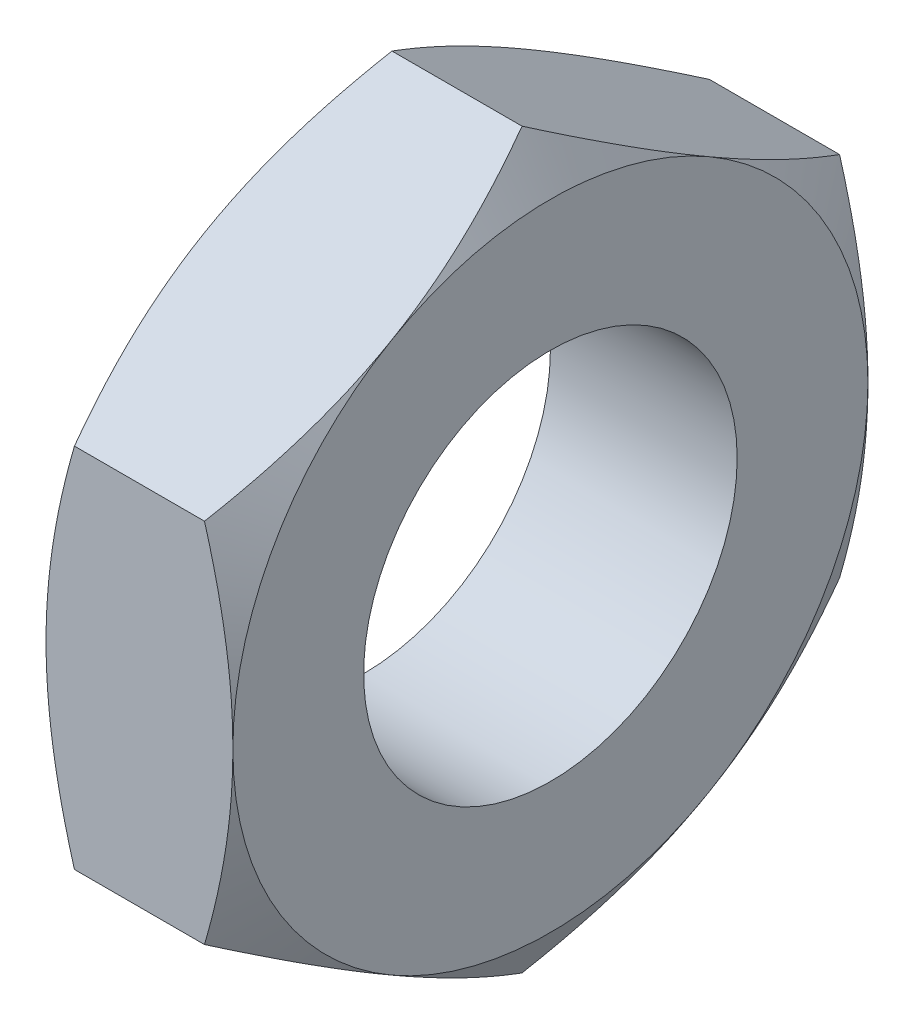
ISO-10303-21;
HEADER;
FILE_DESCRIPTION(('STEP AP214'),'2;1');
FILE_NAME('part.step','',(''),(''),'','','');
FILE_SCHEMA(('AUTOMOTIVE_DESIGN { 1 0 10303 214 1 1 1 1 }'));
ENDSEC;
DATA;
#1=APPLICATION_CONTEXT('core data for automotive mechanical design processes');
#2=APPLICATION_PROTOCOL_DEFINITION('international standard','automotive_design',2000,#1);
#3=PRODUCT_CONTEXT('',#1,'mechanical');
#4=PRODUCT('Part','Part','',(#3));
#5=PRODUCT_RELATED_PRODUCT_CATEGORY('part','',(#4));
#6=PRODUCT_DEFINITION_FORMATION('','',#4);
#7=PRODUCT_DEFINITION_CONTEXT('part definition',#1,'design');
#8=PRODUCT_DEFINITION('design','',#6,#7);
#9=PRODUCT_DEFINITION_SHAPE('','',#8);
#10=(LENGTH_UNIT() NAMED_UNIT(*) SI_UNIT(.MILLI.,.METRE.));
#11=(NAMED_UNIT(*) PLANE_ANGLE_UNIT() SI_UNIT($,.RADIAN.));
#12=(NAMED_UNIT(*) SI_UNIT($,.STERADIAN.) SOLID_ANGLE_UNIT());
#13=UNCERTAINTY_MEASURE_WITH_UNIT(LENGTH_MEASURE(1.E-05),#10,'distance_accuracy_value','');
#14=(GEOMETRIC_REPRESENTATION_CONTEXT(3) GLOBAL_UNCERTAINTY_ASSIGNED_CONTEXT((#13)) GLOBAL_UNIT_ASSIGNED_CONTEXT((#10,
#11,#12)) REPRESENTATION_CONTEXT('',''));
#15=CARTESIAN_POINT('',(0.,0.,0.));
#16=DIRECTION('',(0.,0.,1.));
#17=DIRECTION('',(1.,0.,0.));
#18=AXIS2_PLACEMENT_3D('',#15,#16,#17);
#19=CARTESIAN_POINT('',(0.759189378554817,0.,0.));
#20=DIRECTION('',(1.,0.,0.));
#21=DIRECTION('',(0.,-2.81984927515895E-08,1.));
#22=AXIS2_PLACEMENT_3D('',#19,#20,#21);
#23=CONICAL_SURFACE('',#22,9.81495457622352,1.04719755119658);
#24=CARTESIAN_POINT('',(0.,-7.36121596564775,4.24999994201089));
#25=CARTESIAN_POINT('',(4.54685309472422E-07,-7.33260328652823,4.2995608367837));
#26=CARTESIAN_POINT('',(0.000336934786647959,-7.30399359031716,4.34912332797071));
#27=CARTESIAN_POINT('',(0.00166453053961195,-7.24717704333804,4.44754147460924));
#28=CARTESIAN_POINT('',(0.00264636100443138,-7.21897019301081,4.49639725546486));
#29=CARTESIAN_POINT('',(0.00522743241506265,-7.16299314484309,4.59332236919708));
#30=CARTESIAN_POINT('',(0.00681674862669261,-7.13522303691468,4.64139201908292));
#31=CARTESIAN_POINT('',(0.0105760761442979,-7.08016335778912,4.73666518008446));
#32=CARTESIAN_POINT('',(0.012735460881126,-7.05287386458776,4.78386915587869));
#33=CARTESIAN_POINT('',(0.0176157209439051,-6.99864243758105,4.87765383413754));
#34=CARTESIAN_POINT('',(0.0203291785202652,-6.97170045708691,4.9242348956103));
#35=CARTESIAN_POINT('',(0.0263440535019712,-6.91776517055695,5.01748797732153));
#36=CARTESIAN_POINT('',(0.0296469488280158,-6.89077190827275,5.06415992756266));
#37=CARTESIAN_POINT('',(0.0368484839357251,-6.83670395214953,5.15765837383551));
#38=CARTESIAN_POINT('',(0.040749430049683,-6.80962935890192,5.20448475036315));
#39=CARTESIAN_POINT('',(0.0491543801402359,-6.75538328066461,5.29832873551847));
#40=CARTESIAN_POINT('',(0.0536611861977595,-6.72821195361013,5.34534618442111));
#41=CARTESIAN_POINT('',(0.0632849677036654,-6.67375474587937,5.43960838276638));
#42=CARTESIAN_POINT('',(0.0684052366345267,-6.64646908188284,5.48685292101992));
#43=CARTESIAN_POINT('',(0.0792561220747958,-6.59179997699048,5.58154268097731));
#44=CARTESIAN_POINT('',(0.0849897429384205,-6.5644167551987,5.6289876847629));
#45=CARTESIAN_POINT('',(0.0969962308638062,-6.50987349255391,5.72351845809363));
#46=CARTESIAN_POINT('',(0.103265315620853,-6.48271316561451,5.77060454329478));
#47=CARTESIAN_POINT('',(0.116300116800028,-6.42869122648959,5.86427458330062));
#48=CARTESIAN_POINT('',(0.123060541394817,-6.40182923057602,5.91085905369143));
#49=CARTESIAN_POINT('',(0.137050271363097,-6.34840060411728,6.0035216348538));
#50=CARTESIAN_POINT('',(0.144274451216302,-6.32183361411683,6.04960031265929));
#51=CARTESIAN_POINT('',(0.159163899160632,-6.26899390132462,6.14124416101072));
#52=CARTESIAN_POINT('',(0.16682416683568,-6.24272083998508,6.18680994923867));
#53=CARTESIAN_POINT('',(0.182558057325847,-6.19047038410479,6.27741822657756));
#54=CARTESIAN_POINT('',(0.190626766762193,-6.16449266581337,6.32246138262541));
#55=CARTESIAN_POINT('',(0.207149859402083,-6.11283685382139,6.41201214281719));
#56=CARTESIAN_POINT('',(0.215599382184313,-6.08715844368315,6.45652046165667));
#57=CARTESIAN_POINT('',(0.232856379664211,-6.03610764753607,6.54498694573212));
#58=CARTESIAN_POINT('',(0.241659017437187,-6.01073494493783,6.58894587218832));
#59=CARTESIAN_POINT('',(0.259594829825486,-5.96030505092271,6.6762970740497));
#60=CARTESIAN_POINT('',(0.268723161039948,-5.93524752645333,6.71969015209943));
#61=CARTESIAN_POINT('',(0.287281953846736,-5.88545827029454,6.80589040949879));
#62=CARTESIAN_POINT('',(0.296707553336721,-5.86072619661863,6.84869843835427));
#63=CARTESIAN_POINT('',(0.315836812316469,-5.81160584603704,6.93371309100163));
#64=CARTESIAN_POINT('',(0.325535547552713,-5.78721712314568,6.9759205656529));
#65=CARTESIAN_POINT('',(0.345217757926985,-5.73866745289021,7.05989769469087));
#66=CARTESIAN_POINT('',(0.355198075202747,-5.71450634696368,7.1016679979));
#67=CARTESIAN_POINT('',(0.375466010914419,-5.66633322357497,7.1849239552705));
#68=CARTESIAN_POINT('',(0.385751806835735,-5.64232107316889,7.22640997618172));
#69=CARTESIAN_POINT('',(0.406637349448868,-5.59443168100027,7.30915367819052));
#70=CARTESIAN_POINT('',(0.417235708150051,-5.57055427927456,7.35041161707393));
#71=CARTESIAN_POINT('',(0.438751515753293,-5.52291430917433,7.43275284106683));
#72=CARTESIAN_POINT('',(0.449668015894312,-5.49915160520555,7.47383629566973));
#73=CARTESIAN_POINT('',(0.471825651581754,-5.45171855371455,7.55588111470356));
#74=CARTESIAN_POINT('',(0.483066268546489,-5.42804812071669,7.596842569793));
#75=CARTESIAN_POINT('',(0.505877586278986,-5.38077389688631,7.67869442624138));
#76=CARTESIAN_POINT('',(0.517448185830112,-5.3571700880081,7.7195848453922));
#77=CARTESIAN_POINT('',(0.540924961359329,-5.31000046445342,7.80134424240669));
#78=CARTESIAN_POINT('',(0.55283143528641,-5.28643470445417,7.84221316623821));
#79=CARTESIAN_POINT('',(0.576985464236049,-5.23930957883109,7.92397772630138));
#80=CARTESIAN_POINT('',(0.589233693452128,-5.21575033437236,7.96487323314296));
#81=CARTESIAN_POINT('',(0.614076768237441,-5.16860375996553,8.04673766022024));
#82=CARTESIAN_POINT('',(0.626672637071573,-5.1450166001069,8.08770636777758));
#83=CARTESIAN_POINT('',(0.652216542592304,-5.09777680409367,8.16976241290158));
#84=CARTESIAN_POINT('',(0.665165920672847,-5.07412435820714,8.21084944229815));
#85=CARTESIAN_POINT('',(0.691422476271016,-5.02671391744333,8.29318592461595));
#86=CARTESIAN_POINT('',(0.704731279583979,-5.00295609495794,8.33443495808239));
#87=CARTESIAN_POINT('',(0.731712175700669,-4.9552913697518,8.41713752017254));
#88=CARTESIAN_POINT('',(0.745386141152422,-4.93138456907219,8.4585904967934));
#89=CARTESIAN_POINT('',(0.7591893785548,-4.90747728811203,8.49999999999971));
#90=B_SPLINE_CURVE_WITH_KNOTS('',3,(#24,#25,#26,#27,#28,#29,#30,#31,#32,#33,#34,#35,#36,#37,#38,
#39,#40,#41,#42,#43,#44,#45,#46,#47,#48,#49,#50,#51,#52,#53,#54,#55,#56,#57,#58,#59,#60,#61,#62,
#63,#64,#65,#66,#67,#68,#69,#70,#71,#72,#73,#74,#75,#76,#77,#78,#79,#80,#81,#82,#83,#84,#85,#86,
#87,#88,#89),.UNSPECIFIED.,.F.,.F.,(4,2,2,2,2,2,2,2,2,2,2,2,2,2,2,2,2,2,2,2,2,2,2,2,2,2,2,2,2,2,
2,2,4),(0.,0.171680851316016,0.340944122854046,0.507552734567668,0.671251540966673,
0.832887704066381,0.99493498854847,1.15762368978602,1.32109251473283,1.48548198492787,
1.65071713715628,1.81486885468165,1.97745898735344,2.13848792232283,2.29794321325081,
2.45580006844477,2.61202186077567,2.76656065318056,2.91935773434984,3.07034416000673,
3.21945038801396,3.36727701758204,3.51435128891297,3.66084930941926,3.80694791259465,
3.95282448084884,4.09865677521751,4.2446227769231,4.39090054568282,4.53766809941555,
4.68510331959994,4.83338388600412,4.98268724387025),.UNSPECIFIED.);
#91=CARTESIAN_POINT('',(0.,-7.36121596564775,4.24999994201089));
#92=VERTEX_POINT('',#91);
#93=CARTESIAN_POINT('',(0.759189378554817,-4.90747728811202,8.5));
#94=VERTEX_POINT('',#93);
#95=EDGE_CURVE('E108',#92,#94,#90,.T.);
#96=ORIENTED_EDGE('',*,*,#95,.T.);
#97=CARTESIAN_POINT('',(0.7591893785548,-4.90747728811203,8.49999999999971));
#98=CARTESIAN_POINT('',(0.747538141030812,-4.86711616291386,8.50000000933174));
#99=CARTESIAN_POINT('',(0.73598640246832,-4.82672628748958,8.50000005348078));
#100=CARTESIAN_POINT('',(0.713094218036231,-4.74591491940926,8.50000015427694));
#101=CARTESIAN_POINT('',(0.701753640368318,-4.70549346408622,8.50000021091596));
#102=CARTESIAN_POINT('',(0.679287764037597,-4.62461700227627,8.50000027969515));
#103=CARTESIAN_POINT('',(0.668162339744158,-4.58416203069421,8.50000029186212));
#104=CARTESIAN_POINT('',(0.646130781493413,-4.50321624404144,8.50000026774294));
#105=CARTESIAN_POINT('',(0.635224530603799,-4.46272546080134,8.50000023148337));
#106=CARTESIAN_POINT('',(0.613635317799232,-4.3817053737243,8.50000012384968));
#107=CARTESIAN_POINT('',(0.602952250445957,-4.34117609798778,8.50000005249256));
#108=CARTESIAN_POINT('',(0.581813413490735,-4.26007595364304,8.49999992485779));
#109=CARTESIAN_POINT('',(0.571357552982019,-4.21950510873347,8.49999986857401));
#110=CARTESIAN_POINT('',(0.550677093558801,-4.13831835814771,8.49999973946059));
#111=CARTESIAN_POINT('',(0.54045242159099,-4.09770247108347,8.49999966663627));
#112=CARTESIAN_POINT('',(0.520238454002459,-4.01642171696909,8.49999976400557));
#113=CARTESIAN_POINT('',(0.510249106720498,-3.97575686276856,8.49999993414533));
#114=CARTESIAN_POINT('',(0.490509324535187,-3.89437395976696,8.49999960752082));
#115=CARTESIAN_POINT('',(0.480758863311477,-3.85365591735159,8.49999911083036));
#116=CARTESIAN_POINT('',(0.461503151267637,-3.7721641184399,8.50000074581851));
#117=CARTESIAN_POINT('',(0.451997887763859,-3.73139036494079,8.50000287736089));
#118=CARTESIAN_POINT('',(0.433252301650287,-3.64988297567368,8.49999565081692));
#119=CARTESIAN_POINT('',(0.424011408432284,-3.60914947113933,8.49998631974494));
#120=CARTESIAN_POINT('',(0.405805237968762,-3.52774597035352,8.49996034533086));
#121=CARTESIAN_POINT('',(0.396839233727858,-3.4870761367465,8.49994372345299));
#122=CARTESIAN_POINT('',(0.379181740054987,-3.40576414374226,8.49991045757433));
#123=CARTESIAN_POINT('',(0.37048972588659,-3.36512209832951,8.49989381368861));
#124=CARTESIAN_POINT('',(0.353378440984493,-3.28382991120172,8.49986476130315));
#125=CARTESIAN_POINT('',(0.344958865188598,-3.24317983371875,8.49985234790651));
#126=CARTESIAN_POINT('',(0.328390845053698,-3.16183569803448,8.49983460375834));
#127=CARTESIAN_POINT('',(0.32024232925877,-3.12114165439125,8.49982927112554));
#128=CARTESIAN_POINT('',(0.304214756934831,-3.03967364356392,8.4998266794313));
#129=CARTESIAN_POINT('',(0.296335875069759,-2.99889964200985,8.49982942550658));
#130=CARTESIAN_POINT('',(0.280845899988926,-2.91723570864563,8.49984222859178));
#131=CARTESIAN_POINT('',(0.273235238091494,-2.87634569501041,8.49985229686));
#132=CARTESIAN_POINT('',(0.258280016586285,-2.79441367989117,8.49987717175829));
#133=CARTESIAN_POINT('',(0.250936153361,-2.75337155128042,8.49989198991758));
#134=CARTESIAN_POINT('',(0.236512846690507,-2.67109920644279,8.49992199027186));
#135=CARTESIAN_POINT('',(0.229434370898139,-2.62986882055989,8.4999371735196));
#136=CARTESIAN_POINT('',(0.215540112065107,-2.54718383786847,8.49996161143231));
#137=CARTESIAN_POINT('',(0.208725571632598,-2.50572903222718,8.49997084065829));
#138=CARTESIAN_POINT('',(0.195357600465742,-2.4225590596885,8.49997545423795));
#139=CARTESIAN_POINT('',(0.188805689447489,-2.38084364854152,8.49997076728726));
#140=CARTESIAN_POINT('',(0.175980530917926,-2.29724471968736,8.49993679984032));
#141=CARTESIAN_POINT('',(0.169708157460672,-2.25536106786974,8.49990744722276));
#142=CARTESIAN_POINT('',(0.15750748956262,-2.17176389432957,8.49984005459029));
#143=CARTESIAN_POINT('',(0.151577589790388,-2.13005060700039,8.49980206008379));
#144=CARTESIAN_POINT('',(0.140063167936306,-2.04678755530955,8.49972236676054));
#145=CARTESIAN_POINT('',(0.134477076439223,-2.00523800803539,8.49968068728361));
#146=CARTESIAN_POINT('',(0.123648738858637,-1.92227190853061,8.49959905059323));
#147=CARTESIAN_POINT('',(0.118405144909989,-1.88085553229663,8.49955908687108));
#148=CARTESIAN_POINT('',(0.108260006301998,-1.79812520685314,8.49948444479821));
#149=CARTESIAN_POINT('',(0.103357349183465,-1.75681139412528,8.49944974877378));
#150=CARTESIAN_POINT('',(0.0938922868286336,-1.67425555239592,8.49938783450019));
#151=CARTESIAN_POINT('',(0.0893290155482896,-1.63301362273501,8.49936059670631));
#152=CARTESIAN_POINT('',(0.0805411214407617,-1.55057082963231,8.4993147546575));
#153=CARTESIAN_POINT('',(0.0763158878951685,-1.50937003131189,8.49929613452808));
#154=CARTESIAN_POINT('',(0.0682017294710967,-1.4269798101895,8.49926582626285));
#155=CARTESIAN_POINT('',(0.0643124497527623,-1.38579042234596,8.49925413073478));
#156=CARTESIAN_POINT('',(0.0568792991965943,-1.3034845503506,8.49924025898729));
#157=CARTESIAN_POINT('',(0.0533345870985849,-1.26236814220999,8.49923805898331));
#158=CARTESIAN_POINT('',(0.0465952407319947,-1.18024984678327,8.49924468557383));
#159=CARTESIAN_POINT('',(0.043399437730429,-1.13924805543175,8.49925347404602));
#160=CARTESIAN_POINT('',(0.0373551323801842,-1.05734533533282,8.4992804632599));
#161=CARTESIAN_POINT('',(0.0345055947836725,-1.01644448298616,8.49929863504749));
#162=CARTESIAN_POINT('',(0.0291514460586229,-0.934730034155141,8.499343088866));
#163=CARTESIAN_POINT('',(0.0266459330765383,-0.893916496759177,8.49936934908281));
#164=CARTESIAN_POINT('',(0.021977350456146,-0.812363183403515,8.4994280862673));
#165=CARTESIAN_POINT('',(0.0198135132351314,-0.771623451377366,8.49946054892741));
#166=CARTESIAN_POINT('',(0.0158258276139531,-0.690204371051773,8.49952944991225));
#167=CARTESIAN_POINT('',(0.0140013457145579,-0.64952505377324,8.49956588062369));
#168=CARTESIAN_POINT('',(0.0106899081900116,-0.568213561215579,8.49964006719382));
#169=CARTESIAN_POINT('',(0.00920245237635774,-0.527581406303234,8.49967782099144));
#170=CARTESIAN_POINT('',(0.00656261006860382,-0.446351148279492,8.49975161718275));
#171=CARTESIAN_POINT('',(0.00540985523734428,-0.405753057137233,8.49978766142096));
#172=CARTESIAN_POINT('',(0.0034369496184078,-0.324578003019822,8.49985460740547));
#173=CARTESIAN_POINT('',(0.00261656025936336,-0.284001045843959,8.49988551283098));
#174=CARTESIAN_POINT('',(0.001305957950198,-0.202855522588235,8.4999383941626));
#175=CARTESIAN_POINT('',(0.000815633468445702,-0.162286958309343,8.49996037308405));
#176=CARTESIAN_POINT('',(0.000162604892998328,-0.081145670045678,8.49999114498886));
#177=CARTESIAN_POINT('',(-8.69634958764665E-08,-0.0405729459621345,8.49999993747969));
#178=CARTESIAN_POINT('',(0.,-2.39687188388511E-07,8.5));
#179=B_SPLINE_CURVE_WITH_KNOTS('',3,(#97,#98,#99,#100,#101,#102,#103,#104,#105,#106,#107,#108,
#109,#110,#111,#112,#113,#114,#115,#116,#117,#118,#119,#120,#121,#122,#123,#124,#125,#126,#127,
#128,#129,#130,#131,#132,#133,#134,#135,#136,#137,#138,#139,#140,#141,#142,#143,#144,#145,#146,
#147,#148,#149,#150,#151,#152,#153,#154,#155,#156,#157,#158,#159,#160,#161,#162,#163,#164,#165,
#166,#167,#168,#169,#170,#171,#172,#173,#174,#175,#176,#177,#178),.UNSPECIFIED.,.F.,.F.,(4,2,2,
2,2,2,2,2,2,2,2,2,2,2,2,2,2,2,2,2,2,2,2,2,2,2,2,2,2,2,2,2,2,2,2,2,2,2,2,2,4),(0.,
0.126027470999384,0.251973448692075,0.377843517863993,0.503644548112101,0.629384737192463,
0.755073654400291,0.880722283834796,1.00634306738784,1.1319499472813,1.25755031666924,
1.3828552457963,1.50779372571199,1.63247626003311,1.75701397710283,1.88151859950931,
2.00610240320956,2.13087816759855,2.25595911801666,2.38145886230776,2.50749132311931,
2.63417066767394,2.76122171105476,2.88761858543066,3.01338754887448,3.13862732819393,
3.26343715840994,3.38791671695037,3.51216605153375,3.63628250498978,3.7600878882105,
3.8834649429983,4.0064635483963,4.12913329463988,4.25152341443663,4.37368271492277,
4.49565951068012,4.61750155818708,4.7392559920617,4.86096926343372,4.98268708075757),.UNSPECIFIED.);
#180=CARTESIAN_POINT('',(0.,-2.39687188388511E-07,8.5));
#181=VERTEX_POINT('',#180);
#182=EDGE_CURVE('E124',#94,#181,#179,.T.);
#183=ORIENTED_EDGE('',*,*,#182,.T.);
#184=CARTESIAN_POINT('',(0.,0.,0.));
#185=DIRECTION('',(1.,0.,0.));
#186=DIRECTION('',(0.,-2.81984927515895E-08,1.));
#187=AXIS2_PLACEMENT_3D('',#184,#185,#186);
#188=CIRCLE('',#187,8.5);
#189=EDGE_CURVE('E127',#181,#92,#188,.T.);
#190=ORIENTED_EDGE('',*,*,#189,.T.);
#191=EDGE_LOOP('',(#96,#183,#190));
#192=FACE_BOUND('',#191,.T.);
#193=ADVANCED_FACE('F14',(#192),#23,.T.);
#194=CARTESIAN_POINT('',(0.759189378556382,0.,0.));
#195=DIRECTION('',(1.,0.,0.));
#196=DIRECTION('',(0.,0.866025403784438,0.5));
#197=AXIS2_PLACEMENT_3D('',#194,#195,#196);
#198=CONICAL_SURFACE('',#197,9.81495457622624,1.04719755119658);
#199=CARTESIAN_POINT('',(0.,0.,0.));
#200=DIRECTION('',(1.,0.,0.));
#201=DIRECTION('',(0.,0.866025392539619,0.500000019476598));
#202=AXIS2_PLACEMENT_3D('',#199,#200,#201);
#203=CIRCLE('',#202,8.5);
#204=CARTESIAN_POINT('',(0.,7.36121583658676,4.25000016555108));
#205=VERTEX_POINT('',#204);
#206=EDGE_CURVE('E506',#205,#181,#203,.T.);
#207=ORIENTED_EDGE('',*,*,#206,.T.);
#208=CARTESIAN_POINT('',(0.,-2.39687187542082E-07,8.5));
#209=CARTESIAN_POINT('',(-1.50235037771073E-07,0.0433848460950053,8.49999986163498));
#210=CARTESIAN_POINT('',(0.000190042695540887,0.086769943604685,8.49999700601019));
#211=CARTESIAN_POINT('',(0.000952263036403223,0.173544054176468,8.4999886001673));
#212=CARTESIAN_POINT('',(0.00152435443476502,0.216933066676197,8.49998304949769));
#213=CARTESIAN_POINT('',(0.00305206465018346,0.303735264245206,8.49997199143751));
#214=CARTESIAN_POINT('',(0.00400795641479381,0.347148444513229,8.4999664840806));
#215=CARTESIAN_POINT('',(0.00630473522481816,0.434019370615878,8.49995726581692));
#216=CARTESIAN_POINT('',(0.00764610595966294,0.477477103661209,8.49995355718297));
#217=CARTESIAN_POINT('',(0.0107153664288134,0.564457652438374,8.49994895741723));
#218=CARTESIAN_POINT('',(0.01244395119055,0.607980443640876,8.49994807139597));
#219=CARTESIAN_POINT('',(0.0162891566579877,0.695111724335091,8.49994935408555));
#220=CARTESIAN_POINT('',(0.018406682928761,0.738720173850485,8.49995153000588));
#221=CARTESIAN_POINT('',(0.0230312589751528,0.826043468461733,8.49995832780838));
#222=CARTESIAN_POINT('',(0.0255394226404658,0.869758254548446,8.49996295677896));
#223=CARTESIAN_POINT('',(0.0309468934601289,0.957314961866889,8.49997349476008));
#224=CARTESIAN_POINT('',(0.0338475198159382,1.00115680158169,8.49997940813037));
#225=CARTESIAN_POINT('',(0.0400410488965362,1.08898843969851,8.49998968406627));
#226=CARTESIAN_POINT('',(0.0433354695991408,1.13297813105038,8.49999404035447));
#227=CARTESIAN_POINT('',(0.0503128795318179,1.22104168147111,8.50000085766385));
#228=CARTESIAN_POINT('',(0.0539968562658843,1.26511546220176,8.50000331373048));
#229=CARTESIAN_POINT('',(0.0616822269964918,1.35271900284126,8.49997896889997));
#230=CARTESIAN_POINT('',(0.0656794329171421,1.39624913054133,8.49995250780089));
#231=CARTESIAN_POINT('',(0.0739777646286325,1.48268105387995,8.49989008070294));
#232=CARTESIAN_POINT('',(0.0782739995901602,1.52558331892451,8.49985424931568));
#233=CARTESIAN_POINT('',(0.0871642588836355,1.6108188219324,8.49978413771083));
#234=CARTESIAN_POINT('',(0.0917539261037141,1.65315251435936,8.49974984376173));
#235=CARTESIAN_POINT('',(0.101225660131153,1.73730956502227,8.49969149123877));
#236=CARTESIAN_POINT('',(0.106103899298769,1.7791333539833,8.49966732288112));
#237=CARTESIAN_POINT('',(0.11614718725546,1.86232873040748,8.4996340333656));
#238=CARTESIAN_POINT('',(0.121308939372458,1.90370071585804,8.49962476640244));
#239=CARTESIAN_POINT('',(0.131913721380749,1.98605003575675,8.49962280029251));
#240=CARTESIAN_POINT('',(0.137353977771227,2.02702772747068,8.49962996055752));
#241=CARTESIAN_POINT('',(0.148510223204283,2.10864543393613,8.49965906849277));
#242=CARTESIAN_POINT('',(0.154223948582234,2.14928575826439,8.49968090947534));
#243=CARTESIAN_POINT('',(0.165921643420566,2.23028512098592,8.49973452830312));
#244=CARTESIAN_POINT('',(0.171903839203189,2.27064441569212,8.49976624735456));
#245=CARTESIAN_POINT('',(0.184132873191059,2.35113756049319,8.49983147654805));
#246=CARTESIAN_POINT('',(0.190378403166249,2.39127160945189,8.49986497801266));
#247=CARTESIAN_POINT('',(0.203129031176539,2.47136945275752,8.49992360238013));
#248=CARTESIAN_POINT('',(0.20963325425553,2.51133338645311,8.49994875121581));
#249=CARTESIAN_POINT('',(0.222894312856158,2.59114556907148,8.49997417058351));
#250=CARTESIAN_POINT('',(0.229650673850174,2.63099389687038,8.49997448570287));
#251=CARTESIAN_POINT('',(0.243393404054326,2.71049676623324,8.49994393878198));
#252=CARTESIAN_POINT('',(0.250378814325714,2.75015147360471,8.49991319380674));
#253=CARTESIAN_POINT('',(0.26457049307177,2.82920071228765,8.49983892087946));
#254=CARTESIAN_POINT('',(0.271775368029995,2.86859549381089,8.49979546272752));
#255=CARTESIAN_POINT('',(0.286408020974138,2.94716040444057,8.49970326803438));
#256=CARTESIAN_POINT('',(0.293834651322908,2.98633074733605,8.49965455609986));
#257=CARTESIAN_POINT('',(0.308914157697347,3.06448226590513,8.4995599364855));
#258=CARTESIAN_POINT('',(0.316566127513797,3.10346361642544,8.49951401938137));
#259=CARTESIAN_POINT('',(0.33209930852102,3.18127285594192,8.49943061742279));
#260=CARTESIAN_POINT('',(0.339979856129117,3.22010087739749,8.49939311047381));
#261=CARTESIAN_POINT('',(0.355973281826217,3.2976392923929,8.49933054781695));
#262=CARTESIAN_POINT('',(0.364085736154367,3.33634977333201,8.49930547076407));
#263=CARTESIAN_POINT('',(0.38054604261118,3.41368907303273,8.49926998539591));
#264=CARTESIAN_POINT('',(0.388893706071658,3.45231793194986,8.49925956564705));
#265=CARTESIAN_POINT('',(0.405827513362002,3.52953006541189,8.49925389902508));
#266=CARTESIAN_POINT('',(0.41441369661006,3.56811333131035,8.49925865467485));
#267=CARTESIAN_POINT('',(0.431827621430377,3.6452704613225,8.49928210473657));
#268=CARTESIAN_POINT('',(0.440655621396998,3.68384426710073,8.49930081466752));
#269=CARTESIAN_POINT('',(0.458556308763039,3.76101873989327,8.4993493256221));
#270=CARTESIAN_POINT('',(0.467629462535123,3.79961929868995,8.49937914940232));
#271=CARTESIAN_POINT('',(0.486023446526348,3.87688366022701,8.49944504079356));
#272=CARTESIAN_POINT('',(0.495344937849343,3.91554730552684,8.49948112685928));
#273=CARTESIAN_POINT('',(0.514239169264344,3.99297414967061,8.49955418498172));
#274=CARTESIAN_POINT('',(0.523812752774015,4.03173714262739,8.49959115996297));
#275=CARTESIAN_POINT('',(0.543212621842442,4.10939961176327,8.49965456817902));
#276=CARTESIAN_POINT('',(0.553039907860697,4.14829883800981,8.49968094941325));
#277=CARTESIAN_POINT('',(0.572975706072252,4.22634315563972,8.49972661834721));
#278=CARTESIAN_POINT('',(0.583085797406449,4.26548784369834,8.49974585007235));
#279=CARTESIAN_POINT('',(0.60361613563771,4.34411140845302,8.49978763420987));
#280=CARTESIAN_POINT('',(0.614038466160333,4.38358974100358,8.49981021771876));
#281=CARTESIAN_POINT('',(0.635195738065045,4.46289226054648,8.49985379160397));
#282=CARTESIAN_POINT('',(0.645932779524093,4.50271588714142,8.4998747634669));
#283=CARTESIAN_POINT('',(0.667723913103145,4.5827201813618,8.49991399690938));
#284=CARTESIAN_POINT('',(0.678780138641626,4.62290026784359,8.49993222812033));
#285=CARTESIAN_POINT('',(0.701213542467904,4.70362882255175,8.49996349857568));
#286=CARTESIAN_POINT('',(0.712592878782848,4.74417669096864,8.49997648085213));
#287=CARTESIAN_POINT('',(0.735676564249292,4.82565214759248,8.4999947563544));
#288=CARTESIAN_POINT('',(0.747383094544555,4.86657911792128,8.49999996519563));
#289=CARTESIAN_POINT('',(0.759189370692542,4.90747726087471,8.50000000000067));
#290=B_SPLINE_CURVE_WITH_KNOTS('',3,(#208,#209,#210,#211,#212,#213,#214,#215,#216,#217,#218,
#219,#220,#221,#222,#223,#224,#225,#226,#227,#228,#229,#230,#231,#232,#233,#234,#235,#236,#237,
#238,#239,#240,#241,#242,#243,#244,#245,#246,#247,#248,#249,#250,#251,#252,#253,#254,#255,#256,
#257,#258,#259,#260,#261,#262,#263,#264,#265,#266,#267,#268,#269,#270,#271,#272,#273,#274,#275,
#276,#277,#278,#279,#280,#281,#282,#283,#284,#285,#286,#287,#288,#289),.UNSPECIFIED.,.F.,.F.,(4,
2,2,2,2,2,2,2,2,2,2,2,2,2,2,2,2,2,2,2,2,2,2,2,2,2,2,2,2,2,2,2,2,2,2,2,2,2,2,2,4),(0.,
0.130154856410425,0.260331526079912,0.390600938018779,0.521034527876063,0.651704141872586,
0.782681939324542,0.914040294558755,1.04585169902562,1.17818866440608,1.31086952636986,
1.44200789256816,1.57135699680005,1.6991009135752,1.82542152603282,1.95049844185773,
2.07450891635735,2.19762778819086,2.32002743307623,2.44187774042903,2.56334611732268,
2.68459640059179,2.80539139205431,2.92553523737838,3.04513898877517,3.16431410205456,
3.28317236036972,3.4018257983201,3.52038662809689,3.63896716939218,3.75767978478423,
3.87663682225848,3.99595056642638,4.11573319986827,4.2360968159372,4.35738386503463,
4.47987605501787,4.6036125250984,4.72863244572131,4.85497499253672,4.98267932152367),.UNSPECIFIED.);
#291=CARTESIAN_POINT('',(0.759189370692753,4.90747726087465,8.5));
#292=VERTEX_POINT('',#291);
#293=EDGE_CURVE('E135',#181,#292,#290,.T.);
#294=ORIENTED_EDGE('',*,*,#293,.T.);
#295=CARTESIAN_POINT('',(0.759189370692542,4.90747726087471,8.50000000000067));
#296=CARTESIAN_POINT('',(0.747146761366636,4.92833565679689,8.46387213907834));
#297=CARTESIAN_POINT('',(0.735207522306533,4.94920357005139,8.42771527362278));
#298=CARTESIAN_POINT('',(0.711678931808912,4.99072060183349,8.35576165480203));
#299=CARTESIAN_POINT('',(0.700087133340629,5.01136946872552,8.31996555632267));
#300=CARTESIAN_POINT('',(0.677248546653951,5.05245764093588,8.24872381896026));
#301=CARTESIAN_POINT('',(0.665999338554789,5.07289667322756,8.21327879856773));
#302=CARTESIAN_POINT('',(0.643841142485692,5.11357417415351,8.1427294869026));
#303=CARTESIAN_POINT('',(0.632929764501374,5.13381235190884,8.10762577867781));
#304=CARTESIAN_POINT('',(0.611442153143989,5.1740962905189,8.03774900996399));
#305=CARTESIAN_POINT('',(0.600863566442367,5.19414175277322,8.00297650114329));
#306=CARTESIAN_POINT('',(0.580037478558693,5.23405001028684,7.93375275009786));
#307=CARTESIAN_POINT('',(0.569787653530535,5.25391248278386,7.89930202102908));
#308=CARTESIAN_POINT('',(0.549596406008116,5.29348617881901,7.83065874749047));
#309=CARTESIAN_POINT('',(0.5396530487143,5.31319717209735,7.79646663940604));
#310=CARTESIAN_POINT('',(0.520045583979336,5.35251751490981,7.72824841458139));
#311=CARTESIAN_POINT('',(0.510380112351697,5.37212672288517,7.69422260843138));
#312=CARTESIAN_POINT('',(0.491325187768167,5.41126782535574,7.62631245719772));
#313=CARTESIAN_POINT('',(0.481934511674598,5.43079955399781,7.5924283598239));
#314=CARTESIAN_POINT('',(0.463424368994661,5.46980521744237,7.52477550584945));
#315=CARTESIAN_POINT('',(0.454303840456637,5.48927899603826,7.49100694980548));
#316=CARTESIAN_POINT('',(0.436329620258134,5.52818779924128,7.42355878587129));
#317=CARTESIAN_POINT('',(0.427475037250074,5.54762268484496,7.38987933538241));
#318=CARTESIAN_POINT('',(0.41002820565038,5.58647118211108,7.32258227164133));
#319=CARTESIAN_POINT('',(0.401435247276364,5.60588468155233,7.288964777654));
#320=CARTESIAN_POINT('',(0.384507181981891,5.64470660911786,7.22176392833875));
#321=CARTESIAN_POINT('',(0.376171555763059,5.66411495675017,7.18818065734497));
#322=CARTESIAN_POINT('',(0.35975366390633,5.70294144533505,7.1210199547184));
#323=CARTESIAN_POINT('',(0.351671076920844,5.72235953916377,7.08744257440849));
#324=CARTESIAN_POINT('',(0.335754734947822,5.76121898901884,7.02026473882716));
#325=CARTESIAN_POINT('',(0.327920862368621,5.78066032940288,6.98666430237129));
#326=CARTESIAN_POINT('',(0.312497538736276,5.81957859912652,6.91941095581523));
#327=CARTESIAN_POINT('',(0.304908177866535,5.83905553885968,6.88575803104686));
#328=CARTESIAN_POINT('',(0.289969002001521,5.87805517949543,6.81836937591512));
#329=CARTESIAN_POINT('',(0.28261948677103,5.89757790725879,6.78463359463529));
#330=CARTESIAN_POINT('',(0.268156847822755,5.93668087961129,6.71704966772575));
#331=CARTESIAN_POINT('',(0.261044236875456,5.95626116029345,6.68320143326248));
#332=CARTESIAN_POINT('',(0.247045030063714,5.9954798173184,6.61535451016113));
#333=CARTESIAN_POINT('',(0.240159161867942,6.01511819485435,6.58135567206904));
#334=CARTESIAN_POINT('',(0.226617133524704,6.05447618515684,6.51317985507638));
#335=CARTESIAN_POINT('',(0.219961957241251,6.07419582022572,6.47900269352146));
#336=CARTESIAN_POINT('',(0.206888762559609,6.11374296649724,6.41044552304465));
#337=CARTESIAN_POINT('',(0.200472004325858,6.13357054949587,6.37606531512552));
#338=CARTESIAN_POINT('',(0.187882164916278,6.17335745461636,6.30707511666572));
#339=CARTESIAN_POINT('',(0.181710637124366,6.19331689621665,6.2724649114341));
#340=CARTESIAN_POINT('',(0.169618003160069,6.23339052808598,6.20298642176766));
#341=CARTESIAN_POINT('',(0.16369876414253,6.25350488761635,6.1681179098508));
#342=CARTESIAN_POINT('',(0.152117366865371,6.29390993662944,6.09809286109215));
#343=CARTESIAN_POINT('',(0.146457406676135,6.31420083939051,6.06293608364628));
#344=CARTESIAN_POINT('',(0.135401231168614,6.35497922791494,5.99230293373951));
#345=CARTESIAN_POINT('',(0.130007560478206,6.37546696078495,5.95682630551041));
#346=CARTESIAN_POINT('',(0.119490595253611,6.41665781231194,5.88552018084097));
#347=CARTESIAN_POINT('',(0.114370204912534,6.43736119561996,5.8496904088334));
#348=CARTESIAN_POINT('',(0.104406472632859,6.47900074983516,5.77764302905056));
#349=CARTESIAN_POINT('',(0.0995664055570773,6.49993718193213,5.7414251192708));
#350=CARTESIAN_POINT('',(0.0901697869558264,6.54205837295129,5.66856455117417));
#351=CARTESIAN_POINT('',(0.085616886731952,6.56324335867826,5.63192155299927));
#352=CARTESIAN_POINT('',(0.0768018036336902,6.60587672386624,5.55817265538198));
#353=CARTESIAN_POINT('',(0.0725436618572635,6.62732527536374,5.52106637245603));
#354=CARTESIAN_POINT('',(0.0643272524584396,6.67046964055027,5.44639196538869));
#355=CARTESIAN_POINT('',(0.0603729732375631,6.69216547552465,5.40882341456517));
#356=CARTESIAN_POINT('',(0.0528292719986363,6.73556164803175,5.33366409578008));
#357=CARTESIAN_POINT('',(0.0492397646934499,6.75726198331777,5.29607333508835));
#358=CARTESIAN_POINT('',(0.0424411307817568,6.80060839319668,5.22098090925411));
#359=CARTESIAN_POINT('',(0.0392308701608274,6.82225442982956,5.18347932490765));
#360=CARTESIAN_POINT('',(0.0331900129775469,6.8655030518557,5.10855038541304));
#361=CARTESIAN_POINT('',(0.0303584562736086,6.88710560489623,5.07112308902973));
#362=CARTESIAN_POINT('',(0.025074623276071,6.93027809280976,4.99632768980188));
#363=CARTESIAN_POINT('',(0.0226215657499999,6.95184800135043,4.95895962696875));
#364=CARTESIAN_POINT('',(0.0180942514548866,6.99496537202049,4.88426715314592));
#365=CARTESIAN_POINT('',(0.0160193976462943,7.01651281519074,4.84694276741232));
#366=CARTESIAN_POINT('',(0.012248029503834,7.05959492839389,4.77232170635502));
#367=CARTESIAN_POINT('',(0.0105511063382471,7.08112958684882,4.7350250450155));
#368=CARTESIAN_POINT('',(0.00753513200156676,7.12419524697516,4.66044308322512));
#369=CARTESIAN_POINT('',(0.00621586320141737,7.14572624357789,4.62315778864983));
#370=CARTESIAN_POINT('',(0.00395471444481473,7.18879312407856,4.54858181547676));
#371=CARTESIAN_POINT('',(0.00301280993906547,7.21032900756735,4.51129113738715));
#372=CARTESIAN_POINT('',(0.00150595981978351,7.25341366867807,4.43668730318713));
#373=CARTESIAN_POINT('',(0.000941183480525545,7.27496244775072,4.39937414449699));
#374=CARTESIAN_POINT('',(0.000187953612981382,7.31808016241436,4.32470780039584));
#375=CARTESIAN_POINT('',(-1.37395863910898E-07,7.3396490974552,4.28735461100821));
#376=CARTESIAN_POINT('',(0.,7.36121583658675,4.25000016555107));
#377=B_SPLINE_CURVE_WITH_KNOTS('',3,(#295,#296,#297,#298,#299,#300,#301,#302,#303,#304,#305,
#306,#307,#308,#309,#310,#311,#312,#313,#314,#315,#316,#317,#318,#319,#320,#321,#322,#323,#324,
#325,#326,#327,#328,#329,#330,#331,#332,#333,#334,#335,#336,#337,#338,#339,#340,#341,#342,#343,
#344,#345,#346,#347,#348,#349,#350,#351,#352,#353,#354,#355,#356,#357,#358,#359,#360,#361,#362,
#363,#364,#365,#366,#367,#368,#369,#370,#371,#372,#373,#374,#375,#376),.UNSPECIFIED.,.F.,.F.,(4,
2,2,2,2,2,2,2,2,2,2,2,2,2,2,2,2,2,2,2,2,2,2,2,2,2,2,2,2,2,2,2,2,2,2,2,2,2,2,2,4),(0.,
0.130260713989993,0.259019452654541,0.386321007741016,0.512210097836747,0.636731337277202,
0.759929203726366,0.882028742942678,1.00335940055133,1.12402458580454,1.24412613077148,
1.36376576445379,1.48304506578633,1.60206540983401,1.72092790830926,1.83973334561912,
1.95858211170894,2.07757413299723,2.1968088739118,2.31639492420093,2.43644029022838,
2.557049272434,2.67832890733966,2.80038902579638,2.92334229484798,3.04730424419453,
3.17239327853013,3.29873067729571,3.42644058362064,3.55564998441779,3.68633772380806,
3.81699483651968,3.94725080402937,4.07717000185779,4.20681734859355,4.33625822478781,
4.46555838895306,4.59478389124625,4.72400098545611,4.85327603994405,4.98267544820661),.UNSPECIFIED.);
#378=EDGE_CURVE('E502',#292,#205,#377,.T.);
#379=ORIENTED_EDGE('',*,*,#378,.T.);
#380=EDGE_LOOP('',(#207,#294,#379));
#381=FACE_BOUND('',#380,.T.);
#382=ADVANCED_FACE('F481',(#381),#198,.T.);
#383=CARTESIAN_POINT('',(0.759189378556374,0.,0.));
#384=DIRECTION('',(1.,0.,0.));
#385=DIRECTION('',(0.,0.866025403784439,-0.5));
#386=AXIS2_PLACEMENT_3D('',#383,#384,#385);
#387=CONICAL_SURFACE('',#386,9.81495457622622,1.04719755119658);
#388=CARTESIAN_POINT('',(0.75918937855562,9.81495457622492,1.84755049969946E-12));
#389=CARTESIAN_POINT('',(0.747146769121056,9.79409612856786,-0.0361278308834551));
#390=CARTESIAN_POINT('',(0.735207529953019,9.77321732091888,-0.0722784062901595));
#391=CARTESIAN_POINT('',(0.711678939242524,9.73166217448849,-0.144210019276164));
#392=CARTESIAN_POINT('',(0.700087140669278,9.71098627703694,-0.179990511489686));
#393=CARTESIAN_POINT('',(0.677248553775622,9.66983320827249,-0.25119478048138));
#394=CARTESIAN_POINT('',(0.665999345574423,9.64935643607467,-0.2866180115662));
#395=CARTESIAN_POINT('',(0.643841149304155,9.60859768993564,-0.357120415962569));
#396=CARTESIAN_POINT('',(0.632929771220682,9.58831607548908,-0.392199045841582));
#397=CARTESIAN_POINT('',(0.611442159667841,9.54794298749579,-0.462024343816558));
#398=CARTESIAN_POINT('',(0.600863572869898,9.52785184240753,-0.496770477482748));
#399=CARTESIAN_POINT('',(0.580037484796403,9.48785644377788,-0.565943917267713));
#400=CARTESIAN_POINT('',(0.569787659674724,9.46795247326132,-0.600370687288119));
#401=CARTESIAN_POINT('',(0.549596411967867,9.42829250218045,-0.668964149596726));
#402=CARTESIAN_POINT('',(0.539653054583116,9.408536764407,-0.703130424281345));
#403=CARTESIAN_POINT('',(0.520045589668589,9.36911821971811,-0.771291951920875));
#404=CARTESIAN_POINT('',(0.51038011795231,9.34945561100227,-0.805286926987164));
#405=CARTESIAN_POINT('',(0.491325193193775,9.31021424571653,-0.873139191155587));
#406=CARTESIAN_POINT('',(0.481934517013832,9.29063562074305,-0.906996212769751));
#407=CARTESIAN_POINT('',(0.463424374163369,9.25154936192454,-0.974602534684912));
#408=CARTESIAN_POINT('',(0.454303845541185,9.23204182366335,-1.00835159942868));
#409=CARTESIAN_POINT('',(0.436329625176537,9.19308440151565,-1.07577169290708));
#410=CARTESIAN_POINT('',(0.427475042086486,9.17363458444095,-1.10944252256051));
#411=CARTESIAN_POINT('',(0.410028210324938,9.13477786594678,-1.1767348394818));
#412=CARTESIAN_POINT('',(0.401435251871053,9.1153710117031,-1.21035616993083));
#413=CARTESIAN_POINT('',(0.384507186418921,9.07658433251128,-1.27757736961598));
#414=CARTESIAN_POINT('',(0.376171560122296,9.05720454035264,-1.31117712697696));
#415=CARTESIAN_POINT('',(0.35975366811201,9.01845490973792,-1.3783822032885));
#416=CARTESIAN_POINT('',(0.35167108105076,8.9990850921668,-1.41198745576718));
#417=CARTESIAN_POINT('',(0.33575473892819,8.96033710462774,-1.47922964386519));
#418=CARTESIAN_POINT('',(0.327920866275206,8.94095894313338,-1.5128665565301));
#419=CARTESIAN_POINT('',(0.312497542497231,8.90217497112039,-1.58019743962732));
#420=CARTESIAN_POINT('',(0.304908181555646,8.88276915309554,-1.61389142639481));
#421=CARTESIAN_POINT('',(0.289969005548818,8.84390868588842,-1.68136043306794));
#422=CARTESIAN_POINT('',(0.282619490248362,8.82445400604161,-1.71513550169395));
#423=CARTESIAN_POINT('',(0.268156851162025,8.78547609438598,-1.78279163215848));
#424=CARTESIAN_POINT('',(0.261044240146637,8.76595280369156,-1.81667276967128));
#425=CARTESIAN_POINT('',(0.247045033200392,8.72680497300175,-1.88456058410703));
#426=CARTESIAN_POINT('',(0.240159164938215,8.707180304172,-1.9185673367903));
#427=CARTESIAN_POINT('',(0.226617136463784,8.66781730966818,-1.98674026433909));
#428=CARTESIAN_POINT('',(0.219961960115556,8.64807883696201,-2.02090654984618));
#429=CARTESIAN_POINT('',(0.20688876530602,8.60848015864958,-2.08943396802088));
#430=CARTESIAN_POINT('',(0.200472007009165,8.58861981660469,-2.12379526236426));
#431=CARTESIAN_POINT('',(0.187882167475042,8.54876600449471,-2.19274683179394));
#432=CARTESIAN_POINT('',(0.18171063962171,8.52877240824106,-2.2273373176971));
#433=CARTESIAN_POINT('',(0.169618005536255,8.48863908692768,-2.29678134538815));
#434=CARTESIAN_POINT('',(0.163698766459,8.46849924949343,-2.33163514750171));
#435=CARTESIAN_POINT('',(0.152117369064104,8.42805830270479,-2.40163947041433));
#436=CARTESIAN_POINT('',(0.146457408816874,8.40775709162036,-2.43679029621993));
#437=CARTESIAN_POINT('',(0.135401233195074,8.36697618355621,-2.50742199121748));
#438=CARTESIAN_POINT('',(0.130007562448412,8.3464963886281,-2.5429032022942));
#439=CARTESIAN_POINT('',(0.119490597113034,8.30533889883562,-2.61422858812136));
#440=CARTESIAN_POINT('',(0.114370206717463,8.28466109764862,-2.65007312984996));
#441=CARTESIAN_POINT('',(0.104406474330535,8.24308601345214,-2.72215773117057));
#442=CARTESIAN_POINT('',(0.0995664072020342,8.22218859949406,-2.75839816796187));
#443=CARTESIAN_POINT('',(0.0901697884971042,8.18015009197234,-2.83130647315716));
#444=CARTESIAN_POINT('',(0.0856168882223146,8.15900881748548,-2.86797470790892));
#445=CARTESIAN_POINT('',(0.0768018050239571,8.11645708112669,-2.94177073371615));
#446=CARTESIAN_POINT('',(0.0725436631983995,8.09504637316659,-2.97889886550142));
#447=CARTESIAN_POINT('',(0.0643272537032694,8.05194862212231,-3.05360018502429));
#448=CARTESIAN_POINT('',(0.0603729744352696,8.03026122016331,-3.09117360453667));
#449=CARTESIAN_POINT('',(0.0528292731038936,7.98686942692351,-3.16633545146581));
#450=CARTESIAN_POINT('',(0.0492397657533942,7.96516504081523,-3.20392387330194));
#451=CARTESIAN_POINT('',(0.0424411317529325,7.92180629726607,-3.27900917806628));
#452=CARTESIAN_POINT('',(0.0392308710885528,7.90015199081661,-3.31650598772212));
#453=CARTESIAN_POINT('',(0.0331900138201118,7.85688593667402,-3.39142486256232));
#454=CARTESIAN_POINT('',(0.0303584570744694,7.83527422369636,-3.42884687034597));
#455=CARTESIAN_POINT('',(0.0250746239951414,7.79208575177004,-3.50363304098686));
#456=CARTESIAN_POINT('',(0.0226215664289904,7.7705090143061,-3.54099716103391));
#457=CARTESIAN_POINT('',(0.0180942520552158,7.72738211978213,-3.61568413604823));
#458=CARTESIAN_POINT('',(0.0160193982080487,7.70583197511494,-3.65300696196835));
#459=CARTESIAN_POINT('',(0.0122480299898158,7.66274929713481,-3.72762769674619));
#460=CARTESIAN_POINT('',(0.0105511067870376,7.64121677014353,-3.764925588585));
#461=CARTESIAN_POINT('',(0.00753513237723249,7.5981597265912,-3.83951252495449));
#462=CARTESIAN_POINT('',(0.00621586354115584,7.5766352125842,-3.87680156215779));
#463=CARTESIAN_POINT('',(0.00395471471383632,7.53358396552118,-3.95138656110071));
#464=CARTESIAN_POINT('',(0.00301281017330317,7.51205723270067,-3.98868252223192));
#465=CARTESIAN_POINT('',(0.00150595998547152,7.46899074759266,-4.06329685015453));
#466=CARTESIAN_POINT('',(0.000941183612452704,7.4474509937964,-4.10061521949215));
#467=CARTESIAN_POINT('',(0.000187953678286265,7.40434690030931,-4.17528942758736));
#468=CARTESIAN_POINT('',(-1.37363416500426E-07,7.38278255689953,-4.21264526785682));
#469=CARTESIAN_POINT('',(0.,7.36121602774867,-4.24999983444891));
#470=B_SPLINE_CURVE_WITH_KNOTS('',3,(#388,#389,#390,#391,#392,#393,#394,#395,#396,#397,#398,
#399,#400,#401,#402,#403,#404,#405,#406,#407,#408,#409,#410,#411,#412,#413,#414,#415,#416,#417,
#418,#419,#420,#421,#422,#423,#424,#425,#426,#427,#428,#429,#430,#431,#432,#433,#434,#435,#436,
#437,#438,#439,#440,#441,#442,#443,#444,#445,#446,#447,#448,#449,#450,#451,#452,#453,#454,#455,
#456,#457,#458,#459,#460,#461,#462,#463,#464,#465,#466,#467,#468,#469),.UNSPECIFIED.,.F.,.F.,(4,
2,2,2,2,2,2,2,2,2,2,2,2,2,2,2,2,2,2,2,2,2,2,2,2,2,2,2,2,2,2,2,2,2,2,2,2,2,2,2,4),(0.,
0.130260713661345,0.259019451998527,0.386321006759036,0.512210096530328,0.636731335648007,
0.759929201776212,0.882028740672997,1.00335939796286,1.12402458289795,1.24412612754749,
1.36376576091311,1.48304506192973,1.60206540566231,1.72092790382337,1.83973334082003,
1.95858210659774,2.0775741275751,2.19680886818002,2.31639491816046,2.43644028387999,
2.55704926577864,2.67832890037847,2.80038901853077,2.92334228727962,3.04730423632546,
3.17239327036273,3.29873066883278,3.42644057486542,3.55564997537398,3.68633771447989,
3.816994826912,3.94725079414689,4.07716999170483,4.20681733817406,4.33625821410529,
4.46555837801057,4.59478388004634,4.72400097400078,4.85327602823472,4.98267543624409),.UNSPECIFIED.);
#471=CARTESIAN_POINT('',(0.759189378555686,9.81495457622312,8.27782287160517E-13));
#472=VERTEX_POINT('',#471);
#473=CARTESIAN_POINT('',(0.,7.36121602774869,-4.24999983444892));
#474=VERTEX_POINT('',#473);
#475=EDGE_CURVE('E500',#472,#474,#470,.T.);
#476=ORIENTED_EDGE('',*,*,#475,.T.);
#477=CARTESIAN_POINT('',(0.,0.,0.));
#478=DIRECTION('',(1.,0.,0.));
#479=DIRECTION('',(0.,0.866025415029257,-0.499999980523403));
#480=AXIS2_PLACEMENT_3D('',#477,#478,#479);
#481=CIRCLE('',#480,8.5);
#482=EDGE_CURVE('E493',#474,#205,#481,.T.);
#483=ORIENTED_EDGE('',*,*,#482,.T.);
#484=CARTESIAN_POINT('',(0.,7.36121583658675,4.25000016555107));
#485=CARTESIAN_POINT('',(4.54685401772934E-07,7.38983049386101,4.20044040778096));
#486=CARTESIAN_POINT('',(0.000336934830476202,7.41844802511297,4.15088243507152));
#487=CARTESIAN_POINT('',(0.00166453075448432,7.47527237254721,4.05246878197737));
#488=CARTESIAN_POINT('',(0.00264636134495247,7.50347929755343,4.00361303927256));
#489=CARTESIAN_POINT('',(0.00522743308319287,7.55943038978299,3.90667293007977));
#490=CARTESIAN_POINT('',(0.00681674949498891,7.5871748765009,3.85858848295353));
#491=CARTESIAN_POINT('',(0.0105760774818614,7.64215402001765,3.7632688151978));
#492=CARTESIAN_POINT('',(0.0127354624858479,7.66938911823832,3.7160334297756));
#493=CARTESIAN_POINT('',(0.01761572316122,7.72349332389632,3.62217529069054));
#494=CARTESIAN_POINT('',(0.0203291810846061,7.75036271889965,3.57555231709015));
#495=CARTESIAN_POINT('',(0.0263440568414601,7.8041546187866,3.48221644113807));
#496=CARTESIAN_POINT('',(0.0296469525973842,7.8310770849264,3.43550361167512));
#497=CARTESIAN_POINT('',(0.0368484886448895,7.88501514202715,3.3419301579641));
#498=CARTESIAN_POINT('',(0.0407494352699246,7.91203067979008,3.29506968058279));
#499=CARTESIAN_POINT('',(0.0491543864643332,7.96617892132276,3.2011691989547));
#500=CARTESIAN_POINT('',(0.0536611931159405,7.99331156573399,3.15412941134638));
#501=CARTESIAN_POINT('',(0.0632849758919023,8.04771642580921,3.05983697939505));
#502=CARTESIAN_POINT('',(0.0684052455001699,8.07498856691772,3.01258462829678));
#503=CARTESIAN_POINT('',(0.0792561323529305,8.12965775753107,2.91789490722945));
#504=CARTESIAN_POINT('',(0.0849897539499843,8.15705472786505,2.87045783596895));
#505=CARTESIAN_POINT('',(0.0969962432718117,8.21164915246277,2.77595659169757));
#506=CARTESIAN_POINT('',(0.103265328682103,8.23884673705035,2.72889201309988));
#507=CARTESIAN_POINT('',(0.116300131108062,8.29295640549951,2.63527261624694));
#508=CARTESIAN_POINT('',(0.123060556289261,8.31986874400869,2.58871720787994));
#509=CARTESIAN_POINT('',(0.137050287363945,8.37340258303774,2.49611536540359));
#510=CARTESIAN_POINT('',(0.144274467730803,8.40002439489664,2.4500683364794));
#511=CARTESIAN_POINT('',(0.159163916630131,8.45297044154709,2.35848587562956));
#512=CARTESIAN_POINT('',(0.166824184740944,8.4792950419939,2.31294984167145));
#513=CARTESIAN_POINT('',(0.182558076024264,8.53163888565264,2.22239547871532));
#514=CARTESIAN_POINT('',(0.190626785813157,8.55765854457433,2.17737653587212));
#515=CARTESIAN_POINT('',(0.207149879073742,8.60938387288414,2.08786590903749));
#516=CARTESIAN_POINT('',(0.215599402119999,8.63509000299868,2.04337359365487));
#517=CARTESIAN_POINT('',(0.232856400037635,8.68617882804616,1.95492906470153));
#518=CARTESIAN_POINT('',(0.241659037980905,8.71156202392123,1.910976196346));
#519=CARTESIAN_POINT('',(0.259594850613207,8.76199543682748,1.8236270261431));
#520=CARTESIAN_POINT('',(0.268723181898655,8.78704618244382,1.78023003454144));
#521=CARTESIAN_POINT('',(0.287281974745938,8.83680316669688,1.69401114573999));
#522=CARTESIAN_POINT('',(0.29670757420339,8.86150997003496,1.65118852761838));
#523=CARTESIAN_POINT('',(0.315836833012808,8.91057464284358,1.56614173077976));
#524=CARTESIAN_POINT('',(0.32553556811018,8.93493302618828,1.52391674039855));
#525=CARTESIAN_POINT('',(0.345217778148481,8.98338451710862,1.43988292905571));
#526=CARTESIAN_POINT('',(0.355198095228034,9.00747810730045,1.39807364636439));
#527=CARTESIAN_POINT('',(0.375466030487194,9.05549331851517,1.31472651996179));
#528=CARTESIAN_POINT('',(0.385751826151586,9.07941519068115,1.27318837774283));
#529=CARTESIAN_POINT('',(0.406637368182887,9.12712864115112,1.19034309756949));
#530=CARTESIAN_POINT('',(0.417235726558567,9.15092036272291,1.14903569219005));
#531=CARTESIAN_POINT('',(0.438751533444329,9.19840996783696,1.0666076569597));
#532=CARTESIAN_POINT('',(0.449668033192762,9.22210793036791,1.02548682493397));
#533=CARTESIAN_POINT('',(0.47182566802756,9.26944430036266,0.943386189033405));
#534=CARTESIAN_POINT('',(0.483066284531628,9.29308274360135,0.902406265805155));
#535=CARTESIAN_POINT('',(0.505877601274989,9.34033141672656,0.820539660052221));
#536=CARTESIAN_POINT('',(0.517448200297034,9.36394165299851,0.779652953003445));
#537=CARTESIAN_POINT('',(0.540924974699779,9.41116255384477,0.697923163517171));
#538=CARTESIAN_POINT('',(0.552831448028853,9.43477319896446,0.657080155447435));
#539=CARTESIAN_POINT('',(0.576985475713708,9.48202081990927,0.575386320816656));
#540=CARTESIAN_POINT('',(0.589233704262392,9.50565774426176,0.534535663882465));
#541=CARTESIAN_POINT('',(0.614076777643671,9.55298112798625,0.452773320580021));
#542=CARTESIAN_POINT('',(0.626672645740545,9.57666748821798,0.411861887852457));
#543=CARTESIAN_POINT('',(0.65221654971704,9.62411020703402,0.329923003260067));
#544=CARTESIAN_POINT('',(0.665165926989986,9.647866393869,0.288895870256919));
#545=CARTESIAN_POINT('',(0.691422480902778,9.69546665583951,0.206668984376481));
#546=CARTESIAN_POINT('',(0.704731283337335,9.71931045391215,0.165469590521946));
#547=CARTESIAN_POINT('',(0.731712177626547,9.76710060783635,0.0828394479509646));
#548=CARTESIAN_POINT('',(0.745386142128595,9.79104653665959,0.041409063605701));
#549=CARTESIAN_POINT('',(0.75918937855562,9.81495457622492,1.84755049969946E-12));
#550=B_SPLINE_CURVE_WITH_KNOTS('',3,(#484,#485,#486,#487,#488,#489,#490,#491,#492,#493,#494,
#495,#496,#497,#498,#499,#500,#501,#502,#503,#504,#505,#506,#507,#508,#509,#510,#511,#512,#513,
#514,#515,#516,#517,#518,#519,#520,#521,#522,#523,#524,#525,#526,#527,#528,#529,#530,#531,#532,
#533,#534,#535,#536,#537,#538,#539,#540,#541,#542,#543,#544,#545,#546,#547,#548,#549),
.UNSPECIFIED.,.F.,.F.,(4,2,2,2,2,2,2,2,2,2,2,2,2,2,2,2,2,2,2,2,2,2,2,2,2,2,2,2,2,2,2,2,4),(0.,
0.171680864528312,0.340944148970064,0.507552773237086,0.671251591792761,0.832887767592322,
0.994935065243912,1.15762377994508,1.32109261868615,1.48548210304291,1.65071726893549,
1.81486899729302,1.9774591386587,2.13848808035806,2.29794337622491,2.45580023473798,
2.61202202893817,2.76656082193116,2.91935790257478,3.07034432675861,3.21945055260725,
3.36727718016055,3.51435144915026,3.66084946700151,3.80694806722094,3.95282463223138,
4.09865692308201,4.24462292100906,4.39090068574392,4.53766823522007,4.68510345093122,
4.83338401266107,4.98268736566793),.UNSPECIFIED.);
#551=EDGE_CURVE('E466',#205,#472,#550,.T.);
#552=ORIENTED_EDGE('',*,*,#551,.T.);
#553=EDGE_LOOP('',(#476,#483,#552));
#554=FACE_BOUND('',#553,.T.);
#555=ADVANCED_FACE('F472',(#554),#387,.T.);
#556=CARTESIAN_POINT('',(0.7591893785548,0.,0.));
#557=DIRECTION('',(1.,0.,0.));
#558=DIRECTION('',(0.,2.8198492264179E-08,-1.));
#559=AXIS2_PLACEMENT_3D('',#556,#557,#558);
#560=CONICAL_SURFACE('',#559,9.8149545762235,1.04719755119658);
#561=CARTESIAN_POINT('',(0.,0.,0.));
#562=DIRECTION('',(1.,0.,0.));
#563=DIRECTION('',(0.,2.8198492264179E-08,-1.));
#564=AXIS2_PLACEMENT_3D('',#561,#562,#563);
#565=CIRCLE('',#564,8.5);
#566=CARTESIAN_POINT('',(0.,2.39687184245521E-07,-8.5));
#567=VERTEX_POINT('',#566);
#568=EDGE_CURVE('E439',#567,#474,#565,.T.);
#569=ORIENTED_EDGE('',*,*,#568,.T.);
#570=CARTESIAN_POINT('',(0.,7.36121602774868,-4.24999983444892));
#571=CARTESIAN_POINT('',(4.54685269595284E-07,7.33260334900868,-4.29956073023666));
#572=CARTESIAN_POINT('',(0.000336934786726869,7.30399365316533,-4.34912322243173));
#573=CARTESIAN_POINT('',(0.00166453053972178,7.24717710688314,-4.44754137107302));
#574=CARTESIAN_POINT('',(0.00264636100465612,7.21897025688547,-4.49639715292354));
#575=CARTESIAN_POINT('',(0.00522743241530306,7.16299320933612,-4.59332226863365));
#576=CARTESIAN_POINT('',(0.00681674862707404,7.13522310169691,-4.64139191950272));
#577=CARTESIAN_POINT('',(0.0105760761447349,7.08016342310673,-4.73666508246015));
#578=CARTESIAN_POINT('',(0.0127354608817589,7.052873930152,-4.78386905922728));
#579=CARTESIAN_POINT('',(0.0176157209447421,6.9986425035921,-4.87765373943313));
#580=CARTESIAN_POINT('',(0.0203291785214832,6.97170052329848,-4.92423480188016));
#581=CARTESIAN_POINT('',(0.0263440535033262,6.91776523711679,-5.01748788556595));
#582=CARTESIAN_POINT('',(0.0296469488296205,6.89077197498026,-5.06415983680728));
#583=CARTESIAN_POINT('',(0.0368484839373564,6.83670401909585,-5.15765828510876));
#584=CARTESIAN_POINT('',(0.0407494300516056,6.80962942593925,-5.20448466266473));
#585=CARTESIAN_POINT('',(0.0491543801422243,6.75538334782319,-5.29832864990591));
#586=CARTESIAN_POINT('',(0.0536611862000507,6.72821202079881,-5.34534609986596));
#587=CARTESIAN_POINT('',(0.063284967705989,6.67375481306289,-5.43960830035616));
#588=CARTESIAN_POINT('',(0.0684052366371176,6.64646914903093,-5.48685283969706));
#589=CARTESIAN_POINT('',(0.0792561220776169,6.59180004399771,-5.58154260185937));
#590=CARTESIAN_POINT('',(0.084989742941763,6.56441682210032,-5.62898760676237));
#591=CARTESIAN_POINT('',(0.0969962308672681,6.50987355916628,-5.72351838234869));
#592=CARTESIAN_POINT('',(0.103265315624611,6.4827132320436,-5.77060446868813));
#593=CARTESIAN_POINT('',(0.116300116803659,6.428691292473,-5.86427451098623));
#594=CARTESIAN_POINT('',(0.123060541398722,6.40182929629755,-5.9108589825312));
#595=CARTESIAN_POINT('',(0.137050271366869,6.34840066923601,-6.00352156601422));
#596=CARTESIAN_POINT('',(0.144274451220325,6.32183367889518,-6.0496002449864));
#597=CARTESIAN_POINT('',(0.159163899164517,6.26899396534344,-6.14124409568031));
#598=CARTESIAN_POINT('',(0.166824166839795,6.24272090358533,-6.18680988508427));
#599=CARTESIAN_POINT('',(0.182558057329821,6.19047044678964,-6.27741816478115));
#600=CARTESIAN_POINT('',(0.190626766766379,6.164492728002,-6.32246132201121));
#601=CARTESIAN_POINT('',(0.207149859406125,6.11283691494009,-6.41201208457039));
#602=CARTESIAN_POINT('',(0.215599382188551,6.08715850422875,-6.45652040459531));
#603=CARTESIAN_POINT('',(0.232856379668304,6.03610770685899,-6.54498689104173));
#604=CARTESIAN_POINT('',(0.24165901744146,6.01073500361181,-6.58894581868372));
#605=CARTESIAN_POINT('',(0.259594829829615,5.96030510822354,-6.67629702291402));
#606=CARTESIAN_POINT('',(0.268723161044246,5.93524758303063,-6.71969010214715));
#607=CARTESIAN_POINT('',(0.287281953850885,5.88545832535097,-6.80589036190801));
#608=CARTESIAN_POINT('',(0.296707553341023,5.86072625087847,-6.84869839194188));
#609=CARTESIAN_POINT('',(0.315836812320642,5.81160589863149,-6.93371304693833));
#610=CARTESIAN_POINT('',(0.325535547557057,5.78721717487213,-6.97592052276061));
#611=CARTESIAN_POINT('',(0.345217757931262,5.73866750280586,-7.05989765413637));
#612=CARTESIAN_POINT('',(0.35519807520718,5.71450639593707,-7.1016679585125));
#613=CARTESIAN_POINT('',(0.375466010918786,5.66633327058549,-7.18492391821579));
#614=CARTESIAN_POINT('',(0.385751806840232,5.64232111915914,-7.22640994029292));
#615=CARTESIAN_POINT('',(0.406637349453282,5.59443172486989,-7.30915364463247));
#616=CARTESIAN_POINT('',(0.417235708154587,5.5705543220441,-7.35041158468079));
#617=CARTESIAN_POINT('',(0.438751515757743,5.52291434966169,-7.43275281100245));
#618=CARTESIAN_POINT('',(0.44966801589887,5.49915164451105,-7.47383626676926));
#619=CARTESIAN_POINT('',(0.471825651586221,5.4517185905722,-7.55588108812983));
#620=CARTESIAN_POINT('',(0.483066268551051,5.42804815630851,-7.59684254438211));
#621=CARTESIAN_POINT('',(0.505877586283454,5.38077392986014,-7.67869440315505));
#622=CARTESIAN_POINT('',(0.51744818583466,5.35717011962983,-7.71958482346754));
#623=CARTESIAN_POINT('',(0.540924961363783,5.31000049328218,-7.80134422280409));
#624=CARTESIAN_POINT('',(0.552831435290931,5.28643473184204,-7.8422131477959));
#625=CARTESIAN_POINT('',(0.576985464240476,5.23930960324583,-7.92397771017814));
#626=CARTESIAN_POINT('',(0.589233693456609,5.21575035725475,-7.96487321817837));
#627=CARTESIAN_POINT('',(0.614076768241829,5.16860377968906,-8.04673764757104));
#628=CARTESIAN_POINT('',(0.626672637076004,5.14501661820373,-8.08770635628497));
#629=CARTESIAN_POINT('',(0.652216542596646,5.09777681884,-8.16976240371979));
#630=CARTESIAN_POINT('',(0.665165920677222,5.07412437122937,-8.21084943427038));
#631=CARTESIAN_POINT('',(0.691422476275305,5.02671392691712,-8.29318591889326));
#632=CARTESIAN_POINT('',(0.704731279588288,5.00295610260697,-8.3344349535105));
#633=CARTESIAN_POINT('',(0.731712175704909,4.95529137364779,-8.41713751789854));
#634=CARTESIAN_POINT('',(0.745386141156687,4.93138457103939,-8.45859049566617));
#635=CARTESIAN_POINT('',(0.7591893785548,4.90747728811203,-8.49999999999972));
#636=B_SPLINE_CURVE_WITH_KNOTS('',3,(#570,#571,#572,#573,#574,#575,#576,#577,#578,#579,#580,
#581,#582,#583,#584,#585,#586,#587,#588,#589,#590,#591,#592,#593,#594,#595,#596,#597,#598,#599,
#600,#601,#602,#603,#604,#605,#606,#607,#608,#609,#610,#611,#612,#613,#614,#615,#616,#617,#618,
#619,#620,#621,#622,#623,#624,#625,#626,#627,#628,#629,#630,#631,#632,#633,#634,#635),
.UNSPECIFIED.,.F.,.F.,(4,2,2,2,2,2,2,2,2,2,2,2,2,2,2,2,2,2,2,2,2,2,2,2,2,2,2,2,2,2,2,2,4),(0.,
0.171680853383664,0.340944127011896,0.507552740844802,0.671251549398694,0.83288771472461,
0.994935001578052,1.15762370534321,1.32109253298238,1.48548200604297,1.65071716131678,
1.81486888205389,1.97745901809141,2.13848795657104,2.29794325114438,2.45580011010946,
2.61202190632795,2.7665607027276,2.91935778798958,3.07034421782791,3.21945045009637,
3.36727708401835,3.51435135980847,3.66084938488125,3.80694799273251,3.95282456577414,
4.09865686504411,4.24462287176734,4.39090064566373,4.53766820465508,4.68510343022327,
4.83338400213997,4.98268736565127),.UNSPECIFIED.);
#637=CARTESIAN_POINT('',(0.759189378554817,4.90747728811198,-8.49999999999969));
#638=VERTEX_POINT('',#637);
#639=EDGE_CURVE('E441',#474,#638,#636,.T.);
#640=ORIENTED_EDGE('',*,*,#639,.T.);
#641=CARTESIAN_POINT('',(0.7591893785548,4.90747728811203,-8.49999999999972));
#642=CARTESIAN_POINT('',(0.747538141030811,4.86711616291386,-8.50000000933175));
#643=CARTESIAN_POINT('',(0.735986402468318,4.82672628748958,-8.50000005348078));
#644=CARTESIAN_POINT('',(0.713094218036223,4.74591491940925,-8.50000015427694));
#645=CARTESIAN_POINT('',(0.701753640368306,4.70549346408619,-8.50000021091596));
#646=CARTESIAN_POINT('',(0.679287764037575,4.62461700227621,-8.50000027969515));
#647=CARTESIAN_POINT('',(0.668162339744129,4.58416203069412,-8.50000029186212));
#648=CARTESIAN_POINT('',(0.64613078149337,4.5032162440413,-8.50000026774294));
#649=CARTESIAN_POINT('',(0.635224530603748,4.46272546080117,-8.50000023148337));
#650=CARTESIAN_POINT('',(0.613635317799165,4.38170537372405,-8.50000012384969));
#651=CARTESIAN_POINT('',(0.602952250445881,4.3411760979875,-8.50000005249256));
#652=CARTESIAN_POINT('',(0.581813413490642,4.26007595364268,-8.4999999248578));
#653=CARTESIAN_POINT('',(0.571357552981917,4.21950510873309,-8.49999986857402));
#654=CARTESIAN_POINT('',(0.550677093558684,4.13831835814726,-8.49999973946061));
#655=CARTESIAN_POINT('',(0.540452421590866,4.09770247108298,-8.49999966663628));
#656=CARTESIAN_POINT('',(0.520238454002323,4.01642171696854,-8.49999976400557));
#657=CARTESIAN_POINT('',(0.510249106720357,3.97575686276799,-8.49999993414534));
#658=CARTESIAN_POINT('',(0.490509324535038,3.89437395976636,-8.49999960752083));
#659=CARTESIAN_POINT('',(0.480758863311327,3.85365591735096,-8.49999911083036));
#660=CARTESIAN_POINT('',(0.461503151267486,3.77216411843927,-8.50000074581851));
#661=CARTESIAN_POINT('',(0.45199788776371,3.73139036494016,-8.5000028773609));
#662=CARTESIAN_POINT('',(0.433252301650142,3.64988297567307,-8.49999565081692));
#663=CARTESIAN_POINT('',(0.424011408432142,3.60914947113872,-8.49998631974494));
#664=CARTESIAN_POINT('',(0.405805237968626,3.52774597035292,-8.49996034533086));
#665=CARTESIAN_POINT('',(0.396839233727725,3.4870761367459,-8.499943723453));
#666=CARTESIAN_POINT('',(0.379181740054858,3.40576414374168,-8.49991045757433));
#667=CARTESIAN_POINT('',(0.370489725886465,3.36512209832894,-8.49989381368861));
#668=CARTESIAN_POINT('',(0.353378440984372,3.28382991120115,-8.49986476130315));
#669=CARTESIAN_POINT('',(0.344958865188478,3.24317983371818,-8.49985234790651));
#670=CARTESIAN_POINT('',(0.328390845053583,3.16183569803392,-8.49983460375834));
#671=CARTESIAN_POINT('',(0.320242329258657,3.12114165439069,-8.49982927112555));
#672=CARTESIAN_POINT('',(0.304214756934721,3.03967364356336,-8.49982667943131));
#673=CARTESIAN_POINT('',(0.296335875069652,2.9988996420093,-8.49982942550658));
#674=CARTESIAN_POINT('',(0.280845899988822,2.91723570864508,-8.49984222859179));
#675=CARTESIAN_POINT('',(0.273235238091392,2.87634569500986,-8.49985229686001));
#676=CARTESIAN_POINT('',(0.258280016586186,2.79441367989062,-8.4998771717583));
#677=CARTESIAN_POINT('',(0.250936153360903,2.75337155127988,-8.49989198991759));
#678=CARTESIAN_POINT('',(0.236512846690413,2.67109920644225,-8.49992199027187));
#679=CARTESIAN_POINT('',(0.229434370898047,2.62986882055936,-8.4999371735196));
#680=CARTESIAN_POINT('',(0.215540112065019,2.54718383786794,-8.49996161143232));
#681=CARTESIAN_POINT('',(0.208725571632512,2.50572903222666,-8.4999708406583));
#682=CARTESIAN_POINT('',(0.19535760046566,2.42255905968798,-8.49997545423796));
#683=CARTESIAN_POINT('',(0.188805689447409,2.38084364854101,-8.49997076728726));
#684=CARTESIAN_POINT('',(0.17598053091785,2.29724471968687,-8.49993679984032));
#685=CARTESIAN_POINT('',(0.169708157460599,2.25536106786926,-8.49990744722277));
#686=CARTESIAN_POINT('',(0.157507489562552,2.1717638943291,-8.4998400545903));
#687=CARTESIAN_POINT('',(0.151577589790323,2.13005060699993,-8.4998020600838));
#688=CARTESIAN_POINT('',(0.140063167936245,2.04678755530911,-8.49972236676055));
#689=CARTESIAN_POINT('',(0.134477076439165,2.00523800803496,-8.49968068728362));
#690=CARTESIAN_POINT('',(0.123648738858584,1.9222719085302,-8.49959905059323));
#691=CARTESIAN_POINT('',(0.118405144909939,1.88085553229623,-8.49955908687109));
#692=CARTESIAN_POINT('',(0.108260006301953,1.79812520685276,-8.49948444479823));
#693=CARTESIAN_POINT('',(0.103357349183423,1.75681139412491,-8.49944974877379));
#694=CARTESIAN_POINT('',(0.0938922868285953,1.67425555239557,-8.4993878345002));
#695=CARTESIAN_POINT('',(0.0893290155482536,1.63301362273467,-8.49936059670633));
#696=CARTESIAN_POINT('',(0.0805411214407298,1.55057082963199,-8.49931475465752));
#697=CARTESIAN_POINT('',(0.0763158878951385,1.50937003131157,-8.49929613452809));
#698=CARTESIAN_POINT('',(0.0682017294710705,1.42697981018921,-8.49926582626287));
#699=CARTESIAN_POINT('',(0.064312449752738,1.38579042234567,-8.49925413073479));
#700=CARTESIAN_POINT('',(0.0568792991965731,1.30348455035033,-8.4992402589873));
#701=CARTESIAN_POINT('',(0.053334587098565,1.26236814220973,-8.49923805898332));
#702=CARTESIAN_POINT('',(0.0465952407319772,1.18024984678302,-8.49924468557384));
#703=CARTESIAN_POINT('',(0.0433994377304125,1.13924805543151,-8.49925347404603));
#704=CARTESIAN_POINT('',(0.0373551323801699,1.0573453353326,-8.49928046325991));
#705=CARTESIAN_POINT('',(0.0345055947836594,1.01644448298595,-8.4992986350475));
#706=CARTESIAN_POINT('',(0.0291514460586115,0.934730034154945,-8.49934308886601));
#707=CARTESIAN_POINT('',(0.0266459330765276,0.89391649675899,-8.49936934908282));
#708=CARTESIAN_POINT('',(0.0219773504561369,0.812363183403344,-8.49942808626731));
#709=CARTESIAN_POINT('',(0.0198135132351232,0.771623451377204,-8.49946054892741));
#710=CARTESIAN_POINT('',(0.0158258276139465,0.690204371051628,-8.49952944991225));
#711=CARTESIAN_POINT('',(0.014001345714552,0.649525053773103,-8.49956588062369));
#712=CARTESIAN_POINT('',(0.010689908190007,0.568213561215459,-8.49964006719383));
#713=CARTESIAN_POINT('',(0.00920245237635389,0.527581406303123,-8.49967782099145));
#714=CARTESIAN_POINT('',(0.00656261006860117,0.446351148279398,-8.49975161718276));
#715=CARTESIAN_POINT('',(0.00540985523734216,0.405753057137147,-8.49978766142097));
#716=CARTESIAN_POINT('',(0.00343694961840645,0.324578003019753,-8.49985460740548));
#717=CARTESIAN_POINT('',(0.00261656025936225,0.284001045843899,-8.49988551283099));
#718=CARTESIAN_POINT('',(0.00130595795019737,0.202855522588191,-8.4999383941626));
#719=CARTESIAN_POINT('',(0.000815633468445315,0.162286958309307,-8.49996037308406));
#720=CARTESIAN_POINT('',(0.000162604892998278,0.0811456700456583,-8.49999114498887));
#721=CARTESIAN_POINT('',(-8.69634958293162E-08,0.0405729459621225,-8.4999999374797));
#722=CARTESIAN_POINT('',(0.,2.39687184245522E-07,-8.50000000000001));
#723=B_SPLINE_CURVE_WITH_KNOTS('',3,(#641,#642,#643,#644,#645,#646,#647,#648,#649,#650,#651,
#652,#653,#654,#655,#656,#657,#658,#659,#660,#661,#662,#663,#664,#665,#666,#667,#668,#669,#670,
#671,#672,#673,#674,#675,#676,#677,#678,#679,#680,#681,#682,#683,#684,#685,#686,#687,#688,#689,
#690,#691,#692,#693,#694,#695,#696,#697,#698,#699,#700,#701,#702,#703,#704,#705,#706,#707,#708,
#709,#710,#711,#712,#713,#714,#715,#716,#717,#718,#719,#720,#721,#722),.UNSPECIFIED.,.F.,.F.,(4,
2,2,2,2,2,2,2,2,2,2,2,2,2,2,2,2,2,2,2,2,2,2,2,2,2,2,2,2,2,2,2,2,2,2,2,2,2,2,2,4),(0.,
0.126027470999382,0.251973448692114,0.377843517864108,0.503644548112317,0.629384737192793,
0.75507365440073,0.880722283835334,1.00634306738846,1.13194994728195,1.25755031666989,
1.38285524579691,1.50779372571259,1.6324762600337,1.7570139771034,1.88151859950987,
2.00610240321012,2.1308781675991,2.25595911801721,2.3814588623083,2.50749132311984,
2.63417066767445,2.76122171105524,2.88761858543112,3.0133875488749,3.13862732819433,
3.2634371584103,3.3879167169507,3.51216605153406,3.63628250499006,3.76008788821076,
3.88346494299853,4.00646354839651,4.12913329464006,4.25152341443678,4.3736827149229,
4.49565951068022,4.61750155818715,4.73925599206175,4.86096926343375,4.98268708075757),.UNSPECIFIED.);
#724=EDGE_CURVE('E440',#638,#567,#723,.T.);
#725=ORIENTED_EDGE('',*,*,#724,.T.);
#726=EDGE_LOOP('',(#569,#640,#725));
#727=FACE_BOUND('',#726,.T.);
#728=ADVANCED_FACE('F394',(#727),#560,.T.);
#729=CARTESIAN_POINT('',(0.759189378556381,0.,0.));
#730=DIRECTION('',(1.,0.,0.));
#731=DIRECTION('',(0.,-0.866025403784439,-0.5));
#732=AXIS2_PLACEMENT_3D('',#729,#730,#731);
#733=CONICAL_SURFACE('',#732,9.81495457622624,1.04719755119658);
#734=CARTESIAN_POINT('',(0.,0.,0.));
#735=DIRECTION('',(1.,0.,0.));
#736=DIRECTION('',(0.,-0.86602539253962,-0.500000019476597));
#737=AXIS2_PLACEMENT_3D('',#734,#735,#736);
#738=CIRCLE('',#737,8.5);
#739=CARTESIAN_POINT('',(0.,-7.36121583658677,-4.25000016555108));
#740=VERTEX_POINT('',#739);
#741=EDGE_CURVE('E376',#740,#567,#738,.T.);
#742=ORIENTED_EDGE('',*,*,#741,.T.);
#743=CARTESIAN_POINT('',(0.,2.39687183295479E-07,-8.50000000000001));
#744=CARTESIAN_POINT('',(-1.50235038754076E-07,-0.0433848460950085,-8.49999986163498));
#745=CARTESIAN_POINT('',(0.000190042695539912,-0.0867699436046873,-8.49999700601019));
#746=CARTESIAN_POINT('',(0.000952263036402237,-0.173544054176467,-8.49998860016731));
#747=CARTESIAN_POINT('',(0.00152435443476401,-0.216933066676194,-8.4999830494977));
#748=CARTESIAN_POINT('',(0.0030520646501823,-0.303735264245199,-8.49997199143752));
#749=CARTESIAN_POINT('',(0.00400795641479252,-0.347148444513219,-8.49996648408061));
#750=CARTESIAN_POINT('',(0.00630473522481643,-0.434019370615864,-8.49995726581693));
#751=CARTESIAN_POINT('',(0.00764610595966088,-0.477477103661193,-8.49995355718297));
#752=CARTESIAN_POINT('',(0.0107153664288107,-0.564457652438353,-8.49994895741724));
#753=CARTESIAN_POINT('',(0.012443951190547,-0.607980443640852,-8.49994807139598));
#754=CARTESIAN_POINT('',(0.0162891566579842,-0.695111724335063,-8.49994935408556));
#755=CARTESIAN_POINT('',(0.0184066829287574,-0.738720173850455,-8.49995153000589));
#756=CARTESIAN_POINT('',(0.0230312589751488,-0.826043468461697,-8.49995832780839));
#757=CARTESIAN_POINT('',(0.0255394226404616,-0.869758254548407,-8.49996295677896));
#758=CARTESIAN_POINT('',(0.0309468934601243,-0.957314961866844,-8.49997349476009));
#759=CARTESIAN_POINT('',(0.0338475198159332,-1.00115680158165,-8.49997940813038));
#760=CARTESIAN_POINT('',(0.0400410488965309,-1.08898843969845,-8.49998968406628));
#761=CARTESIAN_POINT('',(0.0433354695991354,-1.13297813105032,-8.49999404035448));
#762=CARTESIAN_POINT('',(0.0503128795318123,-1.22104168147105,-8.50000085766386));
#763=CARTESIAN_POINT('',(0.0539968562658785,-1.26511546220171,-8.50000331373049));
#764=CARTESIAN_POINT('',(0.0616822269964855,-1.3527190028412,-8.49997896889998));
#765=CARTESIAN_POINT('',(0.0656794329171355,-1.39624913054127,-8.49995250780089));
#766=CARTESIAN_POINT('',(0.0739777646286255,-1.48268105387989,-8.49989008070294));
#767=CARTESIAN_POINT('',(0.0782739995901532,-1.52558331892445,-8.49985424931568));
#768=CARTESIAN_POINT('',(0.0871642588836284,-1.61081882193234,-8.49978413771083));
#769=CARTESIAN_POINT('',(0.0917539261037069,-1.6531525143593,-8.49974984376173));
#770=CARTESIAN_POINT('',(0.101225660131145,-1.73730956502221,-8.49969149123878));
#771=CARTESIAN_POINT('',(0.106103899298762,-1.77913335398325,-8.49966732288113));
#772=CARTESIAN_POINT('',(0.116147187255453,-1.86232873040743,-8.4996340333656));
#773=CARTESIAN_POINT('',(0.121308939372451,-1.90370071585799,-8.49962476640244));
#774=CARTESIAN_POINT('',(0.131913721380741,-1.9860500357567,-8.49962280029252));
#775=CARTESIAN_POINT('',(0.137353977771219,-2.02702772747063,-8.49962996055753));
#776=CARTESIAN_POINT('',(0.148510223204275,-2.10864543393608,-8.49965906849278));
#777=CARTESIAN_POINT('',(0.154223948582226,-2.14928575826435,-8.49968090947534));
#778=CARTESIAN_POINT('',(0.165921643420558,-2.23028512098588,-8.49973452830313));
#779=CARTESIAN_POINT('',(0.171903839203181,-2.27064441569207,-8.49976624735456));
#780=CARTESIAN_POINT('',(0.184132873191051,-2.35113756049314,-8.49983147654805));
#781=CARTESIAN_POINT('',(0.190378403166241,-2.39127160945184,-8.49986497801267));
#782=CARTESIAN_POINT('',(0.20312903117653,-2.47136945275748,-8.49992360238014));
#783=CARTESIAN_POINT('',(0.209633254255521,-2.51133338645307,-8.49994875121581));
#784=CARTESIAN_POINT('',(0.222894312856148,-2.59114556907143,-8.49997417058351));
#785=CARTESIAN_POINT('',(0.229650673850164,-2.63099389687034,-8.49997448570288));
#786=CARTESIAN_POINT('',(0.243393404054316,-2.7104967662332,-8.49994393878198));
#787=CARTESIAN_POINT('',(0.250378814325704,-2.75015147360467,-8.49991319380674));
#788=CARTESIAN_POINT('',(0.264570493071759,-2.82920071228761,-8.49983892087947));
#789=CARTESIAN_POINT('',(0.271775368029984,-2.86859549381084,-8.49979546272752));
#790=CARTESIAN_POINT('',(0.286408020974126,-2.94716040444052,-8.49970326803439));
#791=CARTESIAN_POINT('',(0.293834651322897,-2.986330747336,-8.49965455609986));
#792=CARTESIAN_POINT('',(0.308914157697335,-3.06448226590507,-8.4995599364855));
#793=CARTESIAN_POINT('',(0.316566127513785,-3.10346361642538,-8.49951401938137));
#794=CARTESIAN_POINT('',(0.332099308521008,-3.18127285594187,-8.4994306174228));
#795=CARTESIAN_POINT('',(0.339979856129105,-3.22010087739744,-8.49939311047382));
#796=CARTESIAN_POINT('',(0.355973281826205,-3.29763929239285,-8.49933054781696));
#797=CARTESIAN_POINT('',(0.364085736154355,-3.33634977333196,-8.49930547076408));
#798=CARTESIAN_POINT('',(0.380546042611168,-3.41368907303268,-8.49926998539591));
#799=CARTESIAN_POINT('',(0.388893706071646,-3.45231793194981,-8.49925956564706));
#800=CARTESIAN_POINT('',(0.40582751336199,-3.52953006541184,-8.4992538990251));
#801=CARTESIAN_POINT('',(0.414413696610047,-3.56811333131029,-8.49925865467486));
#802=CARTESIAN_POINT('',(0.431827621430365,-3.64527046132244,-8.49928210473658));
#803=CARTESIAN_POINT('',(0.440655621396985,-3.68384426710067,-8.49930081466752));
#804=CARTESIAN_POINT('',(0.458556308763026,-3.76101873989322,-8.49934932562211));
#805=CARTESIAN_POINT('',(0.467629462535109,-3.79961929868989,-8.49937914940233));
#806=CARTESIAN_POINT('',(0.486023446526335,-3.87688366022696,-8.49944504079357));
#807=CARTESIAN_POINT('',(0.495344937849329,-3.91554730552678,-8.49948112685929));
#808=CARTESIAN_POINT('',(0.51423916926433,-3.99297414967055,-8.49955418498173));
#809=CARTESIAN_POINT('',(0.523812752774,-4.03173714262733,-8.49959115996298));
#810=CARTESIAN_POINT('',(0.543212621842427,-4.10939961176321,-8.49965456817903));
#811=CARTESIAN_POINT('',(0.553039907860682,-4.14829883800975,-8.49968094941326));
#812=CARTESIAN_POINT('',(0.572975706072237,-4.22634315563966,-8.49972661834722));
#813=CARTESIAN_POINT('',(0.583085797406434,-4.26548784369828,-8.49974585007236));
#814=CARTESIAN_POINT('',(0.603616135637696,-4.34411140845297,-8.49978763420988));
#815=CARTESIAN_POINT('',(0.61403846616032,-4.38358974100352,-8.49981021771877));
#816=CARTESIAN_POINT('',(0.635195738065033,-4.46289226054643,-8.49985379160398));
#817=CARTESIAN_POINT('',(0.645932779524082,-4.50271588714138,-8.49987476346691));
#818=CARTESIAN_POINT('',(0.667723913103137,-4.58272018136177,-8.49991399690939));
#819=CARTESIAN_POINT('',(0.678780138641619,-4.62290026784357,-8.49993222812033));
#820=CARTESIAN_POINT('',(0.701213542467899,-4.70362882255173,-8.49996349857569));
#821=CARTESIAN_POINT('',(0.712592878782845,-4.74417669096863,-8.49997648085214));
#822=CARTESIAN_POINT('',(0.73567656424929,-4.82565214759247,-8.49999475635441));
#823=CARTESIAN_POINT('',(0.747383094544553,-4.86657911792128,-8.49999996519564));
#824=CARTESIAN_POINT('',(0.75918937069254,-4.90747726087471,-8.50000000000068));
#825=B_SPLINE_CURVE_WITH_KNOTS('',3,(#743,#744,#745,#746,#747,#748,#749,#750,#751,#752,#753,
#754,#755,#756,#757,#758,#759,#760,#761,#762,#763,#764,#765,#766,#767,#768,#769,#770,#771,#772,
#773,#774,#775,#776,#777,#778,#779,#780,#781,#782,#783,#784,#785,#786,#787,#788,#789,#790,#791,
#792,#793,#794,#795,#796,#797,#798,#799,#800,#801,#802,#803,#804,#805,#806,#807,#808,#809,#810,
#811,#812,#813,#814,#815,#816,#817,#818,#819,#820,#821,#822,#823,#824),.UNSPECIFIED.,.F.,.F.,(4,
2,2,2,2,2,2,2,2,2,2,2,2,2,2,2,2,2,2,2,2,2,2,2,2,2,2,2,2,2,2,2,2,2,2,2,2,2,2,2,4),(0.,
0.130154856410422,0.260331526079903,0.390600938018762,0.52103452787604,0.651704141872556,
0.782681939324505,0.914040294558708,1.04585169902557,1.17818866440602,1.31086952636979,
1.44200789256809,1.57135699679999,1.69910091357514,1.82542152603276,1.95049844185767,
2.0745089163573,2.19762778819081,2.32002743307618,2.44187774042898,2.56334611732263,
2.68459640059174,2.80539139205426,2.92553523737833,3.04513898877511,3.1643141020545,
3.28317236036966,3.40182579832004,3.52038662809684,3.63896716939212,3.75767978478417,
3.87663682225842,3.99595056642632,4.1157331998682,4.23609681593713,4.35738386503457,
4.47987605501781,4.60361252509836,4.72863244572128,4.85497499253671,4.98267932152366),.UNSPECIFIED.);
#826=CARTESIAN_POINT('',(0.759189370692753,-4.90747726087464,-8.5));
#827=VERTEX_POINT('',#826);
#828=EDGE_CURVE('E366',#567,#827,#825,.T.);
#829=ORIENTED_EDGE('',*,*,#828,.T.);
#830=CARTESIAN_POINT('',(0.75918937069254,-4.90747726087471,-8.50000000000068));
#831=CARTESIAN_POINT('',(0.747146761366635,-4.92833565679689,-8.46387213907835));
#832=CARTESIAN_POINT('',(0.735207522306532,-4.94920357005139,-8.42771527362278));
#833=CARTESIAN_POINT('',(0.711678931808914,-4.99072060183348,-8.35576165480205));
#834=CARTESIAN_POINT('',(0.700087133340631,-5.01136946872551,-8.31996555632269));
#835=CARTESIAN_POINT('',(0.677248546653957,-5.05245764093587,-8.24872381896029));
#836=CARTESIAN_POINT('',(0.665999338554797,-5.07289667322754,-8.21327879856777));
#837=CARTESIAN_POINT('',(0.643841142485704,-5.1135741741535,-8.14272948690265));
#838=CARTESIAN_POINT('',(0.632929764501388,-5.13381235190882,-8.10762577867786));
#839=CARTESIAN_POINT('',(0.611442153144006,-5.17409629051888,-8.03774900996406));
#840=CARTESIAN_POINT('',(0.600863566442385,-5.19414175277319,-8.00297650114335));
#841=CARTESIAN_POINT('',(0.580037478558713,-5.23405001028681,-7.93375275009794));
#842=CARTESIAN_POINT('',(0.569787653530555,-5.25391248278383,-7.89930202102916));
#843=CARTESIAN_POINT('',(0.549596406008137,-5.29348617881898,-7.83065874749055));
#844=CARTESIAN_POINT('',(0.53965304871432,-5.31319717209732,-7.79646663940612));
#845=CARTESIAN_POINT('',(0.520045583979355,-5.35251751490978,-7.72824841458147));
#846=CARTESIAN_POINT('',(0.510380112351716,-5.37212672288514,-7.69422260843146));
#847=CARTESIAN_POINT('',(0.491325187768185,-5.41126782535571,-7.62631245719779));
#848=CARTESIAN_POINT('',(0.481934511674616,-5.43079955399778,-7.59242835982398));
#849=CARTESIAN_POINT('',(0.463424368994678,-5.46980521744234,-7.52477550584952));
#850=CARTESIAN_POINT('',(0.454303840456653,-5.48927899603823,-7.49100694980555));
#851=CARTESIAN_POINT('',(0.436329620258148,-5.52818779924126,-7.42355878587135));
#852=CARTESIAN_POINT('',(0.427475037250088,-5.54762268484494,-7.38987933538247));
#853=CARTESIAN_POINT('',(0.410028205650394,-5.58647118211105,-7.32258227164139));
#854=CARTESIAN_POINT('',(0.401435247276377,-5.60588468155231,-7.28896477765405));
#855=CARTESIAN_POINT('',(0.384507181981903,-5.64470660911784,-7.2217639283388));
#856=CARTESIAN_POINT('',(0.376171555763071,-5.66411495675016,-7.18818065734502));
#857=CARTESIAN_POINT('',(0.359753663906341,-5.70294144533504,-7.12101995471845));
#858=CARTESIAN_POINT('',(0.351671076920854,-5.72235953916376,-7.08744257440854));
#859=CARTESIAN_POINT('',(0.335754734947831,-5.76121898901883,-7.0202647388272));
#860=CARTESIAN_POINT('',(0.327920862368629,-5.78066032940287,-6.98666430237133));
#861=CARTESIAN_POINT('',(0.312497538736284,-5.81957859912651,-6.91941095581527));
#862=CARTESIAN_POINT('',(0.304908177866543,-5.83905553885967,-6.8857580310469));
#863=CARTESIAN_POINT('',(0.289969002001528,-5.87805517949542,-6.81836937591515));
#864=CARTESIAN_POINT('',(0.282619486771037,-5.89757790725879,-6.78463359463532));
#865=CARTESIAN_POINT('',(0.268156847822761,-5.93668087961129,-6.71704966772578));
#866=CARTESIAN_POINT('',(0.261044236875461,-5.95626116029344,-6.68320143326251));
#867=CARTESIAN_POINT('',(0.247045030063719,-5.9954798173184,-6.61535451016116));
#868=CARTESIAN_POINT('',(0.240159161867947,-6.01511819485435,-6.58135567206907));
#869=CARTESIAN_POINT('',(0.226617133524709,-6.05447618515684,-6.51317985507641));
#870=CARTESIAN_POINT('',(0.219961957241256,-6.07419582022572,-6.47900269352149));
#871=CARTESIAN_POINT('',(0.206888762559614,-6.11374296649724,-6.41044552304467));
#872=CARTESIAN_POINT('',(0.200472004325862,-6.13357054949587,-6.37606531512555));
#873=CARTESIAN_POINT('',(0.187882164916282,-6.17335745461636,-6.30707511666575));
#874=CARTESIAN_POINT('',(0.18171063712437,-6.19331689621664,-6.27246491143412));
#875=CARTESIAN_POINT('',(0.169618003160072,-6.23339052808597,-6.20298642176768));
#876=CARTESIAN_POINT('',(0.163698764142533,-6.25350488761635,-6.16811790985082));
#877=CARTESIAN_POINT('',(0.152117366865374,-6.29390993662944,-6.09809286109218));
#878=CARTESIAN_POINT('',(0.146457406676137,-6.31420083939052,-6.0629360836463));
#879=CARTESIAN_POINT('',(0.135401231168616,-6.35497922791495,-5.99230293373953));
#880=CARTESIAN_POINT('',(0.130007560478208,-6.37546696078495,-5.95682630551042));
#881=CARTESIAN_POINT('',(0.119490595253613,-6.41665781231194,-5.88552018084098));
#882=CARTESIAN_POINT('',(0.114370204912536,-6.43736119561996,-5.84969040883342));
#883=CARTESIAN_POINT('',(0.10440647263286,-6.47900074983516,-5.77764302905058));
#884=CARTESIAN_POINT('',(0.0995664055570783,-6.49993718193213,-5.74142511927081));
#885=CARTESIAN_POINT('',(0.0901697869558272,-6.54205837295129,-5.66856455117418));
#886=CARTESIAN_POINT('',(0.0856168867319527,-6.56324335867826,-5.63192155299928));
#887=CARTESIAN_POINT('',(0.0768018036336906,-6.60587672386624,-5.55817265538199));
#888=CARTESIAN_POINT('',(0.0725436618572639,-6.62732527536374,-5.52106637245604));
#889=CARTESIAN_POINT('',(0.0643272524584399,-6.67046964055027,-5.44639196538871));
#890=CARTESIAN_POINT('',(0.0603729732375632,-6.69216547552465,-5.40882341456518));
#891=CARTESIAN_POINT('',(0.0528292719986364,-6.73556164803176,-5.33366409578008));
#892=CARTESIAN_POINT('',(0.0492397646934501,-6.75726198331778,-5.29607333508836));
#893=CARTESIAN_POINT('',(0.0424411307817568,-6.80060839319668,-5.22098090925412));
#894=CARTESIAN_POINT('',(0.0392308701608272,-6.82225442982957,-5.18347932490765));
#895=CARTESIAN_POINT('',(0.0331900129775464,-6.86550305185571,-5.10855038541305));
#896=CARTESIAN_POINT('',(0.0303584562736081,-6.88710560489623,-5.07112308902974));
#897=CARTESIAN_POINT('',(0.0250746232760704,-6.93027809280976,-4.99632768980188));
#898=CARTESIAN_POINT('',(0.0226215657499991,-6.95184800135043,-4.95895962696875));
#899=CARTESIAN_POINT('',(0.0180942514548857,-6.99496537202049,-4.88426715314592));
#900=CARTESIAN_POINT('',(0.0160193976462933,-7.01651281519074,-4.84694276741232));
#901=CARTESIAN_POINT('',(0.012248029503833,-7.05959492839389,-4.77232170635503));
#902=CARTESIAN_POINT('',(0.0105511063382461,-7.08112958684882,-4.7350250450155));
#903=CARTESIAN_POINT('',(0.00753513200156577,-7.12419524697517,-4.66044308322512));
#904=CARTESIAN_POINT('',(0.00621586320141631,-7.1457262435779,-4.62315778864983));
#905=CARTESIAN_POINT('',(0.00395471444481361,-7.18879312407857,-4.54858181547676));
#906=CARTESIAN_POINT('',(0.00301280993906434,-7.21032900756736,-4.51129113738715));
#907=CARTESIAN_POINT('',(0.00150595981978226,-7.25341366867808,-4.43668730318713));
#908=CARTESIAN_POINT('',(0.000941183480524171,-7.27496244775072,-4.39937414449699));
#909=CARTESIAN_POINT('',(0.000187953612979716,-7.31808016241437,-4.32470780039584));
#910=CARTESIAN_POINT('',(-1.37395865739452E-07,-7.33964909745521,-4.28735461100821));
#911=CARTESIAN_POINT('',(0.,-7.36121583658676,-4.25000016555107));
#912=B_SPLINE_CURVE_WITH_KNOTS('',3,(#830,#831,#832,#833,#834,#835,#836,#837,#838,#839,#840,
#841,#842,#843,#844,#845,#846,#847,#848,#849,#850,#851,#852,#853,#854,#855,#856,#857,#858,#859,
#860,#861,#862,#863,#864,#865,#866,#867,#868,#869,#870,#871,#872,#873,#874,#875,#876,#877,#878,
#879,#880,#881,#882,#883,#884,#885,#886,#887,#888,#889,#890,#891,#892,#893,#894,#895,#896,#897,
#898,#899,#900,#901,#902,#903,#904,#905,#906,#907,#908,#909,#910,#911),.UNSPECIFIED.,.F.,.F.,(4,
2,2,2,2,2,2,2,2,2,2,2,2,2,2,2,2,2,2,2,2,2,2,2,2,2,2,2,2,2,2,2,2,2,2,2,2,2,2,2,4),(0.,
0.130260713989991,0.259019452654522,0.386321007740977,0.512210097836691,0.636731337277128,
0.759929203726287,0.882028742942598,1.00335940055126,1.12402458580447,1.24412613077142,
1.36376576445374,1.48304506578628,1.60206540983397,1.72092790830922,1.83973334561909,
1.95858211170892,2.07757413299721,2.19680887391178,2.31639492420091,2.43644029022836,
2.55704927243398,2.67832890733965,2.80038902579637,2.92334229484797,3.04730424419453,
3.17239327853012,3.2987306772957,3.42644058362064,3.55564998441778,3.68633772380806,
3.81699483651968,3.94725080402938,4.0771700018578,4.20681734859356,4.33625822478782,
4.46555838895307,4.59478389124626,4.72400098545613,4.85327603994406,4.98267544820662),.UNSPECIFIED.);
#913=EDGE_CURVE('E357',#827,#740,#912,.T.);
#914=ORIENTED_EDGE('',*,*,#913,.T.);
#915=EDGE_LOOP('',(#742,#829,#914));
#916=FACE_BOUND('',#915,.T.);
#917=ADVANCED_FACE('F375',(#916),#733,.T.);
#918=CARTESIAN_POINT('',(0.,-8.49999999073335,8.50000002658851));
#919=DIRECTION('',(-1.,0.,0.));
#920=DIRECTION('',(0.,1.,0.));
#921=AXIS2_PLACEMENT_3D('',#918,#919,#920);
#922=PLANE('',#921);
#923=ORIENTED_EDGE('',*,*,#482,.F.);
#924=ORIENTED_EDGE('',*,*,#568,.F.);
#925=ORIENTED_EDGE('',*,*,#741,.F.);
#926=CARTESIAN_POINT('',(0.,0.,0.));
#927=DIRECTION('',(-1.,0.,0.));
#928=DIRECTION('',(0.,-0.86602539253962,-0.500000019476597));
#929=AXIS2_PLACEMENT_3D('',#926,#927,#928);
#930=CIRCLE('',#929,8.5);
#931=EDGE_CURVE('E365',#92,#740,#930,.F.);
#932=ORIENTED_EDGE('',*,*,#931,.F.);
#933=ORIENTED_EDGE('',*,*,#189,.F.);
#934=ORIENTED_EDGE('',*,*,#206,.F.);
#935=EDGE_LOOP('',(#923,#924,#925,#932,#933,#934));
#936=FACE_BOUND('',#935,.T.);
#937=CARTESIAN_POINT('',(0.,0.,0.));
#938=DIRECTION('',(-1.,0.,0.));
#939=DIRECTION('',(0.,0.,1.));
#940=AXIS2_PLACEMENT_3D('',#937,#938,#939);
#941=CIRCLE('',#940,5.);
#942=CARTESIAN_POINT('',(0.,0.,5.));
#943=VERTEX_POINT('',#942);
#944=EDGE_CURVE('E128',#943,#943,#941,.F.);
#945=ORIENTED_EDGE('',*,*,#944,.T.);
#946=EDGE_LOOP('',(#945));
#947=FACE_BOUND('',#946,.T.);
#948=ADVANCED_FACE('F393',(#936,#947),#922,.T.);
#949=CARTESIAN_POINT('',(0.759189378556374,0.,0.));
#950=DIRECTION('',(1.,0.,0.));
#951=DIRECTION('',(0.,-0.866025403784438,0.5));
#952=AXIS2_PLACEMENT_3D('',#949,#950,#951);
#953=CONICAL_SURFACE('',#952,9.81495457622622,1.04719755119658);
#954=ORIENTED_EDGE('',*,*,#931,.T.);
#955=CARTESIAN_POINT('',(0.,-7.36121583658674,-4.25000016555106));
#956=CARTESIAN_POINT('',(4.54685400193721E-07,-7.389830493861,-4.20044040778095));
#957=CARTESIAN_POINT('',(0.000336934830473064,-7.41844802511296,-4.15088243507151));
#958=CARTESIAN_POINT('',(0.00166453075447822,-7.47527237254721,-4.05246878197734));
#959=CARTESIAN_POINT('',(0.00264636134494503,-7.50347929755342,-4.00361303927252));
#960=CARTESIAN_POINT('',(0.00522743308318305,-7.55943038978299,-3.90667293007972));
#961=CARTESIAN_POINT('',(0.0068167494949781,-7.58717487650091,-3.85858848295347));
#962=CARTESIAN_POINT('',(0.0105760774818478,-7.64215402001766,-3.76326881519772));
#963=CARTESIAN_POINT('',(0.0127354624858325,-7.66938911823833,-3.71603342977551));
#964=CARTESIAN_POINT('',(0.0176157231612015,-7.72349332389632,-3.62217529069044));
#965=CARTESIAN_POINT('',(0.0203291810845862,-7.75036271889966,-3.57555231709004));
#966=CARTESIAN_POINT('',(0.0263440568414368,-7.8041546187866,-3.48221644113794));
#967=CARTESIAN_POINT('',(0.0296469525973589,-7.8310770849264,-3.43550361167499));
#968=CARTESIAN_POINT('',(0.0368484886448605,-7.88501514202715,-3.34193015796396));
#969=CARTESIAN_POINT('',(0.0407494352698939,-7.91203067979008,-3.29506968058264));
#970=CARTESIAN_POINT('',(0.0491543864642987,-7.96617892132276,-3.20116919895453));
#971=CARTESIAN_POINT('',(0.0536611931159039,-7.99331156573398,-3.1541294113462));
#972=CARTESIAN_POINT('',(0.0632849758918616,-8.04771642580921,-3.05983697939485));
#973=CARTESIAN_POINT('',(0.0684052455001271,-8.07498856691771,-3.01258462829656));
#974=CARTESIAN_POINT('',(0.0792561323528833,-8.12965775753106,-2.91789490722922));
#975=CARTESIAN_POINT('',(0.0849897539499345,-8.15705472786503,-2.8704578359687));
#976=CARTESIAN_POINT('',(0.0969962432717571,-8.21164915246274,-2.77595659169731));
#977=CARTESIAN_POINT('',(0.103265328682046,-8.23884673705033,-2.72889201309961));
#978=CARTESIAN_POINT('',(0.116300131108,-8.29295640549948,-2.63527261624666));
#979=CARTESIAN_POINT('',(0.123060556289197,-8.31986874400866,-2.58871720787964));
#980=CARTESIAN_POINT('',(0.137050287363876,-8.3734025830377,-2.49611536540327));
#981=CARTESIAN_POINT('',(0.14427446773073,-8.4000243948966,-2.45006833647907));
#982=CARTESIAN_POINT('',(0.159163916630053,-8.45297044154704,-2.35848587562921));
#983=CARTESIAN_POINT('',(0.166824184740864,-8.47929504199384,-2.31294984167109));
#984=CARTESIAN_POINT('',(0.182558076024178,-8.53163888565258,-2.22239547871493));
#985=CARTESIAN_POINT('',(0.190626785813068,-8.55765854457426,-2.17737653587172));
#986=CARTESIAN_POINT('',(0.207149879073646,-8.60938387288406,-2.08786590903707));
#987=CARTESIAN_POINT('',(0.215599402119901,-8.6350900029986,-2.04337359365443));
#988=CARTESIAN_POINT('',(0.232856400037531,-8.68617882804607,-1.95492906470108));
#989=CARTESIAN_POINT('',(0.241659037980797,-8.71156202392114,-1.91097619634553));
#990=CARTESIAN_POINT('',(0.259594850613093,-8.76199543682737,-1.8236270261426));
#991=CARTESIAN_POINT('',(0.268723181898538,-8.7870461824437,-1.78023003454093));
#992=CARTESIAN_POINT('',(0.287281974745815,-8.83680316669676,-1.69401114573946));
#993=CARTESIAN_POINT('',(0.296707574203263,-8.86150997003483,-1.65118852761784));
#994=CARTESIAN_POINT('',(0.315836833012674,-8.91057464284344,-1.56614173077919));
#995=CARTESIAN_POINT('',(0.325535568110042,-8.93493302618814,-1.52391674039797));
#996=CARTESIAN_POINT('',(0.345217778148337,-8.98338451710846,-1.43988292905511));
#997=CARTESIAN_POINT('',(0.355198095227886,-9.00747810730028,-1.39807364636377));
#998=CARTESIAN_POINT('',(0.375466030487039,-9.05549331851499,-1.31472651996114));
#999=CARTESIAN_POINT('',(0.385751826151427,-9.07941519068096,-1.27318837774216));
#1000=CARTESIAN_POINT('',(0.406637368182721,-9.12712864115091,-1.1903430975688));
#1001=CARTESIAN_POINT('',(0.417235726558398,-9.15092036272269,-1.14903569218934));
#1002=CARTESIAN_POINT('',(0.438751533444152,-9.19840996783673,-1.06660765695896));
#1003=CARTESIAN_POINT('',(0.449668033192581,-9.22210793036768,-1.02548682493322));
#1004=CARTESIAN_POINT('',(0.471825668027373,-9.26944430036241,-0.943386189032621));
#1005=CARTESIAN_POINT('',(0.483066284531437,-9.29308274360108,-0.902406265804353));
#1006=CARTESIAN_POINT('',(0.505877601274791,-9.34033141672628,-0.820539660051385));
#1007=CARTESIAN_POINT('',(0.517448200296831,-9.36394165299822,-0.779652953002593));
#1008=CARTESIAN_POINT('',(0.540924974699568,-9.41116255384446,-0.697923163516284));
#1009=CARTESIAN_POINT('',(0.552831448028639,-9.43477319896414,-0.65708015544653));
#1010=CARTESIAN_POINT('',(0.576985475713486,-9.48202081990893,-0.575386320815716));
#1011=CARTESIAN_POINT('',(0.589233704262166,-9.50565774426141,-0.534535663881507));
#1012=CARTESIAN_POINT('',(0.614076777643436,-9.55298112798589,-0.452773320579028));
#1013=CARTESIAN_POINT('',(0.626672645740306,-9.57666748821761,-0.411861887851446));
#1014=CARTESIAN_POINT('',(0.652216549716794,-9.62411020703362,-0.329923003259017));
#1015=CARTESIAN_POINT('',(0.665165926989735,-9.64786639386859,-0.28889587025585));
#1016=CARTESIAN_POINT('',(0.691422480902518,-9.69546665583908,-0.206668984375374));
#1017=CARTESIAN_POINT('',(0.704731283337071,-9.7193104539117,-0.16546959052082));
#1018=CARTESIAN_POINT('',(0.731712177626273,-9.76710060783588,-0.082839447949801));
#1019=CARTESIAN_POINT('',(0.745386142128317,-9.79104653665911,-0.0414090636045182));
#1020=CARTESIAN_POINT('',(0.759189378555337,-9.81495457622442,-6.45634721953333E-13));
#1021=B_SPLINE_CURVE_WITH_KNOTS('',3,(#955,#956,#957,#958,#959,#960,#961,#962,#963,#964,#965,
#966,#967,#968,#969,#970,#971,#972,#973,#974,#975,#976,#977,#978,#979,#980,#981,#982,#983,#984,
#985,#986,#987,#988,#989,#990,#991,#992,#993,#994,#995,#996,#997,#998,#999,#1000,#1001,#1002,
#1003,#1004,#1005,#1006,#1007,#1008,#1009,#1010,#1011,#1012,#1013,#1014,#1015,#1016,#1017,#1018,
#1019,#1020),.UNSPECIFIED.,.F.,.F.,(4,2,2,2,2,2,2,2,2,2,2,2,2,2,2,2,2,2,2,2,2,2,2,2,2,2,2,2,2,2,
2,2,4),(0.,0.17168086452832,0.340944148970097,0.507552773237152,0.671251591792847,
0.832887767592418,0.994935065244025,1.15762377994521,1.32109261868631,1.48548210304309,
1.65071726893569,1.81486899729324,1.97745913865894,2.13848808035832,2.29794337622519,
2.45580023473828,2.6120220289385,2.7665608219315,2.91935790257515,3.070344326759,
3.21945055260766,3.36727718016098,3.51435144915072,3.66084946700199,3.80694806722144,
3.95282463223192,4.09865692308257,4.24462292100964,4.39090068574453,4.53766823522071,
4.68510345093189,4.83338401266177,4.98268736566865),.UNSPECIFIED.);
#1022=CARTESIAN_POINT('',(0.75918937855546,-9.81495457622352,-1.47437617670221E-13));
#1023=VERTEX_POINT('',#1022);
#1024=EDGE_CURVE('E359',#740,#1023,#1021,.T.);
#1025=ORIENTED_EDGE('',*,*,#1024,.T.);
#1026=CARTESIAN_POINT('',(0.759189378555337,-9.81495457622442,-6.45634721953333E-13));
#1027=CARTESIAN_POINT('',(0.747146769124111,-9.79409612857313,0.0361278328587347));
#1028=CARTESIAN_POINT('',(0.73520752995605,-9.77321732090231,0.0722784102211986));
#1029=CARTESIAN_POINT('',(0.711678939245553,-9.73166217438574,0.144210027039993));
#1030=CARTESIAN_POINT('',(0.700087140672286,-9.71098627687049,0.179990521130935));
#1031=CARTESIAN_POINT('',(0.677248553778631,-9.66983320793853,0.251194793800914));
#1032=CARTESIAN_POINT('',(0.665999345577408,-9.64935643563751,0.286618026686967));
#1033=CARTESIAN_POINT('',(0.643841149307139,-9.6085976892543,0.35712043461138));
#1034=CARTESIAN_POINT('',(0.632929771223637,-9.58831607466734,0.392199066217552));
#1035=CARTESIAN_POINT('',(0.611442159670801,-9.54794298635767,0.462024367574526));
#1036=CARTESIAN_POINT('',(0.600863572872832,-9.52785184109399,0.496770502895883));
#1037=CARTESIAN_POINT('',(0.580037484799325,-9.48785644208,0.565943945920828));
#1038=CARTESIAN_POINT('',(0.569787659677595,-9.46795247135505,0.600370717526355));
#1039=CARTESIAN_POINT('',(0.549596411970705,-9.42829249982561,0.668964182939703));
#1040=CARTESIAN_POINT('',(0.539653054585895,-9.40853676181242,0.703130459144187));
#1041=CARTESIAN_POINT('',(0.520045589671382,-9.36911821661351,0.77129198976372));
#1042=CARTESIAN_POINT('',(0.510380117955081,-9.34945560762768,0.805286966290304));
#1043=CARTESIAN_POINT('',(0.491325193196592,-9.31021424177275,0.87313923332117));
#1044=CARTESIAN_POINT('',(0.481934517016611,-9.29063561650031,0.90699625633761));
#1045=CARTESIAN_POINT('',(0.463424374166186,-9.25154935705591,0.974602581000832));
#1046=CARTESIAN_POINT('',(0.45430384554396,-9.23204181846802,1.00835164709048));
#1047=CARTESIAN_POINT('',(0.436329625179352,-9.19308439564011,1.07577174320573));
#1048=CARTESIAN_POINT('',(0.427475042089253,-9.17363457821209,1.10944257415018));
#1049=CARTESIAN_POINT('',(0.410028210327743,-9.13477785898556,1.17673489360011));
#1050=CARTESIAN_POINT('',(0.401435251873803,-9.11537100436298,1.2103562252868));
#1051=CARTESIAN_POINT('',(0.384507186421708,-9.07658432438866,1.27757742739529));
#1052=CARTESIAN_POINT('',(0.376171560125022,-9.05720453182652,1.31117718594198));
#1053=CARTESIAN_POINT('',(0.359753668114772,-9.01845490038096,1.37838226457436));
#1054=CARTESIAN_POINT('',(0.351671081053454,-8.9990850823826,1.41198751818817));
#1055=CARTESIAN_POINT('',(0.335754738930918,-8.96033709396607,1.4792297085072));
#1056=CARTESIAN_POINT('',(0.327920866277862,-8.94095893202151,1.51286662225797));
#1057=CARTESIAN_POINT('',(0.312497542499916,-8.90217495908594,1.58019750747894));
#1058=CARTESIAN_POINT('',(0.304908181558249,-8.88276914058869,1.61389149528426));
#1059=CARTESIAN_POINT('',(0.289969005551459,-8.84390867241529,1.68136050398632));
#1060=CARTESIAN_POINT('',(0.282619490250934,-8.82445399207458,1.71513557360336));
#1061=CARTESIAN_POINT('',(0.268156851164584,-8.78547607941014,1.78279170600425));
#1062=CARTESIAN_POINT('',(0.261044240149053,-8.76595278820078,1.8166728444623));
#1063=CARTESIAN_POINT('',(0.247045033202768,-8.72680495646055,1.88456066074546));
#1064=CARTESIAN_POINT('',(0.240159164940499,-8.70718028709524,1.91856741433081));
#1065=CARTESIAN_POINT('',(0.226617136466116,-8.66781729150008,1.98674034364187));
#1066=CARTESIAN_POINT('',(0.219961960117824,-8.64807881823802,2.02090663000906));
#1067=CARTESIAN_POINT('',(0.206888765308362,-8.608480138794,2.08943404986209));
#1068=CARTESIAN_POINT('',(0.200472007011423,-8.5886197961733,2.12379534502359));
#1069=CARTESIAN_POINT('',(0.187882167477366,-8.54876598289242,2.1927469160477));
#1070=CARTESIAN_POINT('',(0.181710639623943,-8.52877238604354,2.22733740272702));
#1071=CARTESIAN_POINT('',(0.169618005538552,-8.48863906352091,2.29678143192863));
#1072=CARTESIAN_POINT('',(0.163698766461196,-8.46849922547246,2.33163523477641));
#1073=CARTESIAN_POINT('',(0.152117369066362,-8.42805827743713,2.40163955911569));
#1074=CARTESIAN_POINT('',(0.146457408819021,-8.40775706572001,2.43679038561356));
#1075=CARTESIAN_POINT('',(0.135401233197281,-8.36697615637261,2.50742208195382));
#1076=CARTESIAN_POINT('',(0.130007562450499,-8.34649636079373,2.5429032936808));
#1077=CARTESIAN_POINT('',(0.119490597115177,-8.30533886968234,2.61422868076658));
#1078=CARTESIAN_POINT('',(0.114370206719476,-8.28466106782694,2.65007322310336));
#1079=CARTESIAN_POINT('',(0.104406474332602,-8.24308598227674,2.72215782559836));
#1080=CARTESIAN_POINT('',(0.0995664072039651,-8.22218856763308,2.75839826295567));
#1081=CARTESIAN_POINT('',(0.090169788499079,-8.18015005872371,2.83130656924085));
#1082=CARTESIAN_POINT('',(0.0856168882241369,-8.15900878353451,2.86797480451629));
#1083=CARTESIAN_POINT('',(0.0768018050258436,-8.11645704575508,2.94177083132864));
#1084=CARTESIAN_POINT('',(0.0725436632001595,-8.0950463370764,2.97889896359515));
#1085=CARTESIAN_POINT('',(0.0643272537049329,-8.05194858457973,3.05360028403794));
#1086=CARTESIAN_POINT('',(0.0603729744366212,-8.03026118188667,3.09117370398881));
#1087=CARTESIAN_POINT('',(0.0528292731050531,-7.98686938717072,3.16633555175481));
#1088=CARTESIAN_POINT('',(0.0492397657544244,-7.96516500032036,3.2039239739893));
#1089=CARTESIAN_POINT('',(0.0424411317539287,-7.92180625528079,3.2790092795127));
#1090=CARTESIAN_POINT('',(0.0392308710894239,-7.90015194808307,3.31650608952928));
#1091=CARTESIAN_POINT('',(0.0331900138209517,-7.85688589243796,3.39142496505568));
#1092=CARTESIAN_POINT('',(0.0303584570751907,-7.83527417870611,3.42884697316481));
#1093=CARTESIAN_POINT('',(0.0250746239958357,-7.79208570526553,3.50363314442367));
#1094=CARTESIAN_POINT('',(0.022621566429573,-7.77050896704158,3.54099726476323));
#1095=CARTESIAN_POINT('',(0.018094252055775,-7.72738207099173,3.61568424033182));
#1096=CARTESIAN_POINT('',(0.0160193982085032,-7.70583192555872,3.65300706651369));
#1097=CARTESIAN_POINT('',(0.0122480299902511,-7.66274924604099,3.72762780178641));
#1098=CARTESIAN_POINT('',(0.0105511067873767,-7.64121671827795,3.76492569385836));
#1099=CARTESIAN_POINT('',(0.00753513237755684,-7.59815967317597,3.83951263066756));
#1100=CARTESIAN_POINT('',(0.00621586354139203,-7.57663515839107,3.87680166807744));
#1101=CARTESIAN_POINT('',(0.00395471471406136,-7.53358390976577,3.95138666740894));
#1102=CARTESIAN_POINT('',(0.00301281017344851,-7.51205717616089,3.98868262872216));
#1103=CARTESIAN_POINT('',(0.00150595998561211,-7.46899068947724,4.06329695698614));
#1104=CARTESIAN_POINT('',(0.000941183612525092,-7.4474509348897,4.10061532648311));
#1105=CARTESIAN_POINT('',(0.000187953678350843,-7.40434683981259,4.17528953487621));
#1106=CARTESIAN_POINT('',(-1.37363420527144E-07,-7.38278249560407,4.21264537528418));
#1107=CARTESIAN_POINT('',(0.,-7.36121596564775,4.24999994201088));
#1108=B_SPLINE_CURVE_WITH_KNOTS('',3,(#1026,#1027,#1028,#1029,#1030,#1031,#1032,#1033,#1034,
#1035,#1036,#1037,#1038,#1039,#1040,#1041,#1042,#1043,#1044,#1045,#1046,#1047,#1048,#1049,#1050,
#1051,#1052,#1053,#1054,#1055,#1056,#1057,#1058,#1059,#1060,#1061,#1062,#1063,#1064,#1065,#1066,
#1067,#1068,#1069,#1070,#1071,#1072,#1073,#1074,#1075,#1076,#1077,#1078,#1079,#1080,#1081,#1082,
#1083,#1084,#1085,#1086,#1087,#1088,#1089,#1090,#1091,#1092,#1093,#1094,#1095,#1096,#1097,#1098,
#1099,#1100,#1101,#1102,#1103,#1104,#1105,#1106,#1107),.UNSPECIFIED.,.F.,.F.,(4,2,2,2,2,2,2,2,2,
2,2,2,2,2,2,2,2,2,2,2,2,2,2,2,2,2,2,2,2,2,2,2,2,2,2,2,2,2,2,2,4),(0.,0.130260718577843,
0.259019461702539,0.386321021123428,0.512210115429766,0.636731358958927,0.759929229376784,
0.882028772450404,1.00335943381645,1.12402462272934,1.24412617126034,1.36376580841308,
1.48304511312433,1.60206546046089,1.72092796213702,1.83973340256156,1.95858217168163,
2.07757419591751,2.19680893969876,2.31639499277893,2.4364403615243,2.55704934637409,
2.67832898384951,2.80038910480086,2.9233423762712,3.04730432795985,3.17239336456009,
3.29873076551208,3.42644067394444,3.55565007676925,3.68633781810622,3.81699493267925,
3.94725090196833,4.0771701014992,4.20681744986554,4.33625832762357,4.46555849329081,
4.59478399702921,4.7240010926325,4.85327614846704,4.98267555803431),.UNSPECIFIED.);
#1109=EDGE_CURVE('E118',#1023,#92,#1108,.T.);
#1110=ORIENTED_EDGE('',*,*,#1109,.T.);
#1111=EDGE_LOOP('',(#954,#1025,#1110));
#1112=FACE_BOUND('',#1111,.T.);
#1113=ADVANCED_FACE('F157',(#1112),#953,.T.);
#1114=CARTESIAN_POINT('',(5.00000003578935,-4.9074837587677,8.5));
#1115=DIRECTION('',(0.,0.,1.));
#1116=DIRECTION('',(0.,1.,0.));
#1117=AXIS2_PLACEMENT_3D('',#1114,#1115,#1116);
#1118=PLANE('',#1117);
#1119=DIRECTION('',(1.,2.27353588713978E-09,0.));
#1120=VECTOR('',#1119,1.);
#1121=CARTESIAN_POINT('',(0.759189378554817,-4.90747728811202,8.5));
#1122=LINE('',#1121,#1120);
#1123=CARTESIAN_POINT('',(4.24081062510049,-4.90747728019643,8.5));
#1124=VERTEX_POINT('',#1123);
#1125=EDGE_CURVE('E104',#1124,#94,#1122,.F.);
#1126=ORIENTED_EDGE('',*,*,#1125,.F.);
#1127=CARTESIAN_POINT('',(5.,2.39680319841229E-07,8.49999999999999));
#1128=CARTESIAN_POINT('',(5.00000015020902,-0.0433848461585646,8.49999986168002));
#1129=CARTESIAN_POINT('',(4.99980995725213,-0.0867699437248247,8.49999700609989));
#1130=CARTESIAN_POINT('',(4.99904773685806,-0.173544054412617,8.49998860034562));
#1131=CARTESIAN_POINT('',(4.99847564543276,-0.216933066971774,8.49998304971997));
#1132=CARTESIAN_POINT('',(4.99694793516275,-0.303735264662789,8.49997199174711));
#1133=CARTESIAN_POINT('',(4.99599204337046,-0.347148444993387,8.49996648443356));
#1134=CARTESIAN_POINT('',(4.99369526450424,-0.43401937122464,8.49995726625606));
#1135=CARTESIAN_POINT('',(4.99235389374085,-0.477477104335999,8.49995355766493));
#1136=CARTESIAN_POINT('',(4.98928463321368,-0.564457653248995,8.49994895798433));
#1137=CARTESIAN_POINT('',(4.98755604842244,-0.6079804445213,8.49994807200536));
#1138=CARTESIAN_POINT('',(4.98371084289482,-0.695111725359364,8.49994935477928));
#1139=CARTESIAN_POINT('',(4.98159331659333,-0.738720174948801,8.49995153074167));
#1140=CARTESIAN_POINT('',(4.97696874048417,-0.826043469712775,8.49995832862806));
#1141=CARTESIAN_POINT('',(4.97446057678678,-0.869758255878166,8.49996295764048));
#1142=CARTESIAN_POINT('',(4.96905310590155,-0.957314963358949,8.49997349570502));
#1143=CARTESIAN_POINT('',(4.96615247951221,-1.00115680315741,8.49997940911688));
#1144=CARTESIAN_POINT('',(4.95995895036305,-1.08898844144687,8.49998968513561));
#1145=CARTESIAN_POINT('',(4.95666452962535,-1.13297813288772,8.49999404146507));
#1146=CARTESIAN_POINT('',(4.949687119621,-1.22104168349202,8.5000008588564));
#1147=CARTESIAN_POINT('',(4.9460031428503,-1.26511546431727,8.50000331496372));
#1148=CARTESIAN_POINT('',(4.93831777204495,-1.35271900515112,8.49997897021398));
#1149=CARTESIAN_POINT('',(4.93432056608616,-1.39624913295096,8.49995250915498));
#1150=CARTESIAN_POINT('',(4.92602223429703,-1.48268105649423,8.49989008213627));
#1151=CARTESIAN_POINT('',(4.92172599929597,-1.52558332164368,8.49985425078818));
#1152=CARTESIAN_POINT('',(4.91283573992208,-1.61081882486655,8.49978413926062));
#1153=CARTESIAN_POINT('',(4.90824607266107,-1.65315251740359,8.49974984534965));
#1154=CARTESIAN_POINT('',(4.89877433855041,-1.73730956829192,8.49969149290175));
#1155=CARTESIAN_POINT('',(4.89389609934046,-1.77913335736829,8.49966732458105));
#1156=CARTESIAN_POINT('',(4.88385281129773,-1.86232873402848,8.49963403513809));
#1157=CARTESIAN_POINT('',(4.87869105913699,-1.90370071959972,8.49962476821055));
#1158=CARTESIAN_POINT('',(4.86808627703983,-1.98605003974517,8.49962280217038));
#1159=CARTESIAN_POINT('',(4.86264602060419,-2.02702773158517,8.49962996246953));
#1160=CARTESIAN_POINT('',(4.85148977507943,-2.10864543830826,8.49965907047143));
#1161=CARTESIAN_POINT('',(4.84577604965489,-2.14928576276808,8.4996809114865));
#1162=CARTESIAN_POINT('',(4.834078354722,-2.23028512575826,8.49973453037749));
#1163=CARTESIAN_POINT('',(4.82809615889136,-2.27064442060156,8.49976624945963));
#1164=CARTESIAN_POINT('',(4.81586712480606,-2.35113756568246,8.49983147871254));
#1165=CARTESIAN_POINT('',(4.80962159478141,-2.39127161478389,8.49986498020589));
#1166=CARTESIAN_POINT('',(4.79687096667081,-2.47136945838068,8.49992360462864));
#1167=CARTESIAN_POINT('',(4.79036674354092,-2.51133339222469,8.49994875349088));
#1168=CARTESIAN_POINT('',(4.77710568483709,-2.59114557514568,8.49997417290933));
#1169=CARTESIAN_POINT('',(4.77034932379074,-2.63099390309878,8.49997448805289));
#1170=CARTESIAN_POINT('',(4.75660659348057,-2.7104967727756,8.49994394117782));
#1171=CARTESIAN_POINT('',(4.74962118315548,-2.75015148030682,8.49991319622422));
#1172=CARTESIAN_POINT('',(4.73542950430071,-2.8292007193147,8.49983892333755));
#1173=CARTESIAN_POINT('',(4.72822462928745,-2.8685955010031,8.49979546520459));
#1174=CARTESIAN_POINT('',(4.71359197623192,-2.94716041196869,8.4997032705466));
#1175=CARTESIAN_POINT('',(4.70616534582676,-2.9863307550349,8.49965455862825));
#1176=CARTESIAN_POINT('',(4.6910858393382,-3.06448227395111,8.49955993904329));
#1177=CARTESIAN_POINT('',(4.68343386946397,-3.10346362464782,8.4995140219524));
#1178=CARTESIAN_POINT('',(4.66790068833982,-3.18127286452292,8.49943062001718));
#1179=CARTESIAN_POINT('',(4.66002014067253,-3.22010088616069,8.49939311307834));
#1180=CARTESIAN_POINT('',(4.64402671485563,-3.29763930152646,8.4993305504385));
#1181=CARTESIAN_POINT('',(4.63591426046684,-3.33634978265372,8.49930547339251));
#1182=CARTESIAN_POINT('',(4.6194539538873,-3.41368908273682,8.49926998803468));
#1183=CARTESIAN_POINT('',(4.61110629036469,-3.45231794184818,8.49925956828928));
#1184=CARTESIAN_POINT('',(4.59417248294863,-3.52953007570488,8.49925390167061));
#1185=CARTESIAN_POINT('',(4.58558629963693,-3.56811334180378,8.49925865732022));
#1186=CARTESIAN_POINT('',(4.56817237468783,-3.64527047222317,8.49928210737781));
#1187=CARTESIAN_POINT('',(4.55934437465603,-3.6838442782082,8.49930081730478));
#1188=CARTESIAN_POINT('',(4.54144368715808,-3.76101875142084,8.4993493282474));
#1189=CARTESIAN_POINT('',(4.53237053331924,-3.79961931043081,8.49937915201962));
#1190=CARTESIAN_POINT('',(4.51397654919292,-3.8768836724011,8.49944504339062));
#1191=CARTESIAN_POINT('',(4.50465505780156,-3.91554731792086,8.49948112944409));
#1192=CARTESIAN_POINT('',(4.48576082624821,-3.99297416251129,8.49955418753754));
#1193=CARTESIAN_POINT('',(4.47618724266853,-4.03173715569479,8.49959116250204));
#1194=CARTESIAN_POINT('',(4.45678737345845,-4.10939962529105,8.49965457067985));
#1195=CARTESIAN_POINT('',(4.44696008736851,-4.14829885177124,8.49968095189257));
#1196=CARTESIAN_POINT('',(4.42702428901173,-4.22634316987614,8.4997266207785));
#1197=CARTESIAN_POINT('',(4.41691419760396,-4.2654878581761,8.49974585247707));
#1198=CARTESIAN_POINT('',(4.39638385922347,-4.3441114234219,8.49978763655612));
#1199=CARTESIAN_POINT('',(4.38596152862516,-4.38358975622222,8.49981022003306));
#1200=CARTESIAN_POINT('',(4.36480425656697,-4.46289227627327,8.49985379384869));
#1201=CARTESIAN_POINT('',(4.3540672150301,-4.50271590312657,8.49987476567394));
#1202=CARTESIAN_POINT('',(4.33227608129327,-4.58272019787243,8.49991399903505));
#1203=CARTESIAN_POINT('',(4.3212198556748,-4.62290028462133,8.49993223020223));
#1204=CARTESIAN_POINT('',(4.29878645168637,-4.70362883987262,8.49996350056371));
#1205=CARTESIAN_POINT('',(4.28740711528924,-4.74417670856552,8.49997648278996));
#1206=CARTESIAN_POINT('',(4.26432342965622,-4.82565216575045,8.49999475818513));
#1207=CARTESIAN_POINT('',(4.25261689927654,-4.86657913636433,8.49999996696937));
#1208=CARTESIAN_POINT('',(4.24081062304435,-4.90747727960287,8.50000000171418));
#1209=B_SPLINE_CURVE_WITH_KNOTS('',3,(#1127,#1128,#1129,#1130,#1131,#1132,#1133,#1134,#1135,
#1136,#1137,#1138,#1139,#1140,#1141,#1142,#1143,#1144,#1145,#1146,#1147,#1148,#1149,#1150,#1151,
#1152,#1153,#1154,#1155,#1156,#1157,#1158,#1159,#1160,#1161,#1162,#1163,#1164,#1165,#1166,#1167,
#1168,#1169,#1170,#1171,#1172,#1173,#1174,#1175,#1176,#1177,#1178,#1179,#1180,#1181,#1182,#1183,
#1184,#1185,#1186,#1187,#1188,#1189,#1190,#1191,#1192,#1193,#1194,#1195,#1196,#1197,#1198,#1199,
#1200,#1201,#1202,#1203,#1204,#1205,#1206,#1207,#1208),.UNSPECIFIED.,.F.,.F.,(4,2,2,2,2,2,2,2,2,
2,2,2,2,2,2,2,2,2,2,2,2,2,2,2,2,2,2,2,2,2,2,2,2,2,2,2,2,2,2,2,4),(0.,0.130154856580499,
0.260331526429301,0.390600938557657,0.521034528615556,0.651704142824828,0.782681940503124,
0.914040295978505,1.04585170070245,1.17818866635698,1.31086952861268,1.44200789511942,
1.57135699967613,1.69910091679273,1.82542152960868,1.95049844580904,2.07450892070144,
2.19762779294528,2.32002743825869,2.44187774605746,2.56334612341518,2.68459640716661,
2.80539139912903,2.92553524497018,3.04513899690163,3.16431411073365,3.28317236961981,
3.40182580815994,3.52038663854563,3.63896718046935,3.75767979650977,3.87663683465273,
3.9959505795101,4.11573321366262,4.23609683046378,4.35738388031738,4.47987607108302,
4.60361254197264,4.72863246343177,4.85497501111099,4.98267934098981),.UNSPECIFIED.);
#1210=CARTESIAN_POINT('',(5.,2.39680330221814E-07,8.5));
#1211=VERTEX_POINT('',#1210);
#1212=EDGE_CURVE('E117',#1211,#1124,#1209,.T.);
#1213=ORIENTED_EDGE('',*,*,#1212,.F.);
#1214=CARTESIAN_POINT('',(4.24081062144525,4.90747728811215,8.49999999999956));
#1215=CARTESIAN_POINT('',(4.25246185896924,4.86711616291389,8.50000000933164));
#1216=CARTESIAN_POINT('',(4.26401359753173,4.82672628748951,8.50000005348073));
#1217=CARTESIAN_POINT('',(4.28690578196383,4.74591491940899,8.50000015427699));
#1218=CARTESIAN_POINT('',(4.29824635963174,4.70549346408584,8.50000021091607));
#1219=CARTESIAN_POINT('',(4.32071223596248,4.62461700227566,8.50000027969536));
#1220=CARTESIAN_POINT('',(4.33183766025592,4.58416203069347,8.50000029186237));
#1221=CARTESIAN_POINT('',(4.35386921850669,4.50321624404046,8.50000026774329));
#1222=CARTESIAN_POINT('',(4.36477546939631,4.46272546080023,8.50000023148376));
#1223=CARTESIAN_POINT('',(4.3863646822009,4.38170537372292,8.50000012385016));
#1224=CARTESIAN_POINT('',(4.39704774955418,4.34117609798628,8.50000005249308));
#1225=CARTESIAN_POINT('',(4.41818658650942,4.26007595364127,8.49999992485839));
#1226=CARTESIAN_POINT('',(4.42864244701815,4.21950510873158,8.49999986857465));
#1227=CARTESIAN_POINT('',(4.44932290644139,4.13831835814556,8.4999997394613));
#1228=CARTESIAN_POINT('',(4.4595475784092,4.0977024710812,8.49999966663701));
#1229=CARTESIAN_POINT('',(4.47976154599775,4.01642171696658,8.49999976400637));
#1230=CARTESIAN_POINT('',(4.48975089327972,3.97575686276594,8.49999993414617));
#1231=CARTESIAN_POINT('',(4.50949067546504,3.89437395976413,8.49999960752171));
#1232=CARTESIAN_POINT('',(4.51924113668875,3.85365591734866,8.49999911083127));
#1233=CARTESIAN_POINT('',(4.53849684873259,3.77216411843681,8.50000074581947));
#1234=CARTESIAN_POINT('',(4.54800211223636,3.73139036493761,8.50000287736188));
#1235=CARTESIAN_POINT('',(4.56674769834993,3.64988297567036,8.49999565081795));
#1236=CARTESIAN_POINT('',(4.57598859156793,3.60914947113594,8.49998631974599));
#1237=CARTESIAN_POINT('',(4.59419476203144,3.52774597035,8.49996034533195));
#1238=CARTESIAN_POINT('',(4.60316076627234,3.48707613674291,8.49994372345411));
#1239=CARTESIAN_POINT('',(4.62081825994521,3.40576414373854,8.49991045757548));
#1240=CARTESIAN_POINT('',(4.6295102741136,3.36512209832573,8.49989381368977));
#1241=CARTESIAN_POINT('',(4.64662155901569,3.28382991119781,8.49986476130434));
#1242=CARTESIAN_POINT('',(4.65504113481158,3.24317983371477,8.49985234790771));
#1243=CARTESIAN_POINT('',(4.67160915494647,3.16183569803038,8.49983460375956));
#1244=CARTESIAN_POINT('',(4.6797576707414,3.12114165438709,8.49982927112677));
#1245=CARTESIAN_POINT('',(4.69578524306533,3.03967364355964,8.49982667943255));
#1246=CARTESIAN_POINT('',(4.7036641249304,2.99889964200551,8.49982942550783));
#1247=CARTESIAN_POINT('',(4.71915410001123,2.91723570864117,8.49984222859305));
#1248=CARTESIAN_POINT('',(4.72676476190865,2.87634569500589,8.49985229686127));
#1249=CARTESIAN_POINT('',(4.74171998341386,2.79441367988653,8.49987717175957));
#1250=CARTESIAN_POINT('',(4.74906384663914,2.75337155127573,8.49989198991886));
#1251=CARTESIAN_POINT('',(4.76348715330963,2.67109920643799,8.49992199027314));
#1252=CARTESIAN_POINT('',(4.77056562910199,2.62986882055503,8.49993717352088));
#1253=CARTESIAN_POINT('',(4.78445988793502,2.54718383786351,8.49996161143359));
#1254=CARTESIAN_POINT('',(4.79127442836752,2.50572903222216,8.49997084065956));
#1255=CARTESIAN_POINT('',(4.80464239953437,2.42255905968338,8.49997545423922));
#1256=CARTESIAN_POINT('',(4.81119431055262,2.38084364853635,8.49997076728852));
#1257=CARTESIAN_POINT('',(4.82401946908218,2.29724471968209,8.49993679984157));
#1258=CARTESIAN_POINT('',(4.83029184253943,2.25536106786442,8.49990744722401));
#1259=CARTESIAN_POINT('',(4.84249251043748,2.17176389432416,8.49984005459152));
#1260=CARTESIAN_POINT('',(4.84842241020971,2.13005060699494,8.49980206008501));
#1261=CARTESIAN_POINT('',(4.85993683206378,2.04678755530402,8.49972236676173));
#1262=CARTESIAN_POINT('',(4.86552292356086,2.00523800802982,8.49968068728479));
#1263=CARTESIAN_POINT('',(4.87635126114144,1.92227190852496,8.49959905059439));
#1264=CARTESIAN_POINT('',(4.88159485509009,1.88085553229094,8.49955908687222));
#1265=CARTESIAN_POINT('',(4.89173999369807,1.79812520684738,8.49948444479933));
#1266=CARTESIAN_POINT('',(4.8966426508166,1.75681139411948,8.49944974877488));
#1267=CARTESIAN_POINT('',(4.90610771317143,1.67425555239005,8.49938783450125));
#1268=CARTESIAN_POINT('',(4.91067098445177,1.63301362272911,8.49936059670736));
#1269=CARTESIAN_POINT('',(4.91945887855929,1.55057082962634,8.49931475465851));
#1270=CARTESIAN_POINT('',(4.92368411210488,1.50937003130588,8.49929613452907));
#1271=CARTESIAN_POINT('',(4.93179827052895,1.42697981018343,8.49926582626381));
#1272=CARTESIAN_POINT('',(4.93568755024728,1.38579042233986,8.49925413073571));
#1273=CARTESIAN_POINT('',(4.94312070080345,1.30348455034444,8.49924025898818));
#1274=CARTESIAN_POINT('',(4.94666541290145,1.2623681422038,8.49923805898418));
#1275=CARTESIAN_POINT('',(4.95340475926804,1.18024984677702,8.49924468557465));
#1276=CARTESIAN_POINT('',(4.9566005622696,1.13924805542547,8.49925347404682));
#1277=CARTESIAN_POINT('',(4.96264486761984,1.05734533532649,8.49928046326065));
#1278=CARTESIAN_POINT('',(4.96549440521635,1.01644448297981,8.49929863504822));
#1279=CARTESIAN_POINT('',(4.9708485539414,0.934730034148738,8.49934308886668));
#1280=CARTESIAN_POINT('',(4.97335406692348,0.893916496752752,8.49936934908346));
#1281=CARTESIAN_POINT('',(4.97802264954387,0.812363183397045,8.4994280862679));
#1282=CARTESIAN_POINT('',(4.98018648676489,0.771623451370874,8.49946054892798));
#1283=CARTESIAN_POINT('',(4.98417417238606,0.69020437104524,8.49952944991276));
#1284=CARTESIAN_POINT('',(4.98599865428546,0.649525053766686,8.49956588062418));
#1285=CARTESIAN_POINT('',(4.98931009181,0.568213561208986,8.49964006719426));
#1286=CARTESIAN_POINT('',(4.99079754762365,0.527581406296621,8.49967782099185));
#1287=CARTESIAN_POINT('',(4.9934373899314,0.446351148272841,8.4997516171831));
#1288=CARTESIAN_POINT('',(4.99459014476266,0.405753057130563,8.49978766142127));
#1289=CARTESIAN_POINT('',(4.9965630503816,0.324578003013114,8.49985460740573));
#1290=CARTESIAN_POINT('',(4.99738343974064,0.284001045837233,8.49988551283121));
#1291=CARTESIAN_POINT('',(4.99869404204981,0.202855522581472,8.49993839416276));
#1292=CARTESIAN_POINT('',(4.99918436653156,0.162286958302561,8.49996037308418));
#1293=CARTESIAN_POINT('',(4.99983739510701,0.0811456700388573,8.49999114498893));
#1294=CARTESIAN_POINT('',(5.0000000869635,0.0405729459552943,8.49999993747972));
#1295=CARTESIAN_POINT('',(5.,2.39680328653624E-07,8.5));
#1296=B_SPLINE_CURVE_WITH_KNOTS('',3,(#1214,#1215,#1216,#1217,#1218,#1219,#1220,#1221,#1222,
#1223,#1224,#1225,#1226,#1227,#1228,#1229,#1230,#1231,#1232,#1233,#1234,#1235,#1236,#1237,#1238,
#1239,#1240,#1241,#1242,#1243,#1244,#1245,#1246,#1247,#1248,#1249,#1250,#1251,#1252,#1253,#1254,
#1255,#1256,#1257,#1258,#1259,#1260,#1261,#1262,#1263,#1264,#1265,#1266,#1267,#1268,#1269,#1270,
#1271,#1272,#1273,#1274,#1275,#1276,#1277,#1278,#1279,#1280,#1281,#1282,#1283,#1284,#1285,#1286,
#1287,#1288,#1289,#1290,#1291,#1292,#1293,#1294,#1295),.UNSPECIFIED.,.F.,.F.,(4,2,2,2,2,2,2,2,2,
2,2,2,2,2,2,2,2,2,2,2,2,2,2,2,2,2,2,2,2,2,2,2,2,2,2,2,2,2,2,2,4),(0.,0.126027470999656,
0.251973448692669,0.377843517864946,0.503644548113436,0.629384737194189,0.7550736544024,
0.88072228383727,1.00634306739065,1.13194994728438,1.25755031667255,1.3828552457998,
1.50779372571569,1.63247626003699,1.75701397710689,1.88151859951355,2.00610240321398,
2.13087816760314,2.25595911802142,2.38145886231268,2.50749132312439,2.63417066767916,
2.76122171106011,2.88761858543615,3.01338754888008,3.13862732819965,3.26343715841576,
3.38791671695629,3.51216605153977,3.63628250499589,3.76008788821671,3.88346494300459,
4.00646354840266,4.12913329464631,4.25152341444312,4.37368271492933,4.49565951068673,
4.61750155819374,4.73925599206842,4.8609692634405,4.98268708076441),.UNSPECIFIED.);
#1297=CARTESIAN_POINT('',(4.24081062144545,4.9074772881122,8.5));
#1298=VERTEX_POINT('',#1297);
#1299=EDGE_CURVE('E183',#1298,#1211,#1296,.T.);
#1300=ORIENTED_EDGE('',*,*,#1299,.F.);
#1301=DIRECTION('',(-1.,-7.82323981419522E-09,0.));
#1302=VECTOR('',#1301,1.);
#1303=CARTESIAN_POINT('',(4.24081062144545,4.9074772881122,8.5));
#1304=LINE('',#1303,#1302);
#1305=EDGE_CURVE('E175',#1298,#292,#1304,.T.);
#1306=ORIENTED_EDGE('',*,*,#1305,.T.);
#1307=ORIENTED_EDGE('',*,*,#293,.F.);
#1308=ORIENTED_EDGE('',*,*,#182,.F.);
#1309=EDGE_LOOP('',(#1126,#1213,#1300,#1306,#1307,#1308));
#1310=FACE_BOUND('',#1309,.T.);
#1311=ADVANCED_FACE('F132',(#1310),#1118,.T.);
#1312=CARTESIAN_POINT('',(-2.84600165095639E-08,4.90747728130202,8.50000001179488));
#1313=DIRECTION('',(0.,0.866025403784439,0.5));
#1314=DIRECTION('',(1.,0.,0.));
#1315=AXIS2_PLACEMENT_3D('',#1312,#1313,#1314);
#1316=PLANE('',#1315);
#1317=ORIENTED_EDGE('',*,*,#1305,.F.);
#1318=CARTESIAN_POINT('',(5.00000000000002,7.36121602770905,4.24999983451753));
#1319=CARTESIAN_POINT('',(4.99999954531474,7.33260334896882,4.29956073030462));
#1320=CARTESIAN_POINT('',(4.99966306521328,7.30399365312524,4.34912322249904));
#1321=CARTESIAN_POINT('',(4.99833546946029,7.24717710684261,4.44754137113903));
#1322=CARTESIAN_POINT('',(4.99735363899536,7.21897025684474,4.4963971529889));
#1323=CARTESIAN_POINT('',(4.99477256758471,7.162993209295,4.59332226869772));
#1324=CARTESIAN_POINT('',(4.99318325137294,7.13522310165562,4.64139191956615));
#1325=CARTESIAN_POINT('',(4.98942392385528,7.08016342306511,4.73666508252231));
#1326=CARTESIAN_POINT('',(4.98726453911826,7.05287393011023,4.78386905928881));
#1327=CARTESIAN_POINT('',(4.98238427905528,6.99864250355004,4.87765373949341));
#1328=CARTESIAN_POINT('',(4.97967082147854,6.9717005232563,4.92423480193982));
#1329=CARTESIAN_POINT('',(4.9736559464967,6.91776523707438,5.01748788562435));
#1330=CARTESIAN_POINT('',(4.9703530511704,6.89077197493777,5.06415983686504));
#1331=CARTESIAN_POINT('',(4.96315151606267,6.8367040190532,5.15765828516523));
#1332=CARTESIAN_POINT('',(4.95925056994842,6.80962942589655,5.20448466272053));
#1333=CARTESIAN_POINT('',(4.9508456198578,6.75538334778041,5.29832864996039));
#1334=CARTESIAN_POINT('',(4.94633881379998,6.728212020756,5.34534609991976));
#1335=CARTESIAN_POINT('',(4.93671503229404,6.67375481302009,5.43960830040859));
#1336=CARTESIAN_POINT('',(4.93159476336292,6.64646914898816,5.48685283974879));
#1337=CARTESIAN_POINT('',(4.92074387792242,6.59180004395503,5.5815426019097));
#1338=CARTESIAN_POINT('',(4.91501025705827,6.5644168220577,5.62898760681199));
#1339=CARTESIAN_POINT('',(4.90300376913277,6.50987355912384,5.72351838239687));
#1340=CARTESIAN_POINT('',(4.89673468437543,6.48271323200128,5.77060446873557));
#1341=CARTESIAN_POINT('',(4.88369988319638,6.42869129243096,5.86427451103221));
#1342=CARTESIAN_POINT('',(4.87693945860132,6.40182929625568,5.91085898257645));
#1343=CARTESIAN_POINT('',(4.86294972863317,6.34840066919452,6.00352156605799));
#1344=CARTESIAN_POINT('',(4.85572554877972,6.32183367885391,6.04960024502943));
#1345=CARTESIAN_POINT('',(4.84083610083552,6.26899396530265,6.14124409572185));
#1346=CARTESIAN_POINT('',(4.83317583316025,6.24272090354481,6.18680988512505));
#1347=CARTESIAN_POINT('',(4.81744194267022,6.1904704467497,6.27741816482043));
#1348=CARTESIAN_POINT('',(4.80937323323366,6.16449272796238,6.32246132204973));
#1349=CARTESIAN_POINT('',(4.79285014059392,6.11283691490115,6.41201208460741));
#1350=CARTESIAN_POINT('',(4.78440061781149,6.08715850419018,6.45652040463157));
#1351=CARTESIAN_POINT('',(4.76714362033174,6.0361077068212,6.54498689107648));
#1352=CARTESIAN_POINT('',(4.75834098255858,6.01073500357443,6.58894581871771));
#1353=CARTESIAN_POINT('',(4.74040517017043,5.96030510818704,6.6762970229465));
#1354=CARTESIAN_POINT('',(4.7312768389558,5.93524758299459,6.71969010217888));
#1355=CARTESIAN_POINT('',(4.71271804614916,5.88545832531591,6.80589036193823));
#1356=CARTESIAN_POINT('',(4.70329244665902,5.86072625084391,6.84869839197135));
#1357=CARTESIAN_POINT('',(4.68416318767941,5.811605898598,6.93371304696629));
#1358=CARTESIAN_POINT('',(4.67446445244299,5.7872171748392,6.97592052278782));
#1359=CARTESIAN_POINT('',(4.65478224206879,5.73866750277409,7.0598976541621));
#1360=CARTESIAN_POINT('',(4.64480192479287,5.7145063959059,7.10166795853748));
#1361=CARTESIAN_POINT('',(4.62453398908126,5.66633327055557,7.18492391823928));
#1362=CARTESIAN_POINT('',(4.61424819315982,5.64232111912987,7.22640994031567));
#1363=CARTESIAN_POINT('',(4.59336265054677,5.59443172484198,7.30915364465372));
#1364=CARTESIAN_POINT('',(4.58276429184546,5.57055432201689,7.3504115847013));
#1365=CARTESIAN_POINT('',(4.56124848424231,5.52291434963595,7.43275281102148));
#1366=CARTESIAN_POINT('',(4.55033198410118,5.49915164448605,7.47383626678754));
#1367=CARTESIAN_POINT('',(4.52817434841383,5.45171859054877,7.55588108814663));
#1368=CARTESIAN_POINT('',(4.516933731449,5.42804815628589,7.59684254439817));
#1369=CARTESIAN_POINT('',(4.4941224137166,5.38077392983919,7.67869440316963));
#1370=CARTESIAN_POINT('',(4.48255181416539,5.35717011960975,7.71958482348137));
#1371=CARTESIAN_POINT('',(4.45907503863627,5.31000049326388,7.80134422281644));
#1372=CARTESIAN_POINT('',(4.44716856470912,5.28643473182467,7.84221314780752));
#1373=CARTESIAN_POINT('',(4.42301453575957,5.23930960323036,7.92397771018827));
#1374=CARTESIAN_POINT('',(4.41076630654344,5.21575035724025,7.96487321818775));
#1375=CARTESIAN_POINT('',(4.38592323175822,5.16860377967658,8.04673764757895));
#1376=CARTESIAN_POINT('',(4.37332736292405,5.14501661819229,8.08770635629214));
#1377=CARTESIAN_POINT('',(4.34778345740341,5.0977768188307,8.16976240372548));
#1378=CARTESIAN_POINT('',(4.33483407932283,5.07412437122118,8.21084943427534));
#1379=CARTESIAN_POINT('',(4.30857752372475,5.02671392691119,8.29318591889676));
#1380=CARTESIAN_POINT('',(4.29526872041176,5.00295610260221,8.33443495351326));
#1381=CARTESIAN_POINT('',(4.26828782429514,4.95529137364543,8.41713751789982));
#1382=CARTESIAN_POINT('',(4.25461385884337,4.93138457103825,8.45859049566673));
#1383=CARTESIAN_POINT('',(4.24081062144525,4.90747728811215,8.49999999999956));
#1384=B_SPLINE_CURVE_WITH_KNOTS('',3,(#1318,#1319,#1320,#1321,#1322,#1323,#1324,#1325,#1326,
#1327,#1328,#1329,#1330,#1331,#1332,#1333,#1334,#1335,#1336,#1337,#1338,#1339,#1340,#1341,#1342,
#1343,#1344,#1345,#1346,#1347,#1348,#1349,#1350,#1351,#1352,#1353,#1354,#1355,#1356,#1357,#1358,
#1359,#1360,#1361,#1362,#1363,#1364,#1365,#1366,#1367,#1368,#1369,#1370,#1371,#1372,#1373,#1374,
#1375,#1376,#1377,#1378,#1379,#1380,#1381,#1382,#1383),.UNSPECIFIED.,.F.,.F.,(4,2,2,2,2,2,2,2,2,
2,2,2,2,2,2,2,2,2,2,2,2,2,2,2,2,2,2,2,2,2,2,2,4),(0.,0.171680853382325,0.340944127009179,
0.507552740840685,0.671251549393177,0.832887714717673,0.994935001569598,1.15762370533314,
1.32109253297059,1.48548200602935,1.65071716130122,1.81486888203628,1.97745901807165,
2.13848795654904,2.29794325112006,2.45580011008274,2.61202190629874,2.76656070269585,
2.91935778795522,3.07034421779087,3.21945045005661,3.3672770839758,3.51435135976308,
3.66084938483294,3.80694799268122,3.95282456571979,4.09865686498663,4.24462287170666,
4.39090064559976,4.53766820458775,4.68510343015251,4.83338400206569,4.98268736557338),.UNSPECIFIED.);
#1385=CARTESIAN_POINT('',(5.,7.36121602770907,4.24999983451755));
#1386=VERTEX_POINT('',#1385);
#1387=EDGE_CURVE('E182',#1386,#1298,#1384,.T.);
#1388=ORIENTED_EDGE('',*,*,#1387,.F.);
#1389=CARTESIAN_POINT('',(4.24081062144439,9.8149545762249,-1.86280600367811E-12));
#1390=CARTESIAN_POINT('',(4.25285323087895,9.79409612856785,0.0361278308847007));
#1391=CARTESIAN_POINT('',(4.26479247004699,9.77321732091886,0.0722784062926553));
#1392=CARTESIAN_POINT('',(4.28832106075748,9.73166217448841,0.144210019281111));
#1393=CARTESIAN_POINT('',(4.29991285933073,9.71098627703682,0.179990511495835));
#1394=CARTESIAN_POINT('',(4.32275144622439,9.66983320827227,0.251194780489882));
#1395=CARTESIAN_POINT('',(4.33400065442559,9.64935643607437,0.286618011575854));
#1396=CARTESIAN_POINT('',(4.35615885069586,9.60859768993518,0.357120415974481));
#1397=CARTESIAN_POINT('',(4.36707022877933,9.58831607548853,0.392199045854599));
#1398=CARTESIAN_POINT('',(4.38855784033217,9.54794298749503,0.462024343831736));
#1399=CARTESIAN_POINT('',(4.39913642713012,9.52785184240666,0.496770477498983));
#1400=CARTESIAN_POINT('',(4.41996251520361,9.48785644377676,0.565943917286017));
#1401=CARTESIAN_POINT('',(4.43021234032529,9.46795247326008,0.600370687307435));
#1402=CARTESIAN_POINT('',(4.45040358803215,9.42829250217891,0.668964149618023));
#1403=CARTESIAN_POINT('',(4.4603469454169,9.40853676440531,0.70313042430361));
#1404=CARTESIAN_POINT('',(4.47995441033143,9.3691182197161,0.77129195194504));
#1405=CARTESIAN_POINT('',(4.48961988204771,9.34945561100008,0.805286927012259));
#1406=CARTESIAN_POINT('',(4.50867480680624,9.31021424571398,0.873139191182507));
#1407=CARTESIAN_POINT('',(4.51806548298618,9.29063562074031,0.906996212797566));
#1408=CARTESIAN_POINT('',(4.53657562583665,9.2515493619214,0.974602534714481));
#1409=CARTESIAN_POINT('',(4.54569615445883,9.23204182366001,1.0083515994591));
#1410=CARTESIAN_POINT('',(4.56367037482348,9.19308440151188,1.07577169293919));
#1411=CARTESIAN_POINT('',(4.57252495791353,9.17363458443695,1.10944252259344));
#1412=CARTESIAN_POINT('',(4.58997178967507,9.13477786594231,1.17673483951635));
#1413=CARTESIAN_POINT('',(4.59856474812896,9.11537101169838,1.21035616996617));
#1414=CARTESIAN_POINT('',(4.61549281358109,9.07658433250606,1.27757736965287));
#1415=CARTESIAN_POINT('',(4.62382843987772,9.05720454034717,1.3111771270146));
#1416=CARTESIAN_POINT('',(4.640246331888,9.01845490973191,1.37838220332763));
#1417=CARTESIAN_POINT('',(4.64832891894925,8.99908509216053,1.41198745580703));
#1418=CARTESIAN_POINT('',(4.66424526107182,8.96033710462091,1.47922964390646));
#1419=CARTESIAN_POINT('',(4.67207913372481,8.94095894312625,1.51286655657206));
#1420=CARTESIAN_POINT('',(4.68750245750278,8.90217497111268,1.58019743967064));
#1421=CARTESIAN_POINT('',(4.69509181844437,8.88276915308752,1.61389142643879));
#1422=CARTESIAN_POINT('',(4.7100309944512,8.84390868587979,1.68136043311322));
#1423=CARTESIAN_POINT('',(4.71738050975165,8.82445400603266,1.71513550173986));
#1424=CARTESIAN_POINT('',(4.73184314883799,8.78547609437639,1.78279163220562));
#1425=CARTESIAN_POINT('',(4.73895575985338,8.76595280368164,1.81667276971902));
#1426=CARTESIAN_POINT('',(4.75295496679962,8.72680497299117,1.88456058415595));
#1427=CARTESIAN_POINT('',(4.7598408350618,8.70718030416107,1.91856733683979));
#1428=CARTESIAN_POINT('',(4.77338286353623,8.66781730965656,1.98674026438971));
#1429=CARTESIAN_POINT('',(4.78003803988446,8.64807883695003,2.02090654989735));
#1430=CARTESIAN_POINT('',(4.79311123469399,8.60848015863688,2.08943396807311));
#1431=CARTESIAN_POINT('',(4.79952799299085,8.58861981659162,2.12379526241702));
#1432=CARTESIAN_POINT('',(4.81211783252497,8.5487660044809,2.19274683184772));
#1433=CARTESIAN_POINT('',(4.8182893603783,8.52877240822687,2.22733731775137));
#1434=CARTESIAN_POINT('',(4.83038199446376,8.48863908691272,2.29678134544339));
#1435=CARTESIAN_POINT('',(4.83630123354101,8.46849924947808,2.33163514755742));
#1436=CARTESIAN_POINT('',(4.84788263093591,8.42805830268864,2.40163947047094));
#1437=CARTESIAN_POINT('',(4.85354259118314,8.40775709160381,2.43679029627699));
#1438=CARTESIAN_POINT('',(4.86459876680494,8.36697618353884,2.50742199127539));
#1439=CARTESIAN_POINT('',(4.8699924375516,8.34649638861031,2.54290320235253));
#1440=CARTESIAN_POINT('',(4.88050940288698,8.30533889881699,2.61422858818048));
#1441=CARTESIAN_POINT('',(4.88562979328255,8.28466109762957,2.65007312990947));
#1442=CARTESIAN_POINT('',(4.89559352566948,8.24308601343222,2.72215773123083));
#1443=CARTESIAN_POINT('',(4.90043359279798,8.22218859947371,2.75839816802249));
#1444=CARTESIAN_POINT('',(4.90983021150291,8.1801500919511,2.83130647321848));
#1445=CARTESIAN_POINT('',(4.9143831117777,8.15900881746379,2.86797470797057));
#1446=CARTESIAN_POINT('',(4.92319819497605,8.1164570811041,2.94177073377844));
#1447=CARTESIAN_POINT('',(4.92745633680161,8.09504637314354,2.97889886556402));
#1448=CARTESIAN_POINT('',(4.93567274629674,8.05194862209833,3.05360018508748));
#1449=CARTESIAN_POINT('',(4.93962702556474,8.03026122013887,3.09117360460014));
#1450=CARTESIAN_POINT('',(4.94717072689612,7.98686942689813,3.16633545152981));
#1451=CARTESIAN_POINT('',(4.95076023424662,7.96516504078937,3.20392387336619));
#1452=CARTESIAN_POINT('',(4.95755886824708,7.92180629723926,3.27900917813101));
#1453=CARTESIAN_POINT('',(4.96076912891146,7.90015199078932,3.31650598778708));
#1454=CARTESIAN_POINT('',(4.9668099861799,7.85688593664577,3.39142486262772));
#1455=CARTESIAN_POINT('',(4.96964154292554,7.83527422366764,3.42884687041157));
#1456=CARTESIAN_POINT('',(4.97492537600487,7.79208575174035,3.50363304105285));
#1457=CARTESIAN_POINT('',(4.97737843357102,7.77050901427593,3.54099716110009));
#1458=CARTESIAN_POINT('',(4.98190574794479,7.72738211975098,3.61568413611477));
#1459=CARTESIAN_POINT('',(4.98398060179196,7.70583197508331,3.65300696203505));
#1460=CARTESIAN_POINT('',(4.98775197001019,7.6627492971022,3.7276276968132));
#1461=CARTESIAN_POINT('',(4.98944889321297,7.64121677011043,3.76492558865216));
#1462=CARTESIAN_POINT('',(4.99246486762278,7.59815972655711,3.83951252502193));
#1463=CARTESIAN_POINT('',(4.99378413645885,7.57663521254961,3.87680156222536));
#1464=CARTESIAN_POINT('',(4.99604528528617,7.5335839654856,3.95138656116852));
#1465=CARTESIAN_POINT('',(4.9969871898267,7.51205723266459,3.98868252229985));
#1466=CARTESIAN_POINT('',(4.99849404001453,7.46899074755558,4.06329685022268));
#1467=CARTESIAN_POINT('',(4.99905881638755,7.44745099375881,4.1006152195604));
#1468=CARTESIAN_POINT('',(4.99981204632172,7.4043469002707,4.1752894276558));
#1469=CARTESIAN_POINT('',(5.00000013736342,7.38278255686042,4.21264526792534));
#1470=CARTESIAN_POINT('',(5.00000000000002,7.36121602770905,4.24999983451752));
#1471=B_SPLINE_CURVE_WITH_KNOTS('',3,(#1389,#1390,#1391,#1392,#1393,#1394,#1395,#1396,#1397,
#1398,#1399,#1400,#1401,#1402,#1403,#1404,#1405,#1406,#1407,#1408,#1409,#1410,#1411,#1412,#1413,
#1414,#1415,#1416,#1417,#1418,#1419,#1420,#1421,#1422,#1423,#1424,#1425,#1426,#1427,#1428,#1429,
#1430,#1431,#1432,#1433,#1434,#1435,#1436,#1437,#1438,#1439,#1440,#1441,#1442,#1443,#1444,#1445,
#1446,#1447,#1448,#1449,#1450,#1451,#1452,#1453,#1454,#1455,#1456,#1457,#1458,#1459,#1460,#1461,
#1462,#1463,#1464,#1465,#1466,#1467,#1468,#1469,#1470),.UNSPECIFIED.,.F.,.F.,(4,2,2,2,2,2,2,2,2,
2,2,2,2,2,2,2,2,2,2,2,2,2,2,2,2,2,2,2,2,2,2,2,2,2,2,2,2,2,2,2,4),(0.,0.130260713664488,
0.259019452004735,0.386321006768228,0.512210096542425,0.636731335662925,0.759929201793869,
0.882028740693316,1.00335939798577,1.12402458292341,1.24412612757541,1.36376576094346,
1.48304506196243,1.60206540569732,1.72092790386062,1.83973334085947,1.95858210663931,
2.07757412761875,2.19680886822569,2.31639491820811,2.43644028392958,2.5570492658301,
2.67832890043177,2.80038901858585,2.92334228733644,3.04730423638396,3.17239327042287,
3.2987306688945,3.42644057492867,3.5556499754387,3.68633771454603,3.81699482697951,
3.9472507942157,4.0771699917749,4.20681733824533,4.33625821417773,4.46555837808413,
4.59478388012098,4.72400097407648,4.85327602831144,4.9826754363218),.UNSPECIFIED.);
#1472=CARTESIAN_POINT('',(4.24081062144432,9.81495457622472,-1.93978166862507E-12));
#1473=VERTEX_POINT('',#1472);
#1474=EDGE_CURVE('E186',#1473,#1386,#1471,.T.);
#1475=ORIENTED_EDGE('',*,*,#1474,.F.);
#1476=DIRECTION('',(-1.,-4.59188706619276E-13,7.94906672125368E-13));
#1477=VECTOR('',#1476,1.);
#1478=CARTESIAN_POINT('',(4.24081062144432,9.81495457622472,-1.93978166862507E-12));
#1479=LINE('',#1478,#1477);
#1480=EDGE_CURVE('E713',#1473,#472,#1479,.T.);
#1481=ORIENTED_EDGE('',*,*,#1480,.T.);
#1482=ORIENTED_EDGE('',*,*,#551,.F.);
#1483=ORIENTED_EDGE('',*,*,#378,.F.);
#1484=EDGE_LOOP('',(#1317,#1388,#1475,#1481,#1482,#1483));
#1485=FACE_BOUND('',#1484,.T.);
#1486=ADVANCED_FACE('F156',(#1485),#1316,.T.);
#1487=CARTESIAN_POINT('',(-2.84602959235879E-08,9.81495457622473,1.93341935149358E-12));
#1488=DIRECTION('',(0.,0.866025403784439,-0.5));
#1489=DIRECTION('',(1.,0.,0.));
#1490=AXIS2_PLACEMENT_3D('',#1487,#1488,#1489);
#1491=PLANE('',#1490);
#1492=ORIENTED_EDGE('',*,*,#1480,.F.);
#1493=CARTESIAN_POINT('',(5.00000000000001,7.36121583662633,-4.25000016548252));
#1494=CARTESIAN_POINT('',(4.9999995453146,7.3898304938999,-4.20044040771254));
#1495=CARTESIAN_POINT('',(4.99966306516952,7.41844802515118,-4.15088243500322));
#1496=CARTESIAN_POINT('',(4.99833546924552,7.47527237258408,-4.05246878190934));
#1497=CARTESIAN_POINT('',(4.99735363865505,7.50347929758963,-4.00361303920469));
#1498=CARTESIAN_POINT('',(4.99477256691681,7.55943038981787,-3.90667293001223));
#1499=CARTESIAN_POINT('',(4.99318325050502,7.58717487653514,-3.85858848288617));
#1500=CARTESIAN_POINT('',(4.98942392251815,7.64215402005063,-3.7632688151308));
#1501=CARTESIAN_POINT('',(4.98726453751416,7.66938911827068,-3.71603342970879));
#1502=CARTESIAN_POINT('',(4.98238427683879,7.72349332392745,-3.62217529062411));
#1503=CARTESIAN_POINT('',(4.97967081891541,7.75036271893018,-3.57555231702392));
#1504=CARTESIAN_POINT('',(4.97365594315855,7.80415461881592,-3.48221644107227));
#1505=CARTESIAN_POINT('',(4.97035304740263,7.83107708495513,-3.43550361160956));
#1506=CARTESIAN_POINT('',(4.96315151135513,7.88501514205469,-3.34193015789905));
#1507=CARTESIAN_POINT('',(4.95925056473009,7.91203067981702,-3.29506968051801));
#1508=CARTESIAN_POINT('',(4.95084561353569,7.96617892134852,-3.20116919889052));
#1509=CARTESIAN_POINT('',(4.94633880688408,7.99331156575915,-3.15412941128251));
#1510=CARTESIAN_POINT('',(4.93671502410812,8.0477164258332,-3.05983697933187));
#1511=CARTESIAN_POINT('',(4.93159475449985,8.07498856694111,-3.01258462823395));
#1512=CARTESIAN_POINT('',(4.92074386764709,8.1296577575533,-2.91789490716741));
#1513=CARTESIAN_POINT('',(4.91501024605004,8.15705472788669,-2.87045783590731));
#1514=CARTESIAN_POINT('',(4.90300375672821,8.21164915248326,-2.77595659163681));
#1515=CARTESIAN_POINT('',(4.89673467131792,8.23884673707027,-2.72889201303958));
#1516=CARTESIAN_POINT('',(4.88369986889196,8.29295640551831,-2.63527261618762));
#1517=CARTESIAN_POINT('',(4.87693944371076,8.31986874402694,-2.58871720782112));
#1518=CARTESIAN_POINT('',(4.86294971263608,8.37340258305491,-2.49611536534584));
#1519=CARTESIAN_POINT('',(4.85572553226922,8.40002439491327,-2.45006833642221));
#1520=CARTESIAN_POINT('',(4.84083608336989,8.45297044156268,-2.35848587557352));
#1521=CARTESIAN_POINT('',(4.83317581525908,8.47929504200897,-2.31294984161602));
#1522=CARTESIAN_POINT('',(4.81744192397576,8.53163888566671,-2.22239547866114));
#1523=CARTESIAN_POINT('',(4.80937321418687,8.5576585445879,-2.17737653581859));
#1524=CARTESIAN_POINT('',(4.79285012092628,8.60938387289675,-2.0878659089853));
#1525=CARTESIAN_POINT('',(4.78440059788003,8.63509000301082,-2.04337359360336));
#1526=CARTESIAN_POINT('',(4.76714359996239,8.68617882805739,-1.95492906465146));
#1527=CARTESIAN_POINT('',(4.75834096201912,8.71156202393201,-1.91097619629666));
#1528=CARTESIAN_POINT('',(4.74040514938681,8.76199543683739,-1.82362702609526));
#1529=CARTESIAN_POINT('',(4.73127681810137,8.78704618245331,-1.78023003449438));
#1530=CARTESIAN_POINT('',(4.71271802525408,8.83680316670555,-1.69401114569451));
#1531=CARTESIAN_POINT('',(4.70329242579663,8.86150997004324,-1.65118852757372));
#1532=CARTESIAN_POINT('',(4.68416316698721,8.91057464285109,-1.56614173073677));
#1533=CARTESIAN_POINT('',(4.67446443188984,8.93493302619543,-1.52391674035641));
#1534=CARTESIAN_POINT('',(4.65478222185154,8.98338451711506,-1.43988292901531));
#1535=CARTESIAN_POINT('',(4.64480190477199,9.00747810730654,-1.39807364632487));
#1536=CARTESIAN_POINT('',(4.62453396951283,9.0554933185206,-1.31472651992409));
#1537=CARTESIAN_POINT('',(4.61424817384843,9.07941519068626,-1.27318837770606));
#1538=CARTESIAN_POINT('',(4.59336263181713,9.12712864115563,-1.19034309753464));
#1539=CARTESIAN_POINT('',(4.58276427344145,9.15092036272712,-1.14903569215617));
#1540=CARTESIAN_POINT('',(4.56124846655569,9.19840996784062,-1.06660765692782));
#1541=CARTESIAN_POINT('',(4.55033196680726,9.22210793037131,-1.02548682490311));
#1542=CARTESIAN_POINT('',(4.52817433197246,9.26944430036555,-0.94338618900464));
#1543=CARTESIAN_POINT('',(4.51693371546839,9.293082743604,-0.902406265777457));
#1544=CARTESIAN_POINT('',(4.49412239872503,9.34033141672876,-0.820539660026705));
#1545=CARTESIAN_POINT('',(4.48255179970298,9.3639416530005,-0.779652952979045));
#1546=CARTESIAN_POINT('',(4.45907502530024,9.41116255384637,-0.697923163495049));
#1547=CARTESIAN_POINT('',(4.44716855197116,9.43477319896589,-0.657080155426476));
#1548=CARTESIAN_POINT('',(4.42301452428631,9.48202081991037,-0.575386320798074));
#1549=CARTESIAN_POINT('',(4.41076629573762,9.5056577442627,-0.534535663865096));
#1550=CARTESIAN_POINT('',(4.38592322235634,9.55298112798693,-0.452773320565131));
#1551=CARTESIAN_POINT('',(4.37332735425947,9.57666748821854,-0.411861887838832));
#1552=CARTESIAN_POINT('',(4.34778345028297,9.62411020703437,-0.329923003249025));
#1553=CARTESIAN_POINT('',(4.33483407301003,9.64786639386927,-0.288895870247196));
#1554=CARTESIAN_POINT('',(4.30857751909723,9.69546665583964,-0.206668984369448));
#1555=CARTESIAN_POINT('',(4.29526871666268,9.71931045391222,-0.165469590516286));
#1556=CARTESIAN_POINT('',(4.26828782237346,9.76710060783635,-0.082839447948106));
#1557=CARTESIAN_POINT('',(4.25461385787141,9.79104653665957,-0.0414090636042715));
#1558=CARTESIAN_POINT('',(4.24081062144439,9.8149545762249,-1.86280600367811E-12));
#1559=B_SPLINE_CURVE_WITH_KNOTS('',3,(#1493,#1494,#1495,#1496,#1497,#1498,#1499,#1500,#1501,
#1502,#1503,#1504,#1505,#1506,#1507,#1508,#1509,#1510,#1511,#1512,#1513,#1514,#1515,#1516,#1517,
#1518,#1519,#1520,#1521,#1522,#1523,#1524,#1525,#1526,#1527,#1528,#1529,#1530,#1531,#1532,#1533,
#1534,#1535,#1536,#1537,#1538,#1539,#1540,#1541,#1542,#1543,#1544,#1545,#1546,#1547,#1548,#1549,
#1550,#1551,#1552,#1553,#1554,#1555,#1556,#1557,#1558),.UNSPECIFIED.,.F.,.F.,(4,2,2,2,2,2,2,2,2,
2,2,2,2,2,2,2,2,2,2,2,2,2,2,2,2,2,2,2,2,2,2,2,4),(0.,0.171680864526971,0.340944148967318,
0.507552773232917,0.671251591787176,0.832887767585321,0.994935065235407,1.15762377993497,
1.32109261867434,1.48548210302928,1.65071726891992,1.81486899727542,1.97745913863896,
2.13848808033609,2.29794337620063,2.4558002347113,2.61202202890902,2.76656082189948,
2.9193579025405,3.07034432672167,3.2194505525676,3.36727718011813,3.51435144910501,
3.66084946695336,3.80694806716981,3.95282463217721,4.09865692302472,4.24462292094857,
4.39090068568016,4.53766823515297,4.6851034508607,4.83338401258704,4.9826873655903),.UNSPECIFIED.);
#1560=CARTESIAN_POINT('',(5.,7.36121583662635,-4.25000016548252));
#1561=VERTEX_POINT('',#1560);
#1562=EDGE_CURVE('E259',#1561,#1473,#1559,.T.);
#1563=ORIENTED_EDGE('',*,*,#1562,.F.);
#1564=CARTESIAN_POINT('',(4.2408106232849,4.90747727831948,-8.50000000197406));
#1565=CARTESIAN_POINT('',(4.25285323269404,4.92833567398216,-8.46387214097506));
#1566=CARTESIAN_POINT('',(4.26479247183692,4.94920358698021,-8.42771527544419));
#1567=CARTESIAN_POINT('',(4.28832106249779,4.99072061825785,-8.3557616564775));
#1568=CARTESIAN_POINT('',(4.29991286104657,5.0113694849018,-8.31996555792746));
#1569=CARTESIAN_POINT('',(4.32275144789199,5.05245765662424,-8.24872382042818));
#1570=CARTESIAN_POINT('',(4.3340006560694,5.07289668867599,-8.21327879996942));
#1571=CARTESIAN_POINT('',(4.35615885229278,5.11357418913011,-8.14272948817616));
#1572=CARTESIAN_POINT('',(4.36707023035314,5.13381236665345,-8.10762577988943));
#1573=CARTESIAN_POINT('',(4.38855784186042,5.17409630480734,-8.03774901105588));
#1574=CARTESIAN_POINT('',(4.39913642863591,5.1941417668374,-8.00297650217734));
#1575=CARTESIAN_POINT('',(4.41996251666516,5.23405002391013,-7.93375275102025));
#1576=CARTESIAN_POINT('',(4.43021234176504,5.25391249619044,-7.8993020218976));
#1577=CARTESIAN_POINT('',(4.4504035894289,5.2934861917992,-7.83065874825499));
#1578=CARTESIAN_POINT('',(4.46034694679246,5.3131971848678,-7.79646664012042));
#1579=CARTESIAN_POINT('',(4.47995441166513,5.35251752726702,-7.72824841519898));
#1580=CARTESIAN_POINT('',(4.48961988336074,5.37212673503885,-7.69422260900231));
#1581=CARTESIAN_POINT('',(4.50867480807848,5.41126783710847,-7.62631245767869));
#1582=CARTESIAN_POINT('',(4.51806548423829,5.4307995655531,-7.59242836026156));
#1583=CARTESIAN_POINT('',(4.536575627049,5.46980522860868,-7.52477550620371));
#1584=CARTESIAN_POINT('',(4.54569615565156,5.48927900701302,-7.49100695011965));
#1585=CARTESIAN_POINT('',(4.56367037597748,5.52818780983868,-7.42355878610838));
#1586=CARTESIAN_POINT('',(4.57252495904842,5.54762269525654,-7.38987933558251));
#1587=CARTESIAN_POINT('',(4.58997179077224,5.58647119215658,-7.32258227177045));
#1588=CARTESIAN_POINT('',(4.5985647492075,5.60588469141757,-7.28896477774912));
#1589=CARTESIAN_POINT('',(4.61549281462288,5.64470661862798,-7.22176392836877));
#1590=CARTESIAN_POINT('',(4.62382844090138,5.66411496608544,-7.18818065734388));
#1591=CARTESIAN_POINT('',(4.64024633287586,5.70294145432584,-7.1210199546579));
#1592=CARTESIAN_POINT('',(4.64832891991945,5.72235954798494,-7.08744257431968));
#1593=CARTESIAN_POINT('',(4.66424526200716,5.76121899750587,-7.02026473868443));
#1594=CARTESIAN_POINT('',(4.67207913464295,5.78066033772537,-6.98666430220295));
#1595=CARTESIAN_POINT('',(4.68750245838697,5.8195786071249,-6.9194109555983));
#1596=CARTESIAN_POINT('',(4.69509181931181,5.83905554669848,-6.88575803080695));
#1597=CARTESIAN_POINT('',(4.71003099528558,5.87805518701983,-6.81836937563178));
#1598=CARTESIAN_POINT('',(4.71738051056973,5.8975779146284,-6.78463359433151));
#1599=CARTESIAN_POINT('',(4.73184314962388,5.93668088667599,-6.71704966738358));
#1600=CARTESIAN_POINT('',(4.7389557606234,5.95626116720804,-6.68320143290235));
#1601=CARTESIAN_POINT('',(4.75295496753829,5.99547982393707,-6.61535450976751));
#1602=CARTESIAN_POINT('',(4.75984083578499,6.01511820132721,-6.58135567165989));
#1603=CARTESIAN_POINT('',(4.77338286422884,6.05447619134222,-6.51317985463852));
#1604=CARTESIAN_POINT('',(4.78003804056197,6.07419582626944,-6.47900269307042));
#1605=CARTESIAN_POINT('',(4.79311123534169,6.11374297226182,-6.41044552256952));
#1606=CARTESIAN_POINT('',(4.79952799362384,6.13357055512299,-6.3760653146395));
#1607=CARTESIAN_POINT('',(4.81211783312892,6.17335745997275,-6.30707511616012));
#1608=CARTESIAN_POINT('',(4.81828936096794,6.19331690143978,-6.27246491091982));
#1609=CARTESIAN_POINT('',(4.83038199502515,6.2333905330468,-6.20298642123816));
#1610=CARTESIAN_POINT('',(4.83630123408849,6.25350489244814,-6.16811790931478));
#1611=CARTESIAN_POINT('',(4.84788263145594,6.29390994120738,-6.09809286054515));
#1612=CARTESIAN_POINT('',(4.85354259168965,6.31420084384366,-6.06293608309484));
#1613=CARTESIAN_POINT('',(4.86459876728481,6.35497923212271,-5.99230293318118));
#1614=CARTESIAN_POINT('',(4.86999243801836,6.37546696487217,-5.95682630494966));
#1615=CARTESIAN_POINT('',(4.88050940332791,6.4166578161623,-5.8855201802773));
#1616=CARTESIAN_POINT('',(4.88562979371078,6.43736119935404,-5.84969040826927));
#1617=CARTESIAN_POINT('',(4.89559352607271,6.47900075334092,-5.77764302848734));
#1618=CARTESIAN_POINT('',(4.90043359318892,6.49993718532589,-5.74142511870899));
#1619=CARTESIAN_POINT('',(4.90983021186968,6.54205837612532,-5.66856455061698));
#1620=CARTESIAN_POINT('',(4.91438311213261,6.5632433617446,-5.63192155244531));
#1621=CARTESIAN_POINT('',(4.92319819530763,6.60587672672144,-5.55817265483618));
#1622=CARTESIAN_POINT('',(4.92745633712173,6.62732527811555,-5.52106637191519));
#1623=CARTESIAN_POINT('',(4.93567274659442,6.67046964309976,-5.44639196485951));
#1624=CARTESIAN_POINT('',(4.93962702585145,6.69216547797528,-5.40882341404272));
#1625=CARTESIAN_POINT('',(4.94717072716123,6.73556165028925,-5.33366409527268));
#1626=CARTESIAN_POINT('',(4.95076023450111,6.75726198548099,-5.29607333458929));
#1627=CARTESIAN_POINT('',(4.95755886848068,6.80060839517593,-5.22098090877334));
#1628=CARTESIAN_POINT('',(4.9607691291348,6.82225443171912,-5.18347932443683));
#1629=CARTESIAN_POINT('',(4.96680998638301,6.86550305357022,-5.10855038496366));
#1630=CARTESIAN_POINT('',(4.9696415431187,6.88710560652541,-5.07112308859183));
#1631=CARTESIAN_POINT('',(4.9749253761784,6.93027809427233,-4.9963276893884));
#1632=CARTESIAN_POINT('',(4.97737843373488,6.95184800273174,-4.95895962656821));
#1633=CARTESIAN_POINT('',(4.98190574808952,6.99496537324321,-4.88426715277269));
#1634=CARTESIAN_POINT('',(4.98398060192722,7.01651281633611,-4.84694276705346));
#1635=CARTESIAN_POINT('',(4.98775197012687,7.05959492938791,-4.77232170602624));
#1636=CARTESIAN_POINT('',(4.98944889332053,7.08112958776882,-4.73502504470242));
#1637=CARTESIAN_POINT('',(4.99246486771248,7.12419524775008,-4.66044308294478));
#1638=CARTESIAN_POINT('',(4.99378413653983,7.14572624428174,-4.62315778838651));
#1639=CARTESIAN_POINT('',(4.99604528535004,7.18879312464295,-4.54858181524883));
#1640=CARTESIAN_POINT('',(4.9969871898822,7.21032900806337,-4.51129113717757));
#1641=CARTESIAN_POINT('',(4.99849404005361,7.25341366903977,-4.43668730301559));
#1642=CARTESIAN_POINT('',(4.99905881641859,7.27496244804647,-4.39937414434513));
#1643=CARTESIAN_POINT('',(4.999812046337,7.31808016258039,-4.3247078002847));
#1644=CARTESIAN_POINT('',(5.00000013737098,7.33964909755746,-4.28735461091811));
#1645=CARTESIAN_POINT('',(5.00000000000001,7.36121583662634,-4.25000016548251));
#1646=B_SPLINE_CURVE_WITH_KNOTS('',3,(#1564,#1565,#1566,#1567,#1568,#1569,#1570,#1571,#1572,
#1573,#1574,#1575,#1576,#1577,#1578,#1579,#1580,#1581,#1582,#1583,#1584,#1585,#1586,#1587,#1588,
#1589,#1590,#1591,#1592,#1593,#1594,#1595,#1596,#1597,#1598,#1599,#1600,#1601,#1602,#1603,#1604,
#1605,#1606,#1607,#1608,#1609,#1610,#1611,#1612,#1613,#1614,#1615,#1616,#1617,#1618,#1619,#1620,
#1621,#1622,#1623,#1624,#1625,#1626,#1627,#1628,#1629,#1630,#1631,#1632,#1633,#1634,#1635,#1636,
#1637,#1638,#1639,#1640,#1641,#1642,#1643,#1644,#1645),.UNSPECIFIED.,.F.,.F.,(4,2,2,2,2,2,2,2,2,
2,2,2,2,2,2,2,2,2,2,2,2,2,2,2,2,2,2,2,2,2,2,2,2,2,2,2,2,2,2,2,4),(0.,0.130260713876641,
0.25901945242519,0.38632100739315,0.512210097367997,0.636731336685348,0.759929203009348,
0.882028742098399,1.00335939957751,1.12402458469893,1.24412612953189,1.36376576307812,
1.48304506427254,1.60206540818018,1.72092790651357,1.83973334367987,1.95858210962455,
2.07757413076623,2.19680887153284,2.31639492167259,2.43644028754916,2.55704926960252,
2.67832890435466,2.80038902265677,2.92334229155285,3.04730424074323,3.17239327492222,
3.29873067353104,3.42644057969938,3.5556499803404,3.6863377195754,3.81699483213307,
3.94725079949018,4.07716999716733,4.20681734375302,4.3362582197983,4.46555838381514,
4.59478388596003,4.72400098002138,4.85327603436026,4.98267544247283),.UNSPECIFIED.);
#1647=CARTESIAN_POINT('',(4.24081062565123,4.90747728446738,-8.50000000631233));
#1648=VERTEX_POINT('',#1647);
#1649=EDGE_CURVE('E715',#1648,#1561,#1646,.T.);
#1650=ORIENTED_EDGE('',*,*,#1649,.F.);
#1651=DIRECTION('',(-1.,1.04681223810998E-09,1.81313211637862E-09));
#1652=VECTOR('',#1651,1.);
#1653=CARTESIAN_POINT('',(4.24081062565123,4.90747728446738,-8.50000000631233));
#1654=LINE('',#1653,#1652);
#1655=EDGE_CURVE('E772',#1648,#638,#1654,.T.);
#1656=ORIENTED_EDGE('',*,*,#1655,.T.);
#1657=ORIENTED_EDGE('',*,*,#639,.F.);
#1658=ORIENTED_EDGE('',*,*,#475,.F.);
#1659=EDGE_LOOP('',(#1492,#1563,#1650,#1656,#1657,#1658));
#1660=FACE_BOUND('',#1659,.T.);
#1661=ADVANCED_FACE('F586',(#1660),#1491,.T.);
#1662=CARTESIAN_POINT('',(-3.57893460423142E-08,-4.9074837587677,-8.5));
#1663=DIRECTION('',(0.,0.,-1.));
#1664=DIRECTION('',(0.,1.,0.));
#1665=AXIS2_PLACEMENT_3D('',#1662,#1663,#1664);
#1666=PLANE('',#1665);
#1667=ORIENTED_EDGE('',*,*,#1655,.F.);
#1668=CARTESIAN_POINT('',(5.,-2.39680315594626E-07,-8.5));
#1669=CARTESIAN_POINT('',(5.00000015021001,0.0433848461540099,-8.4999998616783));
#1670=CARTESIAN_POINT('',(4.99980995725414,0.086769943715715,-8.49999700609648));
#1671=CARTESIAN_POINT('',(4.99904773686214,0.173544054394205,-8.49998860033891));
#1672=CARTESIAN_POINT('',(4.9984756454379,0.216933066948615,-8.49998304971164));
#1673=CARTESIAN_POINT('',(4.99694793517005,0.30373526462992,-8.49997199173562));
#1674=CARTESIAN_POINT('',(4.99599204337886,0.347148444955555,-8.49996648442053));
#1675=CARTESIAN_POINT('',(4.99369526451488,0.434019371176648,-8.49995726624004));
#1676=CARTESIAN_POINT('',(4.99235389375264,0.477477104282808,-8.49995355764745));
#1677=CARTESIAN_POINT('',(4.98928463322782,0.56445765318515,-8.499948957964));
#1678=CARTESIAN_POINT('',(4.98755604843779,0.607980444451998,-8.49994807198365));
#1679=CARTESIAN_POINT('',(4.9837108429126,0.695111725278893,-8.49994935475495));
#1680=CARTESIAN_POINT('',(4.98159331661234,0.738720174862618,-8.49995153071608));
#1681=CARTESIAN_POINT('',(4.97696874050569,0.826043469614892,-8.49995832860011));
#1682=CARTESIAN_POINT('',(4.97446057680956,0.869758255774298,-8.49996295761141));
#1683=CARTESIAN_POINT('',(4.96905310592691,0.957314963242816,-8.49997349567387));
#1684=CARTESIAN_POINT('',(4.96615247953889,1.001156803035,-8.49997940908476));
#1685=CARTESIAN_POINT('',(4.95995895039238,1.08898844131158,-8.49998968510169));
#1686=CARTESIAN_POINT('',(4.95666452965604,1.13297813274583,-8.49999404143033));
#1687=CARTESIAN_POINT('',(4.94968711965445,1.2210416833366,-8.50000085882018));
#1688=CARTESIAN_POINT('',(4.94600314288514,1.2651154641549,-8.50000331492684));
#1689=CARTESIAN_POINT('',(4.93831777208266,1.35271900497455,-8.49997897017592));
#1690=CARTESIAN_POINT('',(4.93432056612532,1.39624913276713,-8.4999525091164));
#1691=CARTESIAN_POINT('',(4.92602223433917,1.48268105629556,-8.49989008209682));
#1692=CARTESIAN_POINT('',(4.92172599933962,1.52558332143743,-8.49985425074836));
#1693=CARTESIAN_POINT('',(4.9128357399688,1.61081882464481,-8.49978413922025));
#1694=CARTESIAN_POINT('',(4.90824607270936,1.65315251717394,-8.49974984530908));
#1695=CARTESIAN_POINT('',(4.89877433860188,1.73730956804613,-8.49969149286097));
#1696=CARTESIAN_POINT('',(4.89389609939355,1.77913335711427,-8.49966732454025));
#1697=CARTESIAN_POINT('',(4.88385281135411,1.86232873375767,-8.49963403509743));
#1698=CARTESIAN_POINT('',(4.87869105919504,1.90370071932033,-8.49962476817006));
#1699=CARTESIAN_POINT('',(4.86808627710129,1.98605003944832,-8.49962280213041));
#1700=CARTESIAN_POINT('',(4.86264602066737,2.02702773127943,-8.49962996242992));
#1701=CARTESIAN_POINT('',(4.85148977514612,2.10864543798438,-8.49965907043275));
#1702=CARTESIAN_POINT('',(4.84577604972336,2.14928576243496,-8.49968091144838));
#1703=CARTESIAN_POINT('',(4.83407835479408,2.23028512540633,-8.49973453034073));
#1704=CARTESIAN_POINT('',(4.82809615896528,2.27064442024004,-8.49976624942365));
#1705=CARTESIAN_POINT('',(4.81586712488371,2.35113756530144,-8.49983147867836));
#1706=CARTESIAN_POINT('',(4.80962159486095,2.39127161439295,-8.49986498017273));
#1707=CARTESIAN_POINT('',(4.79687096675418,2.47136945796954,-8.49992360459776));
#1708=CARTESIAN_POINT('',(4.79036674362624,2.51133339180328,-8.49994875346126));
#1709=CARTESIAN_POINT('',(4.77710568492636,2.59114557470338,-8.49997417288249));
#1710=CARTESIAN_POINT('',(4.770349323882,2.63099390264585,-8.49997448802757));
#1711=CARTESIAN_POINT('',(4.7566065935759,2.71049677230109,-8.4999439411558));
#1712=CARTESIAN_POINT('',(4.74962118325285,2.75015147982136,-8.49991319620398));
#1713=CARTESIAN_POINT('',(4.73542950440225,2.82920071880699,-8.49983892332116));
#1714=CARTESIAN_POINT('',(4.72822462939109,2.86859550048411,-8.49979546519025));
#1715=CARTESIAN_POINT('',(4.71359197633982,2.9471604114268,-8.49970327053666));
#1716=CARTESIAN_POINT('',(4.70616534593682,2.98633075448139,-8.49965455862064));
#1717=CARTESIAN_POINT('',(4.69108583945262,3.06448227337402,-8.49955993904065));
#1718=CARTESIAN_POINT('',(4.6834338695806,3.10346362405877,-8.49951402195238));
#1719=CARTESIAN_POINT('',(4.66790068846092,3.1812728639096,-8.49943062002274));
#1720=CARTESIAN_POINT('',(4.66002014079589,3.22010088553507,-8.49939311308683));
#1721=CARTESIAN_POINT('',(4.64402671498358,3.29763930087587,-8.49933055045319));
#1722=CARTESIAN_POINT('',(4.6359142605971,3.33634978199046,-8.49930547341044));
#1723=CARTESIAN_POINT('',(4.61945395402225,3.41368908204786,-8.49926998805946));
#1724=CARTESIAN_POINT('',(4.61110629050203,3.45231794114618,-8.49925956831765));
#1725=CARTESIAN_POINT('',(4.59417248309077,3.52953007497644,-8.49925390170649));
#1726=CARTESIAN_POINT('',(4.58558629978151,3.56811334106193,-8.49925865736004));
#1727=CARTESIAN_POINT('',(4.56817237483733,3.64527047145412,-8.49928210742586));
#1728=CARTESIAN_POINT('',(4.55934437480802,3.68384427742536,-8.49930081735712));
#1729=CARTESIAN_POINT('',(4.54144368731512,3.76101875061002,-8.49934932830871));
#1730=CARTESIAN_POINT('',(4.53237053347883,3.79961930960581,-8.49937915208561));
#1731=CARTESIAN_POINT('',(4.51397654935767,3.87688367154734,-8.49944504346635));
#1732=CARTESIAN_POINT('',(4.50465505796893,3.91554731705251,-8.49948112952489));
#1733=CARTESIAN_POINT('',(4.48576082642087,3.99297416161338,-8.49955418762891));
#1734=CARTESIAN_POINT('',(4.47618724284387,4.03173715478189,-8.4995911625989));
#1735=CARTESIAN_POINT('',(4.4567873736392,4.10939962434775,-8.49965457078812));
#1736=CARTESIAN_POINT('',(4.44696008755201,4.14829885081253,-8.49968095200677));
#1737=CARTESIAN_POINT('',(4.42702428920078,4.22634316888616,-8.49972662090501));
#1738=CARTESIAN_POINT('',(4.41691419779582,4.26548785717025,-8.49974585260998));
#1739=CARTESIAN_POINT('',(4.39638385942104,4.34411142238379,-8.49978763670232));
#1740=CARTESIAN_POINT('',(4.38596152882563,4.38358975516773,-8.49981022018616));
#1741=CARTESIAN_POINT('',(4.36480425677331,4.46289227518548,-8.49985379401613));
#1742=CARTESIAN_POINT('',(4.35406721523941,4.50271590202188,-8.49987476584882));
#1743=CARTESIAN_POINT('',(4.33227608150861,4.5827201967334,-8.49991399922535));
#1744=CARTESIAN_POINT('',(4.3212198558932,4.62290028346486,-8.49993223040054));
#1745=CARTESIAN_POINT('',(4.29878645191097,4.70362883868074,-8.49996350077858));
#1746=CARTESIAN_POINT('',(4.28740711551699,4.74417670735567,-8.49997648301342));
#1747=CARTESIAN_POINT('',(4.26432342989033,4.8256521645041,-8.49999475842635));
#1748=CARTESIAN_POINT('',(4.25261689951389,4.86657913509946,-8.49999996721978));
#1749=CARTESIAN_POINT('',(4.2408106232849,4.90747727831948,-8.50000000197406));
#1750=B_SPLINE_CURVE_WITH_KNOTS('',3,(#1668,#1669,#1670,#1671,#1672,#1673,#1674,#1675,#1676,
#1677,#1678,#1679,#1680,#1681,#1682,#1683,#1684,#1685,#1686,#1687,#1688,#1689,#1690,#1691,#1692,
#1693,#1694,#1695,#1696,#1697,#1698,#1699,#1700,#1701,#1702,#1703,#1704,#1705,#1706,#1707,#1708,
#1709,#1710,#1711,#1712,#1713,#1714,#1715,#1716,#1717,#1718,#1719,#1720,#1721,#1722,#1723,#1724,
#1725,#1726,#1727,#1728,#1729,#1730,#1731,#1732,#1733,#1734,#1735,#1736,#1737,#1738,#1739,#1740,
#1741,#1742,#1743,#1744,#1745,#1746,#1747,#1748,#1749),.UNSPECIFIED.,.F.,.F.,(4,2,2,2,2,2,2,2,2,
2,2,2,2,2,2,2,2,2,2,2,2,2,2,2,2,2,2,2,2,2,2,2,2,2,2,2,2,2,2,2,4),(0.,0.130154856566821,
0.260331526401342,0.390600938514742,0.521034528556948,0.651704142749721,0.782681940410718,
0.914040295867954,1.04585170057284,1.17818866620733,1.31086952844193,1.44200789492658,
1.5713569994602,1.69910091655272,1.82542152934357,1.95049844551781,2.07450892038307,
2.19762779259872,2.3200274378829,2.44187774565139,2.56334612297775,2.68459640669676,
2.80539139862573,2.92553524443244,3.04513899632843,3.16431411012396,3.28317236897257,
3.40182580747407,3.52038663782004,3.63896717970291,3.75767979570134,3.87663683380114,
3.99595057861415,4.1157332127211,4.23609682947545,4.35738387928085,4.47987606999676,
4.6036125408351,4.72863246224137,4.85497500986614,4.98267933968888),.UNSPECIFIED.);
#1751=CARTESIAN_POINT('',(5.,-2.39680325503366E-07,-8.5));
#1752=VERTEX_POINT('',#1751);
#1753=EDGE_CURVE('E773',#1752,#1648,#1750,.T.);
#1754=ORIENTED_EDGE('',*,*,#1753,.F.);
#1755=CARTESIAN_POINT('',(4.24081062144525,-4.90747728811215,-8.49999999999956));
#1756=CARTESIAN_POINT('',(4.25246185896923,-4.86711616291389,-8.50000000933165));
#1757=CARTESIAN_POINT('',(4.26401359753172,-4.82672628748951,-8.50000005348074));
#1758=CARTESIAN_POINT('',(4.28690578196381,-4.74591491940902,-8.500000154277));
#1759=CARTESIAN_POINT('',(4.29824635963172,-4.70549346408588,-8.50000021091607));
#1760=CARTESIAN_POINT('',(4.32071223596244,-4.62461700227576,-8.50000027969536));
#1761=CARTESIAN_POINT('',(4.33183766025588,-4.58416203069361,-8.50000029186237));
#1762=CARTESIAN_POINT('',(4.35386921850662,-4.50321624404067,-8.50000026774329));
#1763=CARTESIAN_POINT('',(4.36477546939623,-4.46272546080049,-8.50000023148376));
#1764=CARTESIAN_POINT('',(4.3863646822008,-4.38170537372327,-8.50000012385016));
#1765=CARTESIAN_POINT('',(4.39704774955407,-4.34117609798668,-8.50000005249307));
#1766=CARTESIAN_POINT('',(4.41818658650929,-4.26007595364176,-8.49999992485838));
#1767=CARTESIAN_POINT('',(4.42864244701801,-4.21950510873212,-8.49999986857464));
#1768=CARTESIAN_POINT('',(4.44932290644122,-4.13831835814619,-8.4999997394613));
#1769=CARTESIAN_POINT('',(4.45954757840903,-4.09770247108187,-8.49999966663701));
#1770=CARTESIAN_POINT('',(4.47976154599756,-4.01642171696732,-8.49999976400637));
#1771=CARTESIAN_POINT('',(4.48975089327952,-3.97575686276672,-8.49999993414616));
#1772=CARTESIAN_POINT('',(4.50949067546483,-3.89437395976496,-8.49999960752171));
#1773=CARTESIAN_POINT('',(4.51924113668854,-3.8536559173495,-8.49999911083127));
#1774=CARTESIAN_POINT('',(4.53849684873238,-3.77216411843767,-8.50000074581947));
#1775=CARTESIAN_POINT('',(4.54800211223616,-3.73139036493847,-8.50000287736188));
#1776=CARTESIAN_POINT('',(4.56674769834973,-3.64988297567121,-8.49999565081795));
#1777=CARTESIAN_POINT('',(4.57598859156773,-3.60914947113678,-8.499986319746));
#1778=CARTESIAN_POINT('',(4.59419476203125,-3.52774597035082,-8.49996034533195));
#1779=CARTESIAN_POINT('',(4.60316076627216,-3.48707613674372,-8.49994372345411));
#1780=CARTESIAN_POINT('',(4.62081825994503,-3.40576414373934,-8.49991045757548));
#1781=CARTESIAN_POINT('',(4.62951027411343,-3.36512209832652,-8.49989381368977));
#1782=CARTESIAN_POINT('',(4.64662155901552,-3.28382991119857,-8.49986476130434));
#1783=CARTESIAN_POINT('',(4.65504113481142,-3.24317983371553,-8.49985234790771));
#1784=CARTESIAN_POINT('',(4.67160915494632,-3.16183569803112,-8.49983460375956));
#1785=CARTESIAN_POINT('',(4.67975767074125,-3.12114165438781,-8.49982927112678));
#1786=CARTESIAN_POINT('',(4.69578524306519,-3.03967364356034,-8.49982667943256));
#1787=CARTESIAN_POINT('',(4.70366412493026,-2.99889964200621,-8.49982942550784));
#1788=CARTESIAN_POINT('',(4.71915410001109,-2.91723570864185,-8.49984222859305));
#1789=CARTESIAN_POINT('',(4.72676476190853,-2.87634569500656,-8.49985229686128));
#1790=CARTESIAN_POINT('',(4.74171998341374,-2.79441367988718,-8.49987717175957));
#1791=CARTESIAN_POINT('',(4.74906384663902,-2.75337155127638,-8.49989198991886));
#1792=CARTESIAN_POINT('',(4.76348715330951,-2.67109920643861,-8.49992199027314));
#1793=CARTESIAN_POINT('',(4.77056562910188,-2.62986882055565,-8.49993717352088));
#1794=CARTESIAN_POINT('',(4.78445988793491,-2.5471838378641,-8.49996161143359));
#1795=CARTESIAN_POINT('',(4.79127442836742,-2.50572903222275,-8.49997084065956));
#1796=CARTESIAN_POINT('',(4.80464239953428,-2.42255905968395,-8.49997545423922));
#1797=CARTESIAN_POINT('',(4.81119431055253,-2.38084364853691,-8.49997076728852));
#1798=CARTESIAN_POINT('',(4.82401946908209,-2.29724471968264,-8.49993679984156));
#1799=CARTESIAN_POINT('',(4.83029184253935,-2.25536106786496,-8.49990744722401));
#1800=CARTESIAN_POINT('',(4.8424925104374,-2.17176389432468,-8.49984005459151));
#1801=CARTESIAN_POINT('',(4.84842241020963,-2.13005060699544,-8.49980206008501));
#1802=CARTESIAN_POINT('',(4.85993683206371,-2.0467875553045,-8.49972236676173));
#1803=CARTESIAN_POINT('',(4.86552292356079,-2.00523800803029,-8.49968068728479));
#1804=CARTESIAN_POINT('',(4.87635126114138,-1.92227190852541,-8.49959905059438));
#1805=CARTESIAN_POINT('',(4.88159485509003,-1.88085553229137,-8.49955908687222));
#1806=CARTESIAN_POINT('',(4.89173999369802,-1.79812520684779,-8.49948444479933));
#1807=CARTESIAN_POINT('',(4.89664265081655,-1.75681139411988,-8.49944974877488));
#1808=CARTESIAN_POINT('',(4.90610771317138,-1.67425555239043,-8.49938783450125));
#1809=CARTESIAN_POINT('',(4.91067098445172,-1.63301362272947,-8.49936059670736));
#1810=CARTESIAN_POINT('',(4.91945887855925,-1.55057082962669,-8.49931475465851));
#1811=CARTESIAN_POINT('',(4.92368411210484,-1.50937003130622,-8.49929613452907));
#1812=CARTESIAN_POINT('',(4.93179827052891,-1.42697981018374,-8.49926582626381));
#1813=CARTESIAN_POINT('',(4.93568755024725,-1.38579042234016,-8.49925413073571));
#1814=CARTESIAN_POINT('',(4.94312070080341,-1.30348455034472,-8.49924025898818));
#1815=CARTESIAN_POINT('',(4.94666541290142,-1.26236814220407,-8.49923805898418));
#1816=CARTESIAN_POINT('',(4.95340475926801,-1.18024984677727,-8.49924468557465));
#1817=CARTESIAN_POINT('',(4.95660056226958,-1.13924805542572,-8.49925347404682));
#1818=CARTESIAN_POINT('',(4.96264486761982,-1.05734533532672,-8.49928046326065));
#1819=CARTESIAN_POINT('',(4.96549440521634,-1.01644448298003,-8.49929863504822));
#1820=CARTESIAN_POINT('',(4.97084855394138,-0.93473003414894,-8.49934308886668));
#1821=CARTESIAN_POINT('',(4.97335406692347,-0.893916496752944,-8.49936934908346));
#1822=CARTESIAN_POINT('',(4.97802264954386,-0.812363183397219,-8.4994280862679));
#1823=CARTESIAN_POINT('',(4.98018648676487,-0.77162345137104,-8.49946054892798));
#1824=CARTESIAN_POINT('',(4.98417417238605,-0.690204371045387,-8.49952944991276));
#1825=CARTESIAN_POINT('',(4.98599865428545,-0.649525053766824,-8.49956588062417));
#1826=CARTESIAN_POINT('',(4.98931009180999,-0.568213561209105,-8.49964006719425));
#1827=CARTESIAN_POINT('',(4.99079754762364,-0.527581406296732,-8.49967782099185));
#1828=CARTESIAN_POINT('',(4.9934373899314,-0.446351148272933,-8.4997516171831));
#1829=CARTESIAN_POINT('',(4.99459014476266,-0.405753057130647,-8.49978766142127));
#1830=CARTESIAN_POINT('',(4.99656305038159,-0.32457800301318,-8.49985460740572));
#1831=CARTESIAN_POINT('',(4.99738343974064,-0.284001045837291,-8.4998855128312));
#1832=CARTESIAN_POINT('',(4.9986940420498,-0.202855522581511,-8.49993839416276));
#1833=CARTESIAN_POINT('',(4.99918436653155,-0.162286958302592,-8.49996037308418));
#1834=CARTESIAN_POINT('',(4.999837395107,-0.0811456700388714,-8.49999114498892));
#1835=CARTESIAN_POINT('',(5.0000000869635,-0.0405729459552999,-8.49999993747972));
#1836=CARTESIAN_POINT('',(5.,-2.39680325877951E-07,-8.5));
#1837=B_SPLINE_CURVE_WITH_KNOTS('',3,(#1755,#1756,#1757,#1758,#1759,#1760,#1761,#1762,#1763,
#1764,#1765,#1766,#1767,#1768,#1769,#1770,#1771,#1772,#1773,#1774,#1775,#1776,#1777,#1778,#1779,
#1780,#1781,#1782,#1783,#1784,#1785,#1786,#1787,#1788,#1789,#1790,#1791,#1792,#1793,#1794,#1795,
#1796,#1797,#1798,#1799,#1800,#1801,#1802,#1803,#1804,#1805,#1806,#1807,#1808,#1809,#1810,#1811,
#1812,#1813,#1814,#1815,#1816,#1817,#1818,#1819,#1820,#1821,#1822,#1823,#1824,#1825,#1826,#1827,
#1828,#1829,#1830,#1831,#1832,#1833,#1834,#1835,#1836),.UNSPECIFIED.,.F.,.F.,(4,2,2,2,2,2,2,2,2,
2,2,2,2,2,2,2,2,2,2,2,2,2,2,2,2,2,2,2,2,2,2,2,2,2,2,2,2,2,2,2,4),(0.,0.126027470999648,
0.251973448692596,0.377843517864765,0.50364454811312,0.629384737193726,0.755073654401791,
0.880722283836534,1.00634306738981,1.1319499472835,1.25755031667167,1.38285524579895,
1.50779372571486,1.6324762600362,1.75701397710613,1.88151859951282,2.00610240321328,
2.13087816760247,2.25595911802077,2.38145886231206,2.5074913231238,2.6341706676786,
2.76122171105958,2.88761858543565,3.01338754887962,3.13862732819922,3.26343715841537,
3.38791671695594,3.51216605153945,3.6362825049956,3.76008788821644,3.88346494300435,
4.00646354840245,4.12913329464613,4.25152341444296,4.3736827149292,4.49565951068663,
4.61750155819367,4.73925599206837,4.86096926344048,4.98268708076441),.UNSPECIFIED.);
#1838=CARTESIAN_POINT('',(4.24081062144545,-4.90747728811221,-8.5));
#1839=VERTEX_POINT('',#1838);
#1840=EDGE_CURVE('E308',#1839,#1752,#1837,.T.);
#1841=ORIENTED_EDGE('',*,*,#1840,.F.);
#1842=DIRECTION('',(-1.,7.82324083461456E-09,0.));
#1843=VECTOR('',#1842,1.);
#1844=CARTESIAN_POINT('',(4.24081062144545,-4.90747728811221,-8.5));
#1845=LINE('',#1844,#1843);
#1846=EDGE_CURVE('E316',#1839,#827,#1845,.T.);
#1847=ORIENTED_EDGE('',*,*,#1846,.T.);
#1848=ORIENTED_EDGE('',*,*,#828,.F.);
#1849=ORIENTED_EDGE('',*,*,#724,.F.);
#1850=EDGE_LOOP('',(#1667,#1754,#1841,#1847,#1848,#1849));
#1851=FACE_BOUND('',#1850,.T.);
#1852=ADVANCED_FACE('F335',(#1851),#1666,.T.);
#1853=CARTESIAN_POINT('',(-2.84600896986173E-08,-4.90747728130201,-8.50000001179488));
#1854=DIRECTION('',(0.,-0.866025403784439,-0.5));
#1855=DIRECTION('',(1.,0.,0.));
#1856=AXIS2_PLACEMENT_3D('',#1853,#1854,#1855);
#1857=PLANE('',#1856);
#1858=ORIENTED_EDGE('',*,*,#1846,.F.);
#1859=CARTESIAN_POINT('',(5.00000000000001,-7.36121602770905,-4.24999983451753));
#1860=CARTESIAN_POINT('',(4.99999954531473,-7.33260334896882,-4.29956073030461));
#1861=CARTESIAN_POINT('',(4.99966306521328,-7.30399365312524,-4.34912322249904));
#1862=CARTESIAN_POINT('',(4.99833546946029,-7.24717710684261,-4.44754137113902));
#1863=CARTESIAN_POINT('',(4.99735363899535,-7.21897025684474,-4.49639715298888));
#1864=CARTESIAN_POINT('',(4.99477256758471,-7.16299320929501,-4.59332226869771));
#1865=CARTESIAN_POINT('',(4.99318325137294,-7.13522310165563,-4.64139191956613));
#1866=CARTESIAN_POINT('',(4.98942392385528,-7.08016342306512,-4.7366650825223));
#1867=CARTESIAN_POINT('',(4.98726453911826,-7.05287393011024,-4.78386905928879));
#1868=CARTESIAN_POINT('',(4.98238427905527,-6.99864250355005,-4.87765373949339));
#1869=CARTESIAN_POINT('',(4.97967082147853,-6.97170052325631,-4.92423480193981));
#1870=CARTESIAN_POINT('',(4.97365594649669,-6.91776523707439,-5.01748788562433));
#1871=CARTESIAN_POINT('',(4.9703530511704,-6.89077197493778,-5.06415983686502));
#1872=CARTESIAN_POINT('',(4.96315151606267,-6.83670401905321,-5.1576582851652));
#1873=CARTESIAN_POINT('',(4.95925056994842,-6.80962942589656,-5.20448466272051));
#1874=CARTESIAN_POINT('',(4.9508456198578,-6.75538334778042,-5.29832864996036));
#1875=CARTESIAN_POINT('',(4.94633881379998,-6.72821202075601,-5.34534609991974));
#1876=CARTESIAN_POINT('',(4.93671503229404,-6.67375481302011,-5.43960830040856));
#1877=CARTESIAN_POINT('',(4.93159476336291,-6.64646914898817,-5.48685283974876));
#1878=CARTESIAN_POINT('',(4.92074387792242,-6.59180004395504,-5.58154260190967));
#1879=CARTESIAN_POINT('',(4.91501025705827,-6.56441682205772,-5.62898760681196));
#1880=CARTESIAN_POINT('',(4.90300376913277,-6.50987355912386,-5.72351838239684));
#1881=CARTESIAN_POINT('',(4.89673468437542,-6.48271323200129,-5.77060446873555));
#1882=CARTESIAN_POINT('',(4.88369988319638,-6.42869129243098,-5.86427451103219));
#1883=CARTESIAN_POINT('',(4.87693945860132,-6.40182929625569,-5.91085898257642));
#1884=CARTESIAN_POINT('',(4.86294972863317,-6.34840066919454,-6.00352156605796));
#1885=CARTESIAN_POINT('',(4.85572554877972,-6.32183367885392,-6.0496002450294));
#1886=CARTESIAN_POINT('',(4.84083610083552,-6.26899396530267,-6.14124409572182));
#1887=CARTESIAN_POINT('',(4.83317583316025,-6.24272090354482,-6.18680988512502));
#1888=CARTESIAN_POINT('',(4.81744194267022,-6.19047044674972,-6.2774181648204));
#1889=CARTESIAN_POINT('',(4.80937323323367,-6.1644927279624,-6.3224613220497));
#1890=CARTESIAN_POINT('',(4.79285014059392,-6.11283691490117,-6.41201208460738));
#1891=CARTESIAN_POINT('',(4.7844006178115,-6.0871585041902,-6.45652040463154));
#1892=CARTESIAN_POINT('',(4.76714362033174,-6.03610770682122,-6.54498689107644));
#1893=CARTESIAN_POINT('',(4.75834098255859,-6.01073500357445,-6.58894581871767));
#1894=CARTESIAN_POINT('',(4.74040517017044,-5.96030510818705,-6.67629702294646));
#1895=CARTESIAN_POINT('',(4.7312768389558,-5.93524758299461,-6.71969010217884));
#1896=CARTESIAN_POINT('',(4.71271804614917,-5.88545832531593,-6.80589036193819));
#1897=CARTESIAN_POINT('',(4.70329244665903,-5.86072625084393,-6.84869839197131));
#1898=CARTESIAN_POINT('',(4.68416318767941,-5.81160589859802,-6.93371304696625));
#1899=CARTESIAN_POINT('',(4.674464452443,-5.78721717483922,-6.97592052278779));
#1900=CARTESIAN_POINT('',(4.65478224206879,-5.73866750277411,-7.05989765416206));
#1901=CARTESIAN_POINT('',(4.64480192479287,-5.71450639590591,-7.10166795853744));
#1902=CARTESIAN_POINT('',(4.62453398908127,-5.66633327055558,-7.18492391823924));
#1903=CARTESIAN_POINT('',(4.61424819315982,-5.64232111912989,-7.22640994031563));
#1904=CARTESIAN_POINT('',(4.59336265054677,-5.59443172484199,-7.30915364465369));
#1905=CARTESIAN_POINT('',(4.58276429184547,-5.57055432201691,-7.35041158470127));
#1906=CARTESIAN_POINT('',(4.56124848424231,-5.52291434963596,-7.43275281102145));
#1907=CARTESIAN_POINT('',(4.55033198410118,-5.49915164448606,-7.47383626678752));
#1908=CARTESIAN_POINT('',(4.52817434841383,-5.45171859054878,-7.55588108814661));
#1909=CARTESIAN_POINT('',(4.516933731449,-5.4280481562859,-7.59684254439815));
#1910=CARTESIAN_POINT('',(4.4941224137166,-5.3807739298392,-7.67869440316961));
#1911=CARTESIAN_POINT('',(4.48255181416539,-5.35717011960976,-7.71958482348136));
#1912=CARTESIAN_POINT('',(4.45907503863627,-5.31000049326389,-7.80134422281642));
#1913=CARTESIAN_POINT('',(4.44716856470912,-5.28643473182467,-7.84221314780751));
#1914=CARTESIAN_POINT('',(4.42301453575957,-5.23930960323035,-7.92397771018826));
#1915=CARTESIAN_POINT('',(4.41076630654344,-5.21575035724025,-7.96487321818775));
#1916=CARTESIAN_POINT('',(4.38592323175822,-5.16860377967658,-8.04673764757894));
#1917=CARTESIAN_POINT('',(4.37332736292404,-5.14501661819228,-8.08770635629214));
#1918=CARTESIAN_POINT('',(4.3477834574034,-5.0977768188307,-8.16976240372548));
#1919=CARTESIAN_POINT('',(4.33483407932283,-5.07412437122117,-8.21084943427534));
#1920=CARTESIAN_POINT('',(4.30857752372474,-5.02671392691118,-8.29318591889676));
#1921=CARTESIAN_POINT('',(4.29526872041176,-5.00295610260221,-8.33443495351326));
#1922=CARTESIAN_POINT('',(4.26828782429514,-4.95529137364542,-8.41713751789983));
#1923=CARTESIAN_POINT('',(4.25461385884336,-4.93138457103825,-8.45859049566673));
#1924=CARTESIAN_POINT('',(4.24081062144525,-4.90747728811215,-8.49999999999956));
#1925=B_SPLINE_CURVE_WITH_KNOTS('',3,(#1859,#1860,#1861,#1862,#1863,#1864,#1865,#1866,#1867,
#1868,#1869,#1870,#1871,#1872,#1873,#1874,#1875,#1876,#1877,#1878,#1879,#1880,#1881,#1882,#1883,
#1884,#1885,#1886,#1887,#1888,#1889,#1890,#1891,#1892,#1893,#1894,#1895,#1896,#1897,#1898,#1899,
#1900,#1901,#1902,#1903,#1904,#1905,#1906,#1907,#1908,#1909,#1910,#1911,#1912,#1913,#1914,#1915,
#1916,#1917,#1918,#1919,#1920,#1921,#1922,#1923,#1924),.UNSPECIFIED.,.F.,.F.,(4,2,2,2,2,2,2,2,2,
2,2,2,2,2,2,2,2,2,2,2,2,2,2,2,2,2,2,2,2,2,2,2,4),(0.,0.171680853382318,0.340944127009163,
0.507552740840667,0.671251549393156,0.832887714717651,0.994935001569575,1.15762370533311,
1.32109253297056,1.48548200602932,1.65071716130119,1.81486888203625,1.97745901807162,
2.13848795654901,2.29794325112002,2.4558001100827,2.6120219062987,2.7665607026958,
2.91935778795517,3.07034421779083,3.21945045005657,3.36727708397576,3.51435135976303,
3.6608493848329,3.80694799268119,3.95282456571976,4.09865686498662,4.24462287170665,
4.39090064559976,4.53766820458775,4.68510343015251,4.83338400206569,4.98268736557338),.UNSPECIFIED.);
#1926=CARTESIAN_POINT('',(5.,-7.36121602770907,-4.24999983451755));
#1927=VERTEX_POINT('',#1926);
#1928=EDGE_CURVE('E298',#1927,#1839,#1925,.T.);
#1929=ORIENTED_EDGE('',*,*,#1928,.F.);
#1930=CARTESIAN_POINT('',(4.24081062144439,-9.8149545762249,1.86280600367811E-12));
#1931=CARTESIAN_POINT('',(4.25285323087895,-9.79409612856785,-0.0361278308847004));
#1932=CARTESIAN_POINT('',(4.26479247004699,-9.77321732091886,-0.0722784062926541));
#1933=CARTESIAN_POINT('',(4.28832106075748,-9.73166217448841,-0.144210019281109));
#1934=CARTESIAN_POINT('',(4.29991285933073,-9.71098627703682,-0.179990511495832));
#1935=CARTESIAN_POINT('',(4.32275144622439,-9.66983320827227,-0.25119478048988));
#1936=CARTESIAN_POINT('',(4.33400065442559,-9.64935643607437,-0.286618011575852));
#1937=CARTESIAN_POINT('',(4.35615885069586,-9.60859768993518,-0.357120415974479));
#1938=CARTESIAN_POINT('',(4.36707022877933,-9.58831607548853,-0.392199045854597));
#1939=CARTESIAN_POINT('',(4.38855784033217,-9.54794298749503,-0.462024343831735));
#1940=CARTESIAN_POINT('',(4.39913642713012,-9.52785184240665,-0.496770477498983));
#1941=CARTESIAN_POINT('',(4.41996251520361,-9.48785644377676,-0.565943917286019));
#1942=CARTESIAN_POINT('',(4.43021234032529,-9.46795247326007,-0.600370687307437));
#1943=CARTESIAN_POINT('',(4.45040358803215,-9.42829250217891,-0.668964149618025));
#1944=CARTESIAN_POINT('',(4.4603469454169,-9.40853676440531,-0.703130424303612));
#1945=CARTESIAN_POINT('',(4.47995441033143,-9.3691182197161,-0.771291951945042));
#1946=CARTESIAN_POINT('',(4.48961988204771,-9.34945561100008,-0.805286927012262));
#1947=CARTESIAN_POINT('',(4.50867480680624,-9.31021424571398,-0.87313919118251));
#1948=CARTESIAN_POINT('',(4.51806548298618,-9.29063562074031,-0.906996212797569));
#1949=CARTESIAN_POINT('',(4.53657562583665,-9.2515493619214,-0.974602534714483));
#1950=CARTESIAN_POINT('',(4.54569615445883,-9.23204182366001,-1.00835159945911));
#1951=CARTESIAN_POINT('',(4.56367037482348,-9.19308440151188,-1.07577169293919));
#1952=CARTESIAN_POINT('',(4.57252495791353,-9.17363458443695,-1.10944252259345));
#1953=CARTESIAN_POINT('',(4.58997178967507,-9.1347778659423,-1.17673483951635));
#1954=CARTESIAN_POINT('',(4.59856474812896,-9.11537101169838,-1.21035616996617));
#1955=CARTESIAN_POINT('',(4.61549281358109,-9.07658433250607,-1.27757736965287));
#1956=CARTESIAN_POINT('',(4.62382843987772,-9.05720454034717,-1.3111771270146));
#1957=CARTESIAN_POINT('',(4.640246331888,-9.01845490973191,-1.37838220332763));
#1958=CARTESIAN_POINT('',(4.64832891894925,-8.99908509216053,-1.41198745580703));
#1959=CARTESIAN_POINT('',(4.66424526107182,-8.96033710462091,-1.47922964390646));
#1960=CARTESIAN_POINT('',(4.67207913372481,-8.94095894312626,-1.51286655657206));
#1961=CARTESIAN_POINT('',(4.68750245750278,-8.90217497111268,-1.58019743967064));
#1962=CARTESIAN_POINT('',(4.69509181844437,-8.88276915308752,-1.61389142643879));
#1963=CARTESIAN_POINT('',(4.7100309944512,-8.84390868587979,-1.68136043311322));
#1964=CARTESIAN_POINT('',(4.71738050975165,-8.82445400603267,-1.71513550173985));
#1965=CARTESIAN_POINT('',(4.73184314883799,-8.78547609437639,-1.78279163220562));
#1966=CARTESIAN_POINT('',(4.73895575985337,-8.76595280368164,-1.81667276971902));
#1967=CARTESIAN_POINT('',(4.75295496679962,-8.72680497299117,-1.88456058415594));
#1968=CARTESIAN_POINT('',(4.7598408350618,-8.70718030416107,-1.91856733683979));
#1969=CARTESIAN_POINT('',(4.77338286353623,-8.66781730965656,-1.9867402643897));
#1970=CARTESIAN_POINT('',(4.78003803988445,-8.64807883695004,-2.02090654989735));
#1971=CARTESIAN_POINT('',(4.79311123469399,-8.60848015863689,-2.08943396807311));
#1972=CARTESIAN_POINT('',(4.79952799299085,-8.58861981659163,-2.12379526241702));
#1973=CARTESIAN_POINT('',(4.81211783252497,-8.5487660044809,-2.19274683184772));
#1974=CARTESIAN_POINT('',(4.8182893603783,-8.52877240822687,-2.22733731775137));
#1975=CARTESIAN_POINT('',(4.83038199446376,-8.48863908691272,-2.29678134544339));
#1976=CARTESIAN_POINT('',(4.83630123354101,-8.46849924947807,-2.33163514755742));
#1977=CARTESIAN_POINT('',(4.84788263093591,-8.42805830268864,-2.40163947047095));
#1978=CARTESIAN_POINT('',(4.85354259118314,-8.40775709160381,-2.436790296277));
#1979=CARTESIAN_POINT('',(4.86459876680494,-8.36697618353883,-2.5074219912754));
#1980=CARTESIAN_POINT('',(4.8699924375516,-8.3464963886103,-2.54290320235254));
#1981=CARTESIAN_POINT('',(4.88050940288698,-8.30533889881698,-2.6142285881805));
#1982=CARTESIAN_POINT('',(4.88562979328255,-8.28466109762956,-2.65007312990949));
#1983=CARTESIAN_POINT('',(4.89559352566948,-8.24308601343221,-2.72215773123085));
#1984=CARTESIAN_POINT('',(4.90043359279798,-8.22218859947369,-2.75839816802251));
#1985=CARTESIAN_POINT('',(4.90983021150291,-8.18015009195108,-2.8313064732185));
#1986=CARTESIAN_POINT('',(4.9143831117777,-8.15900881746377,-2.86797470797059));
#1987=CARTESIAN_POINT('',(4.92319819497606,-8.11645708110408,-2.94177073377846));
#1988=CARTESIAN_POINT('',(4.92745633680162,-8.09504637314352,-2.97889886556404));
#1989=CARTESIAN_POINT('',(4.93567274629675,-8.05194862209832,-3.0536001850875));
#1990=CARTESIAN_POINT('',(4.93962702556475,-8.03026122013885,-3.09117360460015));
#1991=CARTESIAN_POINT('',(4.94717072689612,-7.98686942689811,-3.16633545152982));
#1992=CARTESIAN_POINT('',(4.95076023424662,-7.96516504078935,-3.20392387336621));
#1993=CARTESIAN_POINT('',(4.95755886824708,-7.92180629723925,-3.27900917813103));
#1994=CARTESIAN_POINT('',(4.96076912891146,-7.90015199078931,-3.3165059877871));
#1995=CARTESIAN_POINT('',(4.9668099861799,-7.85688593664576,-3.39142486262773));
#1996=CARTESIAN_POINT('',(4.96964154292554,-7.83527422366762,-3.42884687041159));
#1997=CARTESIAN_POINT('',(4.97492537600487,-7.79208575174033,-3.50363304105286));
#1998=CARTESIAN_POINT('',(4.97737843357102,-7.77050901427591,-3.5409971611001));
#1999=CARTESIAN_POINT('',(4.9819057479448,-7.72738211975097,-3.61568413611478));
#2000=CARTESIAN_POINT('',(4.98398060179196,-7.70583197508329,-3.65300696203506));
#2001=CARTESIAN_POINT('',(4.9877519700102,-7.66274929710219,-3.72762769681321));
#2002=CARTESIAN_POINT('',(4.98944889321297,-7.64121677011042,-3.76492558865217));
#2003=CARTESIAN_POINT('',(4.99246486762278,-7.59815972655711,-3.83951252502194));
#2004=CARTESIAN_POINT('',(4.99378413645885,-7.57663521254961,-3.87680156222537));
#2005=CARTESIAN_POINT('',(4.99604528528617,-7.53358396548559,-3.95138656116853));
#2006=CARTESIAN_POINT('',(4.99698718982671,-7.51205723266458,-3.98868252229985));
#2007=CARTESIAN_POINT('',(4.99849404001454,-7.46899074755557,-4.06329685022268));
#2008=CARTESIAN_POINT('',(4.99905881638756,-7.44745099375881,-4.1006152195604));
#2009=CARTESIAN_POINT('',(4.99981204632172,-7.4043469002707,-4.1752894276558));
#2010=CARTESIAN_POINT('',(5.00000013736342,-7.38278255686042,-4.21264526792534));
#2011=CARTESIAN_POINT('',(5.00000000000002,-7.36121602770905,-4.24999983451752));
#2012=B_SPLINE_CURVE_WITH_KNOTS('',3,(#1930,#1931,#1932,#1933,#1934,#1935,#1936,#1937,#1938,
#1939,#1940,#1941,#1942,#1943,#1944,#1945,#1946,#1947,#1948,#1949,#1950,#1951,#1952,#1953,#1954,
#1955,#1956,#1957,#1958,#1959,#1960,#1961,#1962,#1963,#1964,#1965,#1966,#1967,#1968,#1969,#1970,
#1971,#1972,#1973,#1974,#1975,#1976,#1977,#1978,#1979,#1980,#1981,#1982,#1983,#1984,#1985,#1986,
#1987,#1988,#1989,#1990,#1991,#1992,#1993,#1994,#1995,#1996,#1997,#1998,#1999,#2000,#2001,#2002,
#2003,#2004,#2005,#2006,#2007,#2008,#2009,#2010,#2011),.UNSPECIFIED.,.F.,.F.,(4,2,2,2,2,2,2,2,2,
2,2,2,2,2,2,2,2,2,2,2,2,2,2,2,2,2,2,2,2,2,2,2,2,2,2,2,2,2,2,2,4),(0.,0.130260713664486,
0.259019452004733,0.386321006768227,0.512210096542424,0.636731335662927,0.75992920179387,
0.882028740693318,1.00335939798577,1.12402458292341,1.24412612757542,1.36376576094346,
1.48304506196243,1.60206540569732,1.72092790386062,1.83973334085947,1.95858210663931,
2.07757412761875,2.19680886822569,2.31639491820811,2.43644028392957,2.5570492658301,
2.67832890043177,2.80038901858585,2.92334228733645,3.04730423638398,3.17239327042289,
3.29873066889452,3.4264405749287,3.55564997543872,3.68633771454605,3.81699482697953,
3.94725079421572,4.07716999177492,4.20681733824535,4.33625821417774,4.46555837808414,
4.59478388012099,4.72400097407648,4.85327602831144,4.98267543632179),.UNSPECIFIED.);
#2013=CARTESIAN_POINT('',(4.24081062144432,-9.81495457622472,1.93800531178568E-12));
#2014=VERTEX_POINT('',#2013);
#2015=EDGE_CURVE('E292',#2014,#1927,#2012,.T.);
#2016=ORIENTED_EDGE('',*,*,#2015,.F.);
#2017=DIRECTION('',(-1.,3.45922158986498E-13,-5.98986157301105E-13));
#2018=VECTOR('',#2017,1.);
#2019=CARTESIAN_POINT('',(4.24081062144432,-9.81495457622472,1.93800531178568E-12));
#2020=LINE('',#2019,#2018);
#2021=EDGE_CURVE('E297',#2014,#1023,#2020,.T.);
#2022=ORIENTED_EDGE('',*,*,#2021,.T.);
#2023=ORIENTED_EDGE('',*,*,#1024,.F.);
#2024=ORIENTED_EDGE('',*,*,#913,.F.);
#2025=EDGE_LOOP('',(#1858,#1929,#2016,#2022,#2023,#2024));
#2026=FACE_BOUND('',#2025,.T.);
#2027=ADVANCED_FACE('F314',(#2026),#1857,.T.);
#2028=CARTESIAN_POINT('',(-2.84602923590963E-08,-9.81495457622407,-7.99907106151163E-13));
#2029=DIRECTION('',(0.,-0.866025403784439,0.5));
#2030=DIRECTION('',(1.,0.,0.));
#2031=AXIS2_PLACEMENT_3D('',#2028,#2029,#2030);
#2032=PLANE('',#2031);
#2033=ORIENTED_EDGE('',*,*,#2021,.F.);
#2034=CARTESIAN_POINT('',(5.00000000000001,-7.36121583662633,4.25000016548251));
#2035=CARTESIAN_POINT('',(4.9999995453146,-7.38983049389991,4.20044040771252));
#2036=CARTESIAN_POINT('',(4.99966306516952,-7.41844802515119,4.1508824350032));
#2037=CARTESIAN_POINT('',(4.99833546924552,-7.4752723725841,4.05246878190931));
#2038=CARTESIAN_POINT('',(4.99735363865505,-7.50347929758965,4.00361303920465));
#2039=CARTESIAN_POINT('',(4.99477256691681,-7.55943038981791,3.90667293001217));
#2040=CARTESIAN_POINT('',(4.99318325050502,-7.58717487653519,3.85858848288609));
#2041=CARTESIAN_POINT('',(4.98942392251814,-7.64215402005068,3.76326881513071));
#2042=CARTESIAN_POINT('',(4.98726453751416,-7.66938911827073,3.71603342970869));
#2043=CARTESIAN_POINT('',(4.98238427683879,-7.72349332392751,3.62217529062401));
#2044=CARTESIAN_POINT('',(4.9796708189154,-7.75036271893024,3.57555231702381));
#2045=CARTESIAN_POINT('',(4.97365594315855,-7.80415461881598,3.48221644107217));
#2046=CARTESIAN_POINT('',(4.97035304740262,-7.83107708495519,3.43550361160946));
#2047=CARTESIAN_POINT('',(4.96315151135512,-7.88501514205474,3.34193015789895));
#2048=CARTESIAN_POINT('',(4.95925056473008,-7.91203067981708,3.29506968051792));
#2049=CARTESIAN_POINT('',(4.95084561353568,-7.96617892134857,3.20116919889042));
#2050=CARTESIAN_POINT('',(4.94633880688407,-7.9933115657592,3.15412941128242));
#2051=CARTESIAN_POINT('',(4.93671502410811,-8.04771642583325,3.05983697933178));
#2052=CARTESIAN_POINT('',(4.93159475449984,-8.07498856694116,3.01258462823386));
#2053=CARTESIAN_POINT('',(4.92074386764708,-8.12965775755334,2.91789490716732));
#2054=CARTESIAN_POINT('',(4.91501024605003,-8.15705472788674,2.87045783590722));
#2055=CARTESIAN_POINT('',(4.9030037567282,-8.2116491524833,2.77595659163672));
#2056=CARTESIAN_POINT('',(4.89673467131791,-8.23884673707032,2.7288920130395));
#2057=CARTESIAN_POINT('',(4.88369986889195,-8.29295640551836,2.63527261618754));
#2058=CARTESIAN_POINT('',(4.87693944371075,-8.31986874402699,2.58871720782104));
#2059=CARTESIAN_POINT('',(4.86294971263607,-8.37340258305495,2.49611536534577));
#2060=CARTESIAN_POINT('',(4.85572553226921,-8.40002439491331,2.45006833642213));
#2061=CARTESIAN_POINT('',(4.84083608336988,-8.45297044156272,2.35848587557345));
#2062=CARTESIAN_POINT('',(4.83317581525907,-8.47929504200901,2.31294984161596));
#2063=CARTESIAN_POINT('',(4.81744192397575,-8.53163888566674,2.22239547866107));
#2064=CARTESIAN_POINT('',(4.80937321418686,-8.55765854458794,2.17737653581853));
#2065=CARTESIAN_POINT('',(4.79285012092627,-8.60938387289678,2.08786590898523));
#2066=CARTESIAN_POINT('',(4.78440059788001,-8.63509000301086,2.0433735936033));
#2067=CARTESIAN_POINT('',(4.76714359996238,-8.68617882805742,1.9549290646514));
#2068=CARTESIAN_POINT('',(4.75834096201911,-8.71156202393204,1.9109761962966));
#2069=CARTESIAN_POINT('',(4.7404051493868,-8.76199543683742,1.82362702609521));
#2070=CARTESIAN_POINT('',(4.73127681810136,-8.78704618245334,1.78023003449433));
#2071=CARTESIAN_POINT('',(4.71271802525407,-8.83680316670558,1.69401114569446));
#2072=CARTESIAN_POINT('',(4.70329242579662,-8.86150997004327,1.65118852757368));
#2073=CARTESIAN_POINT('',(4.6841631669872,-8.91057464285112,1.56614173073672));
#2074=CARTESIAN_POINT('',(4.67446443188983,-8.93493302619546,1.52391674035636));
#2075=CARTESIAN_POINT('',(4.65478222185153,-8.98338451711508,1.43988292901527));
#2076=CARTESIAN_POINT('',(4.64480190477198,-9.00747810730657,1.39807364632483));
#2077=CARTESIAN_POINT('',(4.62453396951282,-9.05549331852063,1.31472651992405));
#2078=CARTESIAN_POINT('',(4.61424817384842,-9.07941519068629,1.27318837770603));
#2079=CARTESIAN_POINT('',(4.59336263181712,-9.12712864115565,1.1903430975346));
#2080=CARTESIAN_POINT('',(4.58276427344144,-9.15092036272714,1.14903569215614));
#2081=CARTESIAN_POINT('',(4.56124846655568,-9.19840996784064,1.06660765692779));
#2082=CARTESIAN_POINT('',(4.55033196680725,-9.22210793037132,1.02548682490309));
#2083=CARTESIAN_POINT('',(4.52817433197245,-9.26944430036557,0.943386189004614));
#2084=CARTESIAN_POINT('',(4.51693371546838,-9.29308274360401,0.902406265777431));
#2085=CARTESIAN_POINT('',(4.49412239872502,-9.34033141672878,0.820539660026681));
#2086=CARTESIAN_POINT('',(4.48255179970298,-9.36394165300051,0.779652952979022));
#2087=CARTESIAN_POINT('',(4.45907502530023,-9.41116255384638,0.697923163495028));
#2088=CARTESIAN_POINT('',(4.44716855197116,-9.4347731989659,0.657080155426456));
#2089=CARTESIAN_POINT('',(4.4230145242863,-9.48202081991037,0.575386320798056));
#2090=CARTESIAN_POINT('',(4.41076629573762,-9.50565774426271,0.53453566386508));
#2091=CARTESIAN_POINT('',(4.38592322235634,-9.55298112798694,0.452773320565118));
#2092=CARTESIAN_POINT('',(4.37332735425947,-9.57666748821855,0.411861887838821));
#2093=CARTESIAN_POINT('',(4.34778345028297,-9.62411020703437,0.329923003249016));
#2094=CARTESIAN_POINT('',(4.33483407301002,-9.64786639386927,0.288895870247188));
#2095=CARTESIAN_POINT('',(4.30857751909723,-9.69546665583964,0.206668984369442));
#2096=CARTESIAN_POINT('',(4.29526871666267,-9.71931045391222,0.165469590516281));
#2097=CARTESIAN_POINT('',(4.26828782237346,-9.76710060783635,0.0828394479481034));
#2098=CARTESIAN_POINT('',(4.25461385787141,-9.79104653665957,0.0414090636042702));
#2099=CARTESIAN_POINT('',(4.24081062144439,-9.8149545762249,1.86280600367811E-12));
#2100=B_SPLINE_CURVE_WITH_KNOTS('',3,(#2034,#2035,#2036,#2037,#2038,#2039,#2040,#2041,#2042,
#2043,#2044,#2045,#2046,#2047,#2048,#2049,#2050,#2051,#2052,#2053,#2054,#2055,#2056,#2057,#2058,
#2059,#2060,#2061,#2062,#2063,#2064,#2065,#2066,#2067,#2068,#2069,#2070,#2071,#2072,#2073,#2074,
#2075,#2076,#2077,#2078,#2079,#2080,#2081,#2082,#2083,#2084,#2085,#2086,#2087,#2088,#2089,#2090,
#2091,#2092,#2093,#2094,#2095,#2096,#2097,#2098,#2099),.UNSPECIFIED.,.F.,.F.,(4,2,2,2,2,2,2,2,2,
2,2,2,2,2,2,2,2,2,2,2,2,2,2,2,2,2,2,2,2,2,2,2,4),(0.,0.171680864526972,0.340944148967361,
0.507552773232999,0.671251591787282,0.832887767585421,0.9949350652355,1.15762377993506,
1.32109261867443,1.48548210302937,1.65071726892,1.81486899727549,1.97745913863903,
2.13848808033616,2.29794337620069,2.45580023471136,2.61202202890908,2.76656082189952,
2.91935790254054,3.07034432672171,3.21945055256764,3.36727718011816,3.51435144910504,
3.66084946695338,3.80694806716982,3.95282463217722,4.09865692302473,4.24462292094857,
4.39090068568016,4.53766823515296,4.68510345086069,4.83338401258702,4.98268736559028),.UNSPECIFIED.);
#2101=CARTESIAN_POINT('',(5.,-7.36121583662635,4.25000016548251));
#2102=VERTEX_POINT('',#2101);
#2103=EDGE_CURVE('E34',#2102,#2014,#2100,.T.);
#2104=ORIENTED_EDGE('',*,*,#2103,.F.);
#2105=CARTESIAN_POINT('',(4.24081062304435,-4.90747727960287,8.50000000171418));
#2106=CARTESIAN_POINT('',(4.25285323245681,-4.9283356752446,8.46387214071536));
#2107=CARTESIAN_POINT('',(4.26479247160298,-4.94920358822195,8.4277152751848));
#2108=CARTESIAN_POINT('',(4.28832106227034,-4.99072061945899,8.3557616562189));
#2109=CARTESIAN_POINT('',(4.29991286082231,-5.01136948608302,8.31996555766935));
#2110=CARTESIAN_POINT('',(4.32275144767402,-5.05245765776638,8.24872382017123));
#2111=CARTESIAN_POINT('',(4.33400065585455,-5.07289668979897,8.21327879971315));
#2112=CARTESIAN_POINT('',(4.35615885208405,-5.1135741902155,8.14272948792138));
#2113=CARTESIAN_POINT('',(4.36707023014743,-5.13381236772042,8.10762577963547));
#2114=CARTESIAN_POINT('',(4.38855784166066,-5.17409630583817,8.03774901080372));
#2115=CARTESIAN_POINT('',(4.39913642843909,-5.19414176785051,8.00297650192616));
#2116=CARTESIAN_POINT('',(4.41996251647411,-5.2340500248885,7.93375275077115));
#2117=CARTESIAN_POINT('',(4.43021234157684,-5.25391249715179,7.89930202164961));
#2118=CARTESIAN_POINT('',(4.45040358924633,-5.29348619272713,7.83065874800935));
#2119=CARTESIAN_POINT('',(4.46034694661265,-5.31319718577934,7.79646663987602));
#2120=CARTESIAN_POINT('',(4.47995441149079,-5.35251752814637,7.72824841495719));
#2121=CARTESIAN_POINT('',(4.48961988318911,-5.37212673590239,7.69422260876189));
#2122=CARTESIAN_POINT('',(4.50867480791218,-5.41126783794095,7.62631245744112));
#2123=CARTESIAN_POINT('',(4.51806548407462,-5.43079956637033,7.59242836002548));
#2124=CARTESIAN_POINT('',(4.53657562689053,-5.46980522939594,7.52477550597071));
#2125=CARTESIAN_POINT('',(4.54569615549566,-5.48927900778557,7.49100694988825));
#2126=CARTESIAN_POINT('',(4.56367037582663,-5.52818781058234,7.42355878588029));
#2127=CARTESIAN_POINT('',(4.57252495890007,-5.547622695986,7.38987933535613));
#2128=CARTESIAN_POINT('',(4.58997179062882,-5.58647119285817,7.32258227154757));
#2129=CARTESIAN_POINT('',(4.59856474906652,-5.60588469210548,7.28896477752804));
#2130=CARTESIAN_POINT('',(4.6154928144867,-5.64470661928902,7.22176392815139));
#2131=CARTESIAN_POINT('',(4.62382844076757,-5.66411496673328,7.1881806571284));
#2132=CARTESIAN_POINT('',(4.64024633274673,-5.70294145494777,7.1210199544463));
#2133=CARTESIAN_POINT('',(4.64832891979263,-5.72235954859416,7.08744257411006));
#2134=CARTESIAN_POINT('',(4.6642452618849,-5.7612189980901,7.02026473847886));
#2135=CARTESIAN_POINT('',(4.67207913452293,-5.78066033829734,6.98666430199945));
#2136=CARTESIAN_POINT('',(4.6875024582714,-5.81957860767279,6.91941095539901));
#2137=CARTESIAN_POINT('',(4.69509181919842,-5.83905554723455,6.8857580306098));
#2138=CARTESIAN_POINT('',(4.71003099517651,-5.8780551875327,6.818369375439));
#2139=CARTESIAN_POINT('',(4.71738051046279,-5.89757791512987,6.78463359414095));
#2140=CARTESIAN_POINT('',(4.73184314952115,-5.9366808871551,6.71704966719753));
#2141=CARTESIAN_POINT('',(4.73895576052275,-5.95626116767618,6.6832014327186));
#2142=CARTESIAN_POINT('',(4.75295496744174,-5.99547982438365,6.61535450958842));
#2143=CARTESIAN_POINT('',(4.75984083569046,-6.0151182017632,6.58135567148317));
#2144=CARTESIAN_POINT('',(4.7733828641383,-6.05447619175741,6.51317985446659));
#2145=CARTESIAN_POINT('',(4.78003804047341,-6.07419582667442,6.47900269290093));
#2146=CARTESIAN_POINT('',(4.79311123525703,-6.11374297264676,6.41044552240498));
#2147=CARTESIAN_POINT('',(4.79952799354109,-6.13357055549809,6.37606531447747));
#2148=CARTESIAN_POINT('',(4.81211783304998,-6.17335746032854,6.30707511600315));
#2149=CARTESIAN_POINT('',(4.81828936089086,-6.19331690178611,6.27246491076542));
#2150=CARTESIAN_POINT('',(4.83038199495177,-6.23339053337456,6.20298642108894));
#2151=CARTESIAN_POINT('',(4.83630123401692,-6.2535048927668,6.16811790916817));
#2152=CARTESIAN_POINT('',(4.84788263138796,-6.29390994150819,6.09809286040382));
#2153=CARTESIAN_POINT('',(4.85354259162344,-6.31420084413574,6.06293608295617));
#2154=CARTESIAN_POINT('',(4.86459876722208,-6.35497923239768,5.99230293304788));
#2155=CARTESIAN_POINT('',(4.86999243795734,-6.37546696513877,5.95682630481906));
#2156=CARTESIAN_POINT('',(4.88050940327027,-6.41665781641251,5.88552018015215));
#2157=CARTESIAN_POINT('',(4.8856297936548,-6.43736119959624,5.84969040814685));
#2158=CARTESIAN_POINT('',(4.89559352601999,-6.47900075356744,5.77764302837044));
#2159=CARTESIAN_POINT('',(4.90043359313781,-6.49993718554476,5.74142511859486));
#2160=CARTESIAN_POINT('',(4.90983021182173,-6.54205837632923,5.6685645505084));
#2161=CARTESIAN_POINT('',(4.91438311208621,-6.56324336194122,5.63192155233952));
#2162=CARTESIAN_POINT('',(4.92319819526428,-6.60587672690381,5.55817265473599));
#2163=CARTESIAN_POINT('',(4.92745633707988,-6.62732527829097,5.5210663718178));
#2164=CARTESIAN_POINT('',(4.93567274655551,-6.67046964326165,5.44639196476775));
#2165=CARTESIAN_POINT('',(4.93962702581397,-6.69216547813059,5.40882341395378));
#2166=CARTESIAN_POINT('',(4.94717072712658,-6.73556165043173,5.33366409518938));
#2167=CARTESIAN_POINT('',(4.95076023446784,-6.75726198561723,5.29607333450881));
#2168=CARTESIAN_POINT('',(4.95755886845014,-6.80060839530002,5.22098090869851));
#2169=CARTESIAN_POINT('',(4.9607691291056,-6.8222544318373,5.18347932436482));
#2170=CARTESIAN_POINT('',(4.96680998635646,-6.86550305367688,5.1085503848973));
#2171=CARTESIAN_POINT('',(4.96964154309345,-6.88710560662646,5.0711230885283));
#2172=CARTESIAN_POINT('',(4.97492537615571,-6.93027809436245,4.99632768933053));
#2173=CARTESIAN_POINT('',(4.97737843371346,-6.95184800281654,4.95895962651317));
#2174=CARTESIAN_POINT('',(4.9819057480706,-6.9949653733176,4.88426715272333));
#2175=CARTESIAN_POINT('',(4.98398060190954,-7.01651281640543,4.84694276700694));
#2176=CARTESIAN_POINT('',(4.98775197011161,-7.05959492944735,4.77232170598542));
#2177=CARTESIAN_POINT('',(4.98944889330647,-7.08112958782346,4.73502504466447));
#2178=CARTESIAN_POINT('',(4.99246486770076,-7.12419524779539,4.66044308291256));
#2179=CARTESIAN_POINT('',(4.99378413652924,-7.14572624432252,4.62315778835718));
#2180=CARTESIAN_POINT('',(4.99604528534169,-7.18879312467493,4.54858181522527));
#2181=CARTESIAN_POINT('',(4.99698718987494,-7.21032900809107,4.51129113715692));
#2182=CARTESIAN_POINT('',(4.9984940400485,-7.25341366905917,4.43668730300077));
#2183=CARTESIAN_POINT('',(4.99905881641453,-7.27496244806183,4.39937414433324));
#2184=CARTESIAN_POINT('',(4.999812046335,-7.31808016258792,4.32470780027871));
#2185=CARTESIAN_POINT('',(5.00000013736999,-7.33964909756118,4.28735461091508));
#2186=CARTESIAN_POINT('',(5.00000000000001,-7.36121583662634,4.2500001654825));
#2187=B_SPLINE_CURVE_WITH_KNOTS('',3,(#2105,#2106,#2107,#2108,#2109,#2110,#2111,#2112,#2113,
#2114,#2115,#2116,#2117,#2118,#2119,#2120,#2121,#2122,#2123,#2124,#2125,#2126,#2127,#2128,#2129,
#2130,#2131,#2132,#2133,#2134,#2135,#2136,#2137,#2138,#2139,#2140,#2141,#2142,#2143,#2144,#2145,
#2146,#2147,#2148,#2149,#2150,#2151,#2152,#2153,#2154,#2155,#2156,#2157,#2158,#2159,#2160,#2161,
#2162,#2163,#2164,#2165,#2166,#2167,#2168,#2169,#2170,#2171,#2172,#2173,#2174,#2175,#2176,#2177,
#2178,#2179,#2180,#2181,#2182,#2183,#2184,#2185,#2186),.UNSPECIFIED.,.F.,.F.,(4,2,2,2,2,2,2,2,2,
2,2,2,2,2,2,2,2,2,2,2,2,2,2,2,2,2,2,2,2,2,2,2,2,2,2,2,2,2,2,2,4),(0.,0.13026071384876,
0.259019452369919,0.386321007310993,0.512210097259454,0.636731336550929,0.759929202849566,
0.882028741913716,1.00335939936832,1.1240245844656,1.2441261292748,1.36376576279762,
1.48304506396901,1.60206540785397,1.72092790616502,1.83973334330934,1.95858210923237,
2.07757413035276,2.19680887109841,2.31639492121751,2.43644028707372,2.55704926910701,
2.6783289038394,2.80038902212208,2.92334229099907,3.04730424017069,3.17239327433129,
3.29873067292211,3.42644057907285,3.55564997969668,3.68633771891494,3.81699483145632,
3.94725079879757,4.07716999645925,4.20681734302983,4.33625821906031,4.46555838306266,
4.59478388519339,4.72400097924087,4.85327603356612,4.98267544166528),.UNSPECIFIED.);
#2188=EDGE_CURVE('E112',#1124,#2102,#2187,.T.);
#2189=ORIENTED_EDGE('',*,*,#2188,.F.);
#2190=ORIENTED_EDGE('',*,*,#1125,.T.);
#2191=ORIENTED_EDGE('',*,*,#95,.F.);
#2192=ORIENTED_EDGE('',*,*,#1109,.F.);
#2193=EDGE_LOOP('',(#2033,#2104,#2189,#2190,#2191,#2192));
#2194=FACE_BOUND('',#2193,.T.);
#2195=ADVANCED_FACE('F107',(#2194),#2032,.T.);
#2196=CARTESIAN_POINT('',(4.24081062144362,0.,0.));
#2197=DIRECTION('',(-1.,0.,0.));
#2198=DIRECTION('',(0.,0.866025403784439,-0.5));
#2199=AXIS2_PLACEMENT_3D('',#2196,#2197,#2198);
#2200=CONICAL_SURFACE('',#2199,9.81495457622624,1.04719755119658);
#2201=ORIENTED_EDGE('',*,*,#1753,.T.);
#2202=ORIENTED_EDGE('',*,*,#1649,.T.);
#2203=CARTESIAN_POINT('',(5.,0.,0.));
#2204=DIRECTION('',(-1.,0.,0.));
#2205=DIRECTION('',(0.,0.866025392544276,-0.500000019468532));
#2206=AXIS2_PLACEMENT_3D('',#2203,#2204,#2205);
#2207=CIRCLE('',#2206,8.5);
#2208=EDGE_CURVE('E310',#1752,#1561,#2207,.F.);
#2209=ORIENTED_EDGE('',*,*,#2208,.F.);
#2210=EDGE_LOOP('',(#2201,#2202,#2209));
#2211=FACE_BOUND('',#2210,.T.);
#2212=ADVANCED_FACE('F612',(#2211),#2200,.T.);
#2213=CARTESIAN_POINT('',(4.24081062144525,0.,0.));
#2214=DIRECTION('',(-1.,0.,0.));
#2215=DIRECTION('',(0.,-2.8197685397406E-08,-1.));
#2216=AXIS2_PLACEMENT_3D('',#2213,#2214,#2215);
#2217=CONICAL_SURFACE('',#2216,9.81495457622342,1.04719755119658);
#2218=ORIENTED_EDGE('',*,*,#1928,.T.);
#2219=ORIENTED_EDGE('',*,*,#1840,.T.);
#2220=CARTESIAN_POINT('',(5.,0.,0.));
#2221=DIRECTION('',(-1.,0.,0.));
#2222=DIRECTION('',(0.,-2.8197685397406E-08,-1.));
#2223=AXIS2_PLACEMENT_3D('',#2220,#2221,#2222);
#2224=CIRCLE('',#2223,8.5);
#2225=EDGE_CURVE('E302',#1927,#1752,#2224,.F.);
#2226=ORIENTED_EDGE('',*,*,#2225,.F.);
#2227=EDGE_LOOP('',(#2218,#2219,#2226));
#2228=FACE_BOUND('',#2227,.T.);
#2229=ADVANCED_FACE('F216',(#2228),#2217,.T.);
#2230=CARTESIAN_POINT('',(4.24081062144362,0.,0.));
#2231=DIRECTION('',(-1.,0.,0.));
#2232=DIRECTION('',(0.,-0.866025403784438,0.5));
#2233=AXIS2_PLACEMENT_3D('',#2230,#2231,#2232);
#2234=CONICAL_SURFACE('',#2233,9.81495457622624,1.04719755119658);
#2235=CARTESIAN_POINT('',(5.,0.,0.));
#2236=DIRECTION('',(-1.,0.,0.));
#2237=DIRECTION('',(0.,-0.866025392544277,0.500000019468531));
#2238=AXIS2_PLACEMENT_3D('',#2235,#2236,#2237);
#2239=CIRCLE('',#2238,8.5);
#2240=EDGE_CURVE('E197',#1211,#2102,#2239,.F.);
#2241=ORIENTED_EDGE('',*,*,#2240,.F.);
#2242=ORIENTED_EDGE('',*,*,#1212,.T.);
#2243=ORIENTED_EDGE('',*,*,#2188,.T.);
#2244=EDGE_LOOP('',(#2241,#2242,#2243));
#2245=FACE_BOUND('',#2244,.T.);
#2246=ADVANCED_FACE('F194',(#2245),#2234,.T.);
#2247=CARTESIAN_POINT('',(4.24081062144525,0.,0.));
#2248=DIRECTION('',(-1.,0.,0.));
#2249=DIRECTION('',(0.,2.81976855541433E-08,1.));
#2250=AXIS2_PLACEMENT_3D('',#2247,#2248,#2249);
#2251=CONICAL_SURFACE('',#2250,9.81495457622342,1.04719755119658);
#2252=CARTESIAN_POINT('',(5.,0.,0.));
#2253=DIRECTION('',(-1.,0.,0.));
#2254=DIRECTION('',(0.,2.81976857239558E-08,1.));
#2255=AXIS2_PLACEMENT_3D('',#2252,#2253,#2254);
#2256=CIRCLE('',#2255,8.5);
#2257=EDGE_CURVE('E225',#1386,#1211,#2256,.F.);
#2258=ORIENTED_EDGE('',*,*,#2257,.F.);
#2259=ORIENTED_EDGE('',*,*,#1387,.T.);
#2260=ORIENTED_EDGE('',*,*,#1299,.T.);
#2261=EDGE_LOOP('',(#2258,#2259,#2260));
#2262=FACE_BOUND('',#2261,.T.);
#2263=ADVANCED_FACE('F215',(#2262),#2251,.T.);
#2264=CARTESIAN_POINT('',(4.24081062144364,0.,0.));
#2265=DIRECTION('',(-1.,0.,0.));
#2266=DIRECTION('',(0.,0.866025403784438,0.5));
#2267=AXIS2_PLACEMENT_3D('',#2264,#2265,#2266);
#2268=CONICAL_SURFACE('',#2267,9.81495457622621,1.04719755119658);
#2269=CARTESIAN_POINT('',(5.,0.,0.));
#2270=DIRECTION('',(-1.,0.,0.));
#2271=DIRECTION('',(0.,0.866025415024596,0.499999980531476));
#2272=AXIS2_PLACEMENT_3D('',#2269,#2270,#2271);
#2273=CIRCLE('',#2272,8.5);
#2274=EDGE_CURVE('E25',#1561,#1386,#2273,.F.);
#2275=ORIENTED_EDGE('',*,*,#2274,.F.);
#2276=ORIENTED_EDGE('',*,*,#1562,.T.);
#2277=ORIENTED_EDGE('',*,*,#1474,.T.);
#2278=EDGE_LOOP('',(#2275,#2276,#2277));
#2279=FACE_BOUND('',#2278,.T.);
#2280=ADVANCED_FACE('F265',(#2279),#2268,.T.);
#2281=CARTESIAN_POINT('',(5.,-8.50000003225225,-8.5000000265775));
#2282=DIRECTION('',(1.,0.,0.));
#2283=DIRECTION('',(0.,1.,0.));
#2284=AXIS2_PLACEMENT_3D('',#2281,#2282,#2283);
#2285=PLANE('',#2284);
#2286=ORIENTED_EDGE('',*,*,#2208,.T.);
#2287=ORIENTED_EDGE('',*,*,#2274,.T.);
#2288=ORIENTED_EDGE('',*,*,#2257,.T.);
#2289=ORIENTED_EDGE('',*,*,#2240,.T.);
#2290=CARTESIAN_POINT('',(5.,0.,0.));
#2291=DIRECTION('',(1.,0.,0.));
#2292=DIRECTION('',(0.,-0.866025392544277,0.500000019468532));
#2293=AXIS2_PLACEMENT_3D('',#2290,#2291,#2292);
#2294=CIRCLE('',#2293,8.5);
#2295=EDGE_CURVE('E9',#2102,#1927,#2294,.T.);
#2296=ORIENTED_EDGE('',*,*,#2295,.T.);
#2297=ORIENTED_EDGE('',*,*,#2225,.T.);
#2298=EDGE_LOOP('',(#2286,#2287,#2288,#2289,#2296,#2297));
#2299=FACE_BOUND('',#2298,.T.);
#2300=CARTESIAN_POINT('',(5.,0.,0.));
#2301=DIRECTION('',(1.,0.,0.));
#2302=DIRECTION('',(0.,0.,-1.));
#2303=AXIS2_PLACEMENT_3D('',#2300,#2301,#2302);
#2304=CIRCLE('',#2303,5.);
#2305=CARTESIAN_POINT('',(5.,0.,-5.));
#2306=VERTEX_POINT('',#2305);
#2307=EDGE_CURVE('E559',#2306,#2306,#2304,.T.);
#2308=ORIENTED_EDGE('',*,*,#2307,.F.);
#2309=EDGE_LOOP('',(#2308));
#2310=FACE_BOUND('',#2309,.T.);
#2311=ADVANCED_FACE('F273',(#2299,#2310),#2285,.T.);
#2312=CARTESIAN_POINT('',(4.24081062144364,0.,0.));
#2313=DIRECTION('',(-1.,0.,0.));
#2314=DIRECTION('',(0.,-0.866025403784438,-0.5));
#2315=AXIS2_PLACEMENT_3D('',#2312,#2313,#2314);
#2316=CONICAL_SURFACE('',#2315,9.81495457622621,1.04719755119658);
#2317=ORIENTED_EDGE('',*,*,#2103,.T.);
#2318=ORIENTED_EDGE('',*,*,#2015,.T.);
#2319=ORIENTED_EDGE('',*,*,#2295,.F.);
#2320=EDGE_LOOP('',(#2317,#2318,#2319));
#2321=FACE_BOUND('',#2320,.T.);
#2322=ADVANCED_FACE('F16',(#2321),#2316,.T.);
#2323=CARTESIAN_POINT('',(-0.0050000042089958,0.,0.));
#2324=DIRECTION('',(1.,0.,0.));
#2325=DIRECTION('',(0.,0.,-1.));
#2326=AXIS2_PLACEMENT_3D('',#2323,#2324,#2325);
#2327=CYLINDRICAL_SURFACE('',#2326,5.);
#2328=ORIENTED_EDGE('',*,*,#2307,.T.);
#2329=EDGE_LOOP('',(#2328));
#2330=FACE_BOUND('',#2329,.T.);
#2331=ORIENTED_EDGE('',*,*,#944,.F.);
#2332=EDGE_LOOP('',(#2331));
#2333=FACE_BOUND('',#2332,.T.);
#2334=ADVANCED_FACE('F540',(#2330,#2333),#2327,.F.);
#2335=CLOSED_SHELL('',(#193,#382,#555,#728,#917,#948,#1113,#1311,#1486,#1661,#1852,#2027,#2195,
#2212,#2229,#2246,#2263,#2280,#2311,#2322,#2334));
#2336=MANIFOLD_SOLID_BREP('B1',#2335);
#2337=ADVANCED_BREP_SHAPE_REPRESENTATION('',(#18,#2336),#14);
#2338=SHAPE_DEFINITION_REPRESENTATION(#9,#2337);
ENDSEC;
END-ISO-10303-21;
